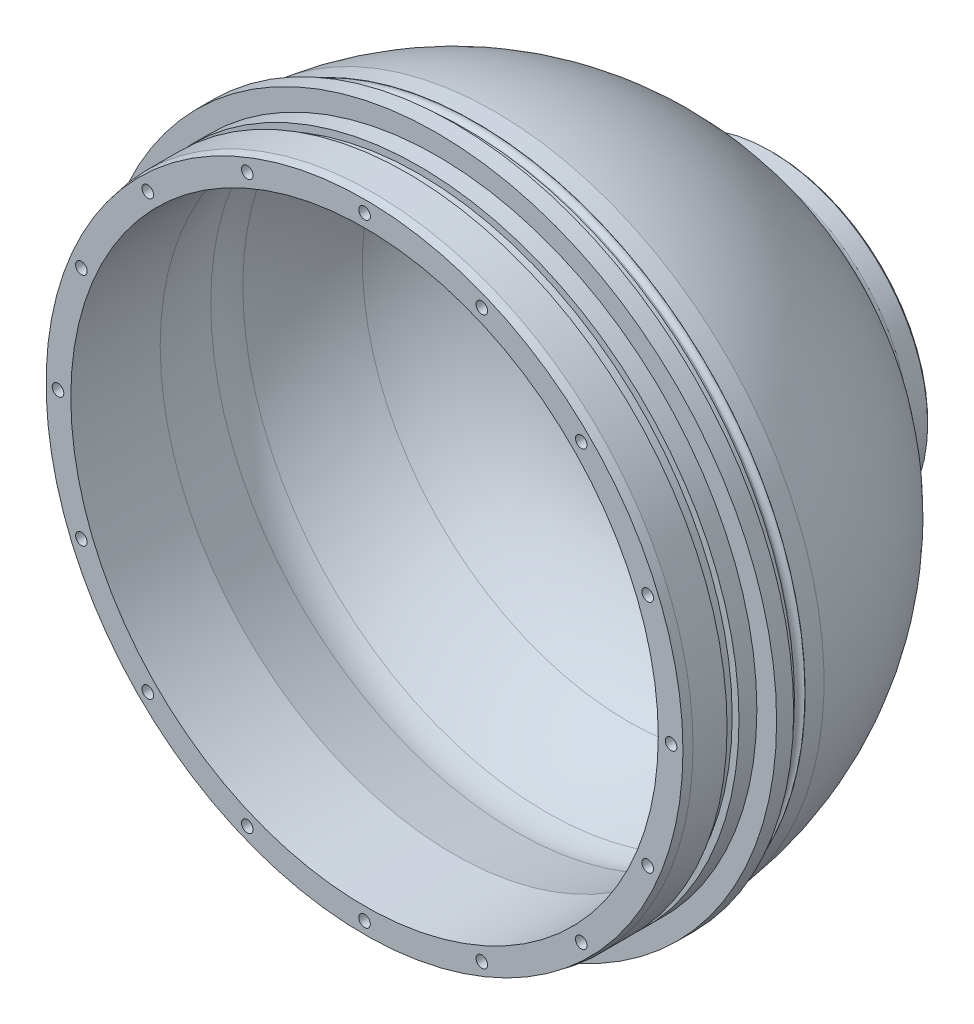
ISO-10303-21;
HEADER;
FILE_DESCRIPTION(('STEP AP214'),'2;1');
FILE_NAME('part.step','',(''),(''),'','','');
FILE_SCHEMA(('AUTOMOTIVE_DESIGN { 1 0 10303 214 1 1 1 1 }'));
ENDSEC;
DATA;
#1=APPLICATION_CONTEXT('core data for automotive mechanical design processes');
#2=APPLICATION_PROTOCOL_DEFINITION('international standard','automotive_design',2000,#1);
#3=PRODUCT_CONTEXT('',#1,'mechanical');
#4=PRODUCT('Part','Part','',(#3));
#5=PRODUCT_RELATED_PRODUCT_CATEGORY('part','',(#4));
#6=PRODUCT_DEFINITION_FORMATION('','',#4);
#7=PRODUCT_DEFINITION_CONTEXT('part definition',#1,'design');
#8=PRODUCT_DEFINITION('design','',#6,#7);
#9=PRODUCT_DEFINITION_SHAPE('','',#8);
#10=(LENGTH_UNIT() NAMED_UNIT(*) SI_UNIT(.MILLI.,.METRE.));
#11=(NAMED_UNIT(*) PLANE_ANGLE_UNIT() SI_UNIT($,.RADIAN.));
#12=(NAMED_UNIT(*) SI_UNIT($,.STERADIAN.) SOLID_ANGLE_UNIT());
#13=UNCERTAINTY_MEASURE_WITH_UNIT(LENGTH_MEASURE(1.E-05),#10,'distance_accuracy_value','');
#14=(GEOMETRIC_REPRESENTATION_CONTEXT(3) GLOBAL_UNCERTAINTY_ASSIGNED_CONTEXT((#13)) GLOBAL_UNIT_ASSIGNED_CONTEXT((#10,
#11,#12)) REPRESENTATION_CONTEXT('',''));
#15=CARTESIAN_POINT('',(0.,0.,0.));
#16=DIRECTION('',(0.,0.,1.));
#17=DIRECTION('',(1.,0.,0.));
#18=AXIS2_PLACEMENT_3D('',#15,#16,#17);
#19=CARTESIAN_POINT('',(22.86,-5.08,0.));
#20=DIRECTION('',(0.,0.,-1.));
#21=DIRECTION('',(-1.,0.,0.));
#22=AXIS2_PLACEMENT_3D('',#19,#20,#21);
#23=CYLINDRICAL_SURFACE('',#22,3.4544);
#24=CARTESIAN_POINT('',(22.86,-5.08,-121.69067229));
#25=DIRECTION('',(0.,0.,-1.));
#26=DIRECTION('',(-1.,0.,0.));
#27=AXIS2_PLACEMENT_3D('',#24,#25,#26);
#28=CIRCLE('',#27,3.4544);
#29=CARTESIAN_POINT('',(19.4056,-5.08,-121.69067229));
#30=VERTEX_POINT('',#29);
#31=EDGE_CURVE('E132',#30,#30,#28,.F.);
#32=ORIENTED_EDGE('',*,*,#31,.F.);
#33=EDGE_LOOP('',(#32));
#34=FACE_BOUND('',#33,.T.);
#35=CARTESIAN_POINT('',(22.86,-5.08,-101.70087229));
#36=DIRECTION('',(0.,0.,1.));
#37=DIRECTION('',(1.,0.,0.));
#38=AXIS2_PLACEMENT_3D('',#35,#36,#37);
#39=CIRCLE('',#38,3.4544);
#40=CARTESIAN_POINT('',(26.3144,-5.08,-101.70087229));
#41=VERTEX_POINT('',#40);
#42=EDGE_CURVE('E161',#41,#41,#39,.F.);
#43=ORIENTED_EDGE('',*,*,#42,.F.);
#44=EDGE_LOOP('',(#43));
#45=FACE_BOUND('',#44,.T.);
#46=ADVANCED_FACE('F40',(#34,#45),#23,.F.);
#47=CARTESIAN_POINT('',(0.,0.,0.));
#48=DIRECTION('',(0.,0.,-1.));
#49=DIRECTION('',(-1.,0.,0.));
#50=AXIS2_PLACEMENT_3D('',#47,#48,#49);
#51=CYLINDRICAL_SURFACE('',#50,4.953);
#52=CARTESIAN_POINT('',(0.,0.,-121.69067229));
#53=DIRECTION('',(0.,0.,-1.));
#54=DIRECTION('',(-1.,0.,0.));
#55=AXIS2_PLACEMENT_3D('',#52,#53,#54);
#56=CIRCLE('',#55,4.953);
#57=CARTESIAN_POINT('',(-4.953,0.,-121.69067229));
#58=VERTEX_POINT('',#57);
#59=EDGE_CURVE('E142',#58,#58,#56,.F.);
#60=ORIENTED_EDGE('',*,*,#59,.F.);
#61=EDGE_LOOP('',(#60));
#62=FACE_BOUND('',#61,.T.);
#63=CARTESIAN_POINT('',(0.,0.,-101.70087229));
#64=DIRECTION('',(0.,0.,1.));
#65=DIRECTION('',(1.,0.,0.));
#66=AXIS2_PLACEMENT_3D('',#63,#64,#65);
#67=CIRCLE('',#66,4.953);
#68=CARTESIAN_POINT('',(4.953,0.,-101.70087229));
#69=VERTEX_POINT('',#68);
#70=EDGE_CURVE('E157',#69,#69,#67,.F.);
#71=ORIENTED_EDGE('',*,*,#70,.F.);
#72=EDGE_LOOP('',(#71));
#73=FACE_BOUND('',#72,.T.);
#74=ADVANCED_FACE('F186',(#62,#73),#51,.F.);
#75=CARTESIAN_POINT('',(10.16,22.,0.));
#76=DIRECTION('',(0.,0.,-1.));
#77=DIRECTION('',(-1.,0.,0.));
#78=AXIS2_PLACEMENT_3D('',#75,#76,#77);
#79=CYLINDRICAL_SURFACE('',#78,6.35);
#80=CARTESIAN_POINT('',(10.16,22.,-101.95487229));
#81=DIRECTION('',(0.,0.,1.));
#82=DIRECTION('',(1.,0.,0.));
#83=AXIS2_PLACEMENT_3D('',#80,#81,#82);
#84=CIRCLE('',#83,6.35);
#85=CARTESIAN_POINT('',(16.51,22.,-101.95487229));
#86=VERTEX_POINT('',#85);
#87=EDGE_CURVE('E48',#86,#86,#84,.T.);
#88=ORIENTED_EDGE('',*,*,#87,.T.);
#89=EDGE_LOOP('',(#88));
#90=FACE_BOUND('',#89,.T.);
#91=CARTESIAN_POINT('',(10.16,22.,-116.68687229));
#92=DIRECTION('',(0.,0.,-1.));
#93=DIRECTION('',(-1.,0.,0.));
#94=AXIS2_PLACEMENT_3D('',#91,#92,#93);
#95=CIRCLE('',#94,6.35);
#96=CARTESIAN_POINT('',(3.81,22.,-116.68687229));
#97=VERTEX_POINT('',#96);
#98=EDGE_CURVE('E152',#97,#97,#95,.F.);
#99=ORIENTED_EDGE('',*,*,#98,.F.);
#100=EDGE_LOOP('',(#99));
#101=FACE_BOUND('',#100,.T.);
#102=ADVANCED_FACE('F173',(#90,#101),#79,.F.);
#103=CARTESIAN_POINT('',(18.1738473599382,-27.8569032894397,0.));
#104=DIRECTION('',(0.,0.,-1.));
#105=DIRECTION('',(-1.,0.,0.));
#106=AXIS2_PLACEMENT_3D('',#103,#104,#105);
#107=CYLINDRICAL_SURFACE('',#106,6.54812);
#108=CARTESIAN_POINT('',(18.1738473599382,-27.8569032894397,-101.44687229));
#109=DIRECTION('',(0.,0.,1.));
#110=DIRECTION('',(1.,0.,0.));
#111=AXIS2_PLACEMENT_3D('',#108,#109,#110);
#112=CIRCLE('',#111,6.54812);
#113=CARTESIAN_POINT('',(24.6876644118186,-27.1875282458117,-101.44687229));
#114=VERTEX_POINT('',#113);
#115=CARTESIAN_POINT('',(14.9368352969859,-33.548970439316,-101.44687229));
#116=VERTEX_POINT('',#115);
#117=EDGE_CURVE('E54',#114,#116,#112,.T.);
#118=ORIENTED_EDGE('',*,*,#117,.T.);
#119=CARTESIAN_POINT('',(12.6332757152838,-31.3468805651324,-101.362476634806));
#120=CARTESIAN_POINT('',(12.5352166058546,-31.1912093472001,-101.352028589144));
#121=CARTESIAN_POINT('',(12.4437733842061,-31.0314793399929,-101.340532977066));
#122=CARTESIAN_POINT('',(12.2746797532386,-30.7049713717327,-101.315451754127));
#123=CARTESIAN_POINT('',(12.1970324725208,-30.5381918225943,-101.301865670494));
#124=CARTESIAN_POINT('',(12.05604121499,-30.1987257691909,-101.272661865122));
#125=CARTESIAN_POINT('',(11.9927077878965,-30.0260350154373,-101.257042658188));
#126=CARTESIAN_POINT('',(11.8808053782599,-29.6760414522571,-101.223901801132));
#127=CARTESIAN_POINT('',(11.8322418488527,-29.4987369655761,-101.206379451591));
#128=CARTESIAN_POINT('',(11.7502656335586,-29.1410731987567,-101.169651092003));
#129=CARTESIAN_POINT('',(11.7168336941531,-28.9607181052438,-101.150447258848));
#130=CARTESIAN_POINT('',(11.6652119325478,-28.5979314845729,-101.110582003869));
#131=CARTESIAN_POINT('',(11.6470277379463,-28.415499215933,-101.089920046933));
#132=CARTESIAN_POINT('',(11.6260162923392,-28.0499798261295,-101.047469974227));
#133=CARTESIAN_POINT('',(11.6231811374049,-27.8668930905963,-101.025682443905));
#134=CARTESIAN_POINT('',(11.6328387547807,-27.5011500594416,-100.981334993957));
#135=CARTESIAN_POINT('',(11.6453372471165,-27.3184939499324,-100.958774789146));
#136=CARTESIAN_POINT('',(11.6857460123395,-26.9533241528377,-100.913116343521));
#137=CARTESIAN_POINT('',(11.7137897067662,-26.7708255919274,-100.890015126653));
#138=CARTESIAN_POINT('',(11.7851991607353,-26.4087631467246,-100.843941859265));
#139=CARTESIAN_POINT('',(11.8285706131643,-26.2292003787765,-100.820969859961));
#140=CARTESIAN_POINT('',(11.9303371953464,-25.8743504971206,-100.775690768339));
#141=CARTESIAN_POINT('',(11.988728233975,-25.69906223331,-100.753383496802));
#142=CARTESIAN_POINT('',(12.1201929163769,-25.3538513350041,-100.709963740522));
#143=CARTESIAN_POINT('',(12.1932719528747,-25.1839306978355,-100.688851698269));
#144=CARTESIAN_POINT('',(12.3539204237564,-24.8501182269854,-100.648311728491));
#145=CARTESIAN_POINT('',(12.4415403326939,-24.686249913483,-100.628890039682));
#146=CARTESIAN_POINT('',(12.6305175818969,-24.3663618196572,-100.592360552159));
#147=CARTESIAN_POINT('',(12.7318748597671,-24.2103420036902,-100.575252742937));
#148=CARTESIAN_POINT('',(12.9476325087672,-23.9073286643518,-100.543862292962));
#149=CARTESIAN_POINT('',(13.0620308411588,-23.760333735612,-100.529579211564));
#150=CARTESIAN_POINT('',(13.3030909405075,-23.4764604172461,-100.504281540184));
#151=CARTESIAN_POINT('',(13.4297527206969,-23.3395820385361,-100.493266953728));
#152=CARTESIAN_POINT('',(13.6916350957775,-23.0797757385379,-100.475059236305));
#153=CARTESIAN_POINT('',(13.8266191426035,-22.9566146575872,-100.467790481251));
#154=CARTESIAN_POINT('',(14.1065427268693,-22.7218972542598,-100.456960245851));
#155=CARTESIAN_POINT('',(14.2514856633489,-22.610344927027,-100.453400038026));
#156=CARTESIAN_POINT('',(14.5501634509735,-22.39978481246,-100.450111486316));
#157=CARTESIAN_POINT('',(14.7038939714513,-22.3007709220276,-100.450381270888));
#158=CARTESIAN_POINT('',(15.0190635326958,-22.1159404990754,-100.45473078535));
#159=CARTESIAN_POINT('',(15.1805053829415,-22.0301288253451,-100.458811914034));
#160=CARTESIAN_POINT('',(15.667588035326,-21.7968733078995,-100.47636310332));
#161=CARTESIAN_POINT('',(16.0026623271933,-21.6689306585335,-100.495079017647));
#162=CARTESIAN_POINT('',(16.688166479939,-21.4695495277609,-100.544486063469));
#163=CARTESIAN_POINT('',(17.0385978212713,-21.398116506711,-100.575178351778));
#164=CARTESIAN_POINT('',(17.7500958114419,-21.3125736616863,-100.645554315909));
#165=CARTESIAN_POINT('',(18.1112410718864,-21.2992055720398,-100.68534753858));
#166=CARTESIAN_POINT('',(18.8302803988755,-21.3318309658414,-100.769634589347));
#167=CARTESIAN_POINT('',(19.1881740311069,-21.3778322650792,-100.814129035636));
#168=CARTESIAN_POINT('',(19.9004941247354,-21.5297785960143,-100.904977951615));
#169=CARTESIAN_POINT('',(20.25459958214,-21.6372219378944,-100.95135092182));
#170=CARTESIAN_POINT('',(20.9400355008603,-21.9102922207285,-101.041111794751));
#171=CARTESIAN_POINT('',(21.2713654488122,-22.0759204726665,-101.084499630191));
#172=CARTESIAN_POINT('',(21.9032473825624,-22.4618092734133,-101.165589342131));
#173=CARTESIAN_POINT('',(22.203666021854,-22.6822935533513,-101.20326689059));
#174=CARTESIAN_POINT('',(22.7632828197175,-23.1714947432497,-101.270834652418));
#175=CARTESIAN_POINT('',(23.0224836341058,-23.4402085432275,-101.3007253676));
#176=CARTESIAN_POINT('',(23.489049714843,-24.0147902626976,-101.351589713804));
#177=CARTESIAN_POINT('',(23.6969937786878,-24.320179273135,-101.372664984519));
#178=CARTESIAN_POINT('',(24.0587800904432,-24.9618909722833,-101.406533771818));
#179=CARTESIAN_POINT('',(24.2126245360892,-25.2982124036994,-101.419327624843));
#180=CARTESIAN_POINT('',(24.4606918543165,-25.9894717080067,-101.437450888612));
#181=CARTESIAN_POINT('',(24.5553558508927,-26.3442499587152,-101.442835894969));
#182=CARTESIAN_POINT('',(24.6841570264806,-27.0646647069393,-101.447723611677));
#183=CARTESIAN_POINT('',(24.7182937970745,-27.4303012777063,-101.447226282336));
#184=CARTESIAN_POINT('',(24.725083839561,-28.162710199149,-101.442063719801));
#185=CARTESIAN_POINT('',(24.6976360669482,-28.5294834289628,-101.437391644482));
#186=CARTESIAN_POINT('',(24.581842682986,-29.2532513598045,-101.42571134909));
#187=CARTESIAN_POINT('',(24.4934957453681,-29.6102458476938,-101.418703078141));
#188=CARTESIAN_POINT('',(24.2579372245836,-30.3057960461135,-101.404093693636));
#189=CARTESIAN_POINT('',(24.1104978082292,-30.6442745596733,-101.396490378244));
#190=CARTESIAN_POINT('',(23.7609036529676,-31.2917249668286,-101.382279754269));
#191=CARTESIAN_POINT('',(23.5587487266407,-31.6006967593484,-101.375672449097));
#192=CARTESIAN_POINT('',(23.1053012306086,-32.1805949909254,-101.364655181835));
#193=CARTESIAN_POINT('',(22.8539673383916,-32.4514891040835,-101.360247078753));
#194=CARTESIAN_POINT('',(22.3091765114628,-32.947324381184,-101.354396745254));
#195=CARTESIAN_POINT('',(22.0157198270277,-33.1722658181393,-101.352954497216));
#196=CARTESIAN_POINT('',(21.5508643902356,-33.4700690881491,-101.353183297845));
#197=CARTESIAN_POINT('',(21.3918116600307,-33.5627307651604,-101.353658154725));
#198=CARTESIAN_POINT('',(21.0664947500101,-33.7343364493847,-101.355376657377));
#199=CARTESIAN_POINT('',(20.9002332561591,-33.8132855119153,-101.356620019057));
#200=CARTESIAN_POINT('',(20.5616106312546,-33.9569293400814,-101.359825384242));
#201=CARTESIAN_POINT('',(20.3892472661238,-34.0216188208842,-101.361787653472));
#202=CARTESIAN_POINT('',(20.0397564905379,-34.1362392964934,-101.366344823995));
#203=CARTESIAN_POINT('',(19.8626308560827,-34.1861757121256,-101.368939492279));
#204=CARTESIAN_POINT('',(19.5047488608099,-34.2709822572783,-101.374648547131));
#205=CARTESIAN_POINT('',(19.3239911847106,-34.3058468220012,-101.377763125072));
#206=CARTESIAN_POINT('',(18.9602565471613,-34.3602284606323,-101.384367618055));
#207=CARTESIAN_POINT('',(18.7772804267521,-34.379751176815,-101.387857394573));
#208=CARTESIAN_POINT('',(18.4102746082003,-34.4033375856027,-101.395047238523));
#209=CARTESIAN_POINT('',(18.2262445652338,-34.4073958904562,-101.398747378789));
#210=CARTESIAN_POINT('',(17.8585640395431,-34.4000119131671,-101.406166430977));
#211=CARTESIAN_POINT('',(17.674913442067,-34.3885753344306,-101.409885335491));
#212=CARTESIAN_POINT('',(17.3089472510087,-34.3502632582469,-101.417142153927));
#213=CARTESIAN_POINT('',(17.1266340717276,-34.3233646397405,-101.42067978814));
#214=CARTESIAN_POINT('',(16.7649820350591,-34.2543130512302,-101.427345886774));
#215=CARTESIAN_POINT('',(16.5856421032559,-34.2121657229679,-101.430474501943));
#216=CARTESIAN_POINT('',(16.23103792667,-34.1128833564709,-101.436096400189));
#217=CARTESIAN_POINT('',(16.0557760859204,-34.055739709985,-101.438589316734));
#218=CARTESIAN_POINT('',(15.7107473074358,-33.9269042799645,-101.442703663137));
#219=CARTESIAN_POINT('',(15.5409783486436,-33.8552179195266,-101.444325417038));
#220=CARTESIAN_POINT('',(15.208079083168,-33.6977931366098,-101.446468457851));
#221=CARTESIAN_POINT('',(15.0449487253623,-33.6120548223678,-101.446989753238));
#222=CARTESIAN_POINT('',(14.7265520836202,-33.4271734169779,-101.446710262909));
#223=CARTESIAN_POINT('',(14.5712829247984,-33.3280352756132,-101.445909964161));
#224=CARTESIAN_POINT('',(14.2697654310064,-33.1171161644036,-101.442782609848));
#225=CARTESIAN_POINT('',(14.1235104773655,-33.0053446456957,-101.440456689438));
#226=CARTESIAN_POINT('',(13.8409891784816,-32.7699500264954,-101.434096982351));
#227=CARTESIAN_POINT('',(13.7047205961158,-32.646329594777,-101.430063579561));
#228=CARTESIAN_POINT('',(13.3953340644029,-32.3409408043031,-101.418317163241));
#229=CARTESIAN_POINT('',(13.226907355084,-32.1544110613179,-101.409798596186));
#230=CARTESIAN_POINT('',(12.9126550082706,-31.7633906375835,-101.388993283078));
#231=CARTESIAN_POINT('',(12.7668292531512,-31.5589000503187,-101.376706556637));
#232=CARTESIAN_POINT('',(12.6332757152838,-31.3468805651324,-101.362476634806));
#233=B_SPLINE_CURVE_WITH_KNOTS('',3,(#119,#120,#121,#122,#123,#124,#125,#126,#127,#128,#129,
#130,#131,#132,#133,#134,#135,#136,#137,#138,#139,#140,#141,#142,#143,#144,#145,#146,#147,#148,
#149,#150,#151,#152,#153,#154,#155,#156,#157,#158,#159,#160,#161,#162,#163,#164,#165,#166,#167,
#168,#169,#170,#171,#172,#173,#174,#175,#176,#177,#178,#179,#180,#181,#182,#183,#184,#185,#186,
#187,#188,#189,#190,#191,#192,#193,#194,#195,#196,#197,#198,#199,#200,#201,#202,#203,#204,#205,
#206,#207,#208,#209,#210,#211,#212,#213,#214,#215,#216,#217,#218,#219,#220,#221,#222,#223,#224,
#225,#226,#227,#228,#229,#230,#231,#232),.UNSPECIFIED.,.T.,.F.,(4,2,2,2,2,2,2,2,2,2,2,2,2,2,2,2,
2,2,2,2,2,2,2,2,2,2,2,2,2,2,2,2,2,2,2,2,2,2,2,2,2,2,2,2,2,2,2,2,2,2,2,2,2,2,2,2,4),(0.,
0.552611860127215,1.10534888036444,1.65849196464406,2.21183902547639,2.76448001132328,
3.3173248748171,3.86988502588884,4.4226513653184,4.98023714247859,5.53803023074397,
6.09567154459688,6.65351797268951,7.21334294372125,7.77316537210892,8.33290040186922,
8.8926360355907,9.44057872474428,9.98870936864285,10.5365721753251,11.0846361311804,
12.1566233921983,13.228714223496,14.3144606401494,15.4003500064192,16.5139230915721,
17.6275212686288,18.7457379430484,19.863882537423,20.9687540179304,22.0735806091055,
23.1700705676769,24.2665679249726,25.3648656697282,26.4631873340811,27.5657849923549,
28.6683864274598,29.7719183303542,30.8754436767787,31.4271367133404,31.9786259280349,
32.5303191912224,33.0818094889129,33.6335032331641,34.1849939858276,34.7366768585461,
35.2881567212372,35.8404633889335,36.3925659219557,36.9449860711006,37.4972005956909,
38.0494108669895,38.6014177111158,39.1530142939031,39.7044869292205,40.457131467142,
41.2097720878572),.UNSPECIFIED.);
#234=EDGE_CURVE('E56',#114,#116,#233,.T.);
#235=ORIENTED_EDGE('',*,*,#234,.F.);
#236=EDGE_LOOP('',(#118,#235));
#237=FACE_BOUND('',#236,.T.);
#238=CARTESIAN_POINT('',(18.1738473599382,-27.8569032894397,-121.69067229));
#239=DIRECTION('',(0.,0.,-1.));
#240=DIRECTION('',(-1.,0.,0.));
#241=AXIS2_PLACEMENT_3D('',#238,#239,#240);
#242=CIRCLE('',#241,6.54812);
#243=CARTESIAN_POINT('',(11.6257273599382,-27.8569032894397,-121.69067229));
#244=VERTEX_POINT('',#243);
#245=EDGE_CURVE('E147',#244,#244,#242,.F.);
#246=ORIENTED_EDGE('',*,*,#245,.F.);
#247=EDGE_LOOP('',(#246));
#248=FACE_BOUND('',#247,.T.);
#249=ADVANCED_FACE('F57',(#237,#248),#107,.F.);
#250=CARTESIAN_POINT('',(29.21,16.002,0.));
#251=DIRECTION('',(0.,0.,-1.));
#252=DIRECTION('',(-1.,0.,0.));
#253=AXIS2_PLACEMENT_3D('',#250,#251,#252);
#254=CYLINDRICAL_SURFACE('',#253,2.7051);
#255=CARTESIAN_POINT('',(29.21,16.002,-101.44687229));
#256=DIRECTION('',(0.,0.,1.));
#257=DIRECTION('',(1.,0.,0.));
#258=AXIS2_PLACEMENT_3D('',#255,#256,#257);
#259=CIRCLE('',#258,2.7051);
#260=CARTESIAN_POINT('',(31.9151,16.002,-101.44687229));
#261=VERTEX_POINT('',#260);
#262=EDGE_CURVE('E1163',#261,#261,#259,.T.);
#263=ORIENTED_EDGE('',*,*,#262,.T.);
#264=EDGE_LOOP('',(#263));
#265=FACE_BOUND('',#264,.T.);
#266=CARTESIAN_POINT('',(29.21,16.002,-121.69067229));
#267=DIRECTION('',(0.,0.,-1.));
#268=DIRECTION('',(-1.,0.,0.));
#269=AXIS2_PLACEMENT_3D('',#266,#267,#268);
#270=CIRCLE('',#269,2.7051);
#271=CARTESIAN_POINT('',(26.5049,16.002,-121.69067229));
#272=VERTEX_POINT('',#271);
#273=EDGE_CURVE('E137',#272,#272,#270,.F.);
#274=ORIENTED_EDGE('',*,*,#273,.F.);
#275=EDGE_LOOP('',(#274));
#276=FACE_BOUND('',#275,.T.);
#277=ADVANCED_FACE('F205',(#265,#276),#254,.F.);
#278=CARTESIAN_POINT('',(-8.89,-27.94,0.));
#279=DIRECTION('',(0.,0.,-1.));
#280=DIRECTION('',(-1.,0.,0.));
#281=AXIS2_PLACEMENT_3D('',#278,#279,#280);
#282=CYLINDRICAL_SURFACE('',#281,5.75310000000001);
#283=CARTESIAN_POINT('',(-8.89,-27.94,-101.44687229));
#284=DIRECTION('',(0.,0.,1.));
#285=DIRECTION('',(1.,0.,0.));
#286=AXIS2_PLACEMENT_3D('',#283,#284,#285);
#287=CIRCLE('',#286,5.75310000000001);
#288=CARTESIAN_POINT('',(-3.1369,-27.94,-101.44687229));
#289=VERTEX_POINT('',#288);
#290=EDGE_CURVE('E1156',#289,#289,#287,.T.);
#291=ORIENTED_EDGE('',*,*,#290,.T.);
#292=EDGE_LOOP('',(#291));
#293=FACE_BOUND('',#292,.T.);
#294=CARTESIAN_POINT('',(-8.89,-27.94,-121.69067229));
#295=DIRECTION('',(0.,0.,-1.));
#296=DIRECTION('',(-1.,0.,0.));
#297=AXIS2_PLACEMENT_3D('',#294,#295,#296);
#298=CIRCLE('',#297,5.75310000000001);
#299=CARTESIAN_POINT('',(-14.6431,-27.94,-121.69067229));
#300=VERTEX_POINT('',#299);
#301=EDGE_CURVE('E127',#300,#300,#298,.F.);
#302=ORIENTED_EDGE('',*,*,#301,.F.);
#303=EDGE_LOOP('',(#302));
#304=FACE_BOUND('',#303,.T.);
#305=ADVANCED_FACE('F198',(#293,#304),#282,.F.);
#306=CARTESIAN_POINT('',(-29.21,-16.002,0.));
#307=DIRECTION('',(0.,0.,-1.));
#308=DIRECTION('',(-1.,0.,0.));
#309=AXIS2_PLACEMENT_3D('',#306,#307,#308);
#310=CYLINDRICAL_SURFACE('',#309,2.70509999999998);
#311=CARTESIAN_POINT('',(-29.21,-16.002,-101.44687229));
#312=DIRECTION('',(0.,0.,1.));
#313=DIRECTION('',(1.,0.,0.));
#314=AXIS2_PLACEMENT_3D('',#311,#312,#313);
#315=CIRCLE('',#314,2.70509999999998);
#316=CARTESIAN_POINT('',(-26.5049,-16.002,-101.44687229));
#317=VERTEX_POINT('',#316);
#318=EDGE_CURVE('E1160',#317,#317,#315,.T.);
#319=ORIENTED_EDGE('',*,*,#318,.T.);
#320=EDGE_LOOP('',(#319));
#321=FACE_BOUND('',#320,.T.);
#322=CARTESIAN_POINT('',(-29.21,-16.002,-121.69067229));
#323=DIRECTION('',(0.,0.,-1.));
#324=DIRECTION('',(-1.,0.,0.));
#325=AXIS2_PLACEMENT_3D('',#322,#323,#324);
#326=CIRCLE('',#325,2.70509999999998);
#327=CARTESIAN_POINT('',(-31.9151,-16.002,-121.69067229));
#328=VERTEX_POINT('',#327);
#329=EDGE_CURVE('E122',#328,#328,#326,.F.);
#330=ORIENTED_EDGE('',*,*,#329,.F.);
#331=EDGE_LOOP('',(#330));
#332=FACE_BOUND('',#331,.T.);
#333=ADVANCED_FACE('F200',(#321,#332),#310,.F.);
#334=CARTESIAN_POINT('',(-29.21,16.002,0.));
#335=DIRECTION('',(0.,0.,-1.));
#336=DIRECTION('',(-1.,0.,0.));
#337=AXIS2_PLACEMENT_3D('',#334,#335,#336);
#338=CYLINDRICAL_SURFACE('',#337,2.7051);
#339=CARTESIAN_POINT('',(-29.21,16.002,-101.44687229));
#340=DIRECTION('',(0.,0.,1.));
#341=DIRECTION('',(1.,0.,0.));
#342=AXIS2_PLACEMENT_3D('',#339,#340,#341);
#343=CIRCLE('',#342,2.7051);
#344=CARTESIAN_POINT('',(-26.5049,16.002,-101.44687229));
#345=VERTEX_POINT('',#344);
#346=EDGE_CURVE('E1168',#345,#345,#343,.T.);
#347=ORIENTED_EDGE('',*,*,#346,.T.);
#348=EDGE_LOOP('',(#347));
#349=FACE_BOUND('',#348,.T.);
#350=CARTESIAN_POINT('',(-29.21,16.002,-121.69067229));
#351=DIRECTION('',(0.,0.,-1.));
#352=DIRECTION('',(-1.,0.,0.));
#353=AXIS2_PLACEMENT_3D('',#350,#351,#352);
#354=CIRCLE('',#353,2.7051);
#355=CARTESIAN_POINT('',(-31.9151,16.002,-121.69067229));
#356=VERTEX_POINT('',#355);
#357=EDGE_CURVE('E117',#356,#356,#354,.F.);
#358=ORIENTED_EDGE('',*,*,#357,.F.);
#359=EDGE_LOOP('',(#358));
#360=FACE_BOUND('',#359,.T.);
#361=ADVANCED_FACE('F203',(#349,#360),#338,.F.);
#362=CARTESIAN_POINT('',(-12.7,27.94,0.));
#363=DIRECTION('',(0.,0.,-1.));
#364=DIRECTION('',(-1.,0.,0.));
#365=AXIS2_PLACEMENT_3D('',#362,#363,#364);
#366=CYLINDRICAL_SURFACE('',#365,5.75310000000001);
#367=CARTESIAN_POINT('',(-12.7,27.94,-101.44687229));
#368=DIRECTION('',(0.,0.,1.));
#369=DIRECTION('',(1.,0.,0.));
#370=AXIS2_PLACEMENT_3D('',#367,#368,#369);
#371=CIRCLE('',#370,5.75310000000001);
#372=CARTESIAN_POINT('',(-6.94689999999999,27.94,-101.44687229));
#373=VERTEX_POINT('',#372);
#374=EDGE_CURVE('E68',#373,#373,#371,.T.);
#375=ORIENTED_EDGE('',*,*,#374,.T.);
#376=EDGE_LOOP('',(#375));
#377=FACE_BOUND('',#376,.T.);
#378=CARTESIAN_POINT('',(-12.7,27.94,-121.69067229));
#379=DIRECTION('',(0.,0.,-1.));
#380=DIRECTION('',(-1.,0.,0.));
#381=AXIS2_PLACEMENT_3D('',#378,#379,#380);
#382=CIRCLE('',#381,5.75310000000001);
#383=CARTESIAN_POINT('',(-18.4531,27.94,-121.69067229));
#384=VERTEX_POINT('',#383);
#385=EDGE_CURVE('E62',#384,#384,#382,.F.);
#386=ORIENTED_EDGE('',*,*,#385,.F.);
#387=EDGE_LOOP('',(#386));
#388=FACE_BOUND('',#387,.T.);
#389=ADVANCED_FACE('F210',(#377,#388),#366,.F.);
#390=CARTESIAN_POINT('',(0.,0.,0.));
#391=DIRECTION('',(0.,0.,1.));
#392=DIRECTION('',(1.,0.,0.));
#393=AXIS2_PLACEMENT_3D('',#390,#391,#392);
#394=CYLINDRICAL_SURFACE('',#393,98.298);
#395=CARTESIAN_POINT('',(0.,0.,-26.67));
#396=DIRECTION('',(0.,0.,1.));
#397=DIRECTION('',(1.,0.,0.));
#398=AXIS2_PLACEMENT_3D('',#395,#396,#397);
#399=CIRCLE('',#398,98.298);
#400=CARTESIAN_POINT('',(98.298,0.,-26.67));
#401=VERTEX_POINT('',#400);
#402=EDGE_CURVE('E564',#401,#401,#399,.T.);
#403=ORIENTED_EDGE('',*,*,#402,.F.);
#404=EDGE_LOOP('',(#403));
#405=FACE_BOUND('',#404,.T.);
#406=CARTESIAN_POINT('',(0.,0.,-29.972));
#407=DIRECTION('',(0.,0.,-1.));
#408=DIRECTION('',(-1.,0.,0.));
#409=AXIS2_PLACEMENT_3D('',#406,#407,#408);
#410=CIRCLE('',#409,98.298);
#411=CARTESIAN_POINT('',(-98.298,0.,-29.972));
#412=VERTEX_POINT('',#411);
#413=EDGE_CURVE('E88',#412,#412,#410,.F.);
#414=ORIENTED_EDGE('',*,*,#413,.T.);
#415=EDGE_LOOP('',(#414));
#416=FACE_BOUND('',#415,.T.);
#417=ADVANCED_FACE('F390',(#405,#416),#394,.T.);
#418=CARTESIAN_POINT('',(0.,0.,-21.59));
#419=DIRECTION('',(0.,0.,1.));
#420=DIRECTION('',(1.,0.,0.));
#421=AXIS2_PLACEMENT_3D('',#418,#419,#420);
#422=CYLINDRICAL_SURFACE('',#421,95.4532);
#423=CARTESIAN_POINT('',(0.,0.,-21.59));
#424=DIRECTION('',(0.,0.,1.));
#425=DIRECTION('',(1.,0.,0.));
#426=AXIS2_PLACEMENT_3D('',#423,#424,#425);
#427=CIRCLE('',#426,95.4532);
#428=CARTESIAN_POINT('',(95.4532,0.,-21.59));
#429=VERTEX_POINT('',#428);
#430=EDGE_CURVE('E582',#429,#429,#427,.T.);
#431=ORIENTED_EDGE('',*,*,#430,.T.);
#432=EDGE_LOOP('',(#431));
#433=FACE_BOUND('',#432,.T.);
#434=CARTESIAN_POINT('',(0.,0.,-16.256));
#435=DIRECTION('',(0.,0.,1.));
#436=DIRECTION('',(1.,0.,0.));
#437=AXIS2_PLACEMENT_3D('',#434,#435,#436);
#438=CIRCLE('',#437,95.4532);
#439=CARTESIAN_POINT('',(95.4532,0.,-16.256));
#440=VERTEX_POINT('',#439);
#441=EDGE_CURVE('E586',#440,#440,#438,.F.);
#442=ORIENTED_EDGE('',*,*,#441,.T.);
#443=EDGE_LOOP('',(#442));
#444=FACE_BOUND('',#443,.T.);
#445=ADVANCED_FACE('F395',(#433,#444),#422,.T.);
#446=CARTESIAN_POINT('',(0.,0.,0.));
#447=DIRECTION('',(0.,0.,1.));
#448=DIRECTION('',(1.,0.,0.));
#449=AXIS2_PLACEMENT_3D('',#446,#447,#448);
#450=CYLINDRICAL_SURFACE('',#449,101.346);
#451=CARTESIAN_POINT('',(0.,0.,-26.67));
#452=DIRECTION('',(0.,0.,1.));
#453=DIRECTION('',(1.,0.,0.));
#454=AXIS2_PLACEMENT_3D('',#451,#452,#453);
#455=CIRCLE('',#454,101.346);
#456=CARTESIAN_POINT('',(101.346,0.,-26.67));
#457=VERTEX_POINT('',#456);
#458=EDGE_CURVE('E568',#457,#457,#455,.T.);
#459=ORIENTED_EDGE('',*,*,#458,.T.);
#460=EDGE_LOOP('',(#459));
#461=FACE_BOUND('',#460,.T.);
#462=CARTESIAN_POINT('',(0.,0.,-21.59));
#463=DIRECTION('',(0.,0.,1.));
#464=DIRECTION('',(1.,0.,0.));
#465=AXIS2_PLACEMENT_3D('',#462,#463,#464);
#466=CIRCLE('',#465,101.346);
#467=CARTESIAN_POINT('',(101.346,0.,-21.59));
#468=VERTEX_POINT('',#467);
#469=EDGE_CURVE('E571',#468,#468,#466,.F.);
#470=ORIENTED_EDGE('',*,*,#469,.T.);
#471=EDGE_LOOP('',(#470));
#472=FACE_BOUND('',#471,.T.);
#473=ADVANCED_FACE('F637',(#461,#472),#450,.T.);
#474=CARTESIAN_POINT('',(0.,-101.346,-26.67));
#475=DIRECTION('',(0.,0.,-1.));
#476=DIRECTION('',(-1.,0.,0.));
#477=AXIS2_PLACEMENT_3D('',#474,#475,#476);
#478=PLANE('',#477);
#479=ORIENTED_EDGE('',*,*,#402,.T.);
#480=EDGE_LOOP('',(#479));
#481=FACE_BOUND('',#480,.T.);
#482=ORIENTED_EDGE('',*,*,#458,.F.);
#483=EDGE_LOOP('',(#482));
#484=FACE_BOUND('',#483,.T.);
#485=ADVANCED_FACE('F628',(#481,#484),#478,.T.);
#486=CARTESIAN_POINT('',(0.,0.,-21.59));
#487=DIRECTION('',(0.,0.,1.));
#488=DIRECTION('',(1.,0.,0.));
#489=AXIS2_PLACEMENT_3D('',#486,#487,#488);
#490=PLANE('',#489);
#491=ORIENTED_EDGE('',*,*,#469,.F.);
#492=EDGE_LOOP('',(#491));
#493=FACE_BOUND('',#492,.T.);
#494=ORIENTED_EDGE('',*,*,#430,.F.);
#495=EDGE_LOOP('',(#494));
#496=FACE_BOUND('',#495,.T.);
#497=ADVANCED_FACE('F626',(#493,#496),#490,.T.);
#498=CARTESIAN_POINT('',(0.,0.,-16.256));
#499=DIRECTION('',(0.,0.,1.));
#500=DIRECTION('',(1.,0.,0.));
#501=AXIS2_PLACEMENT_3D('',#498,#499,#500);
#502=PLANE('',#501);
#503=ORIENTED_EDGE('',*,*,#441,.F.);
#504=EDGE_LOOP('',(#503));
#505=FACE_BOUND('',#504,.T.);
#506=CARTESIAN_POINT('',(0.,0.,-16.256));
#507=DIRECTION('',(0.,0.,1.));
#508=DIRECTION('',(1.,0.,0.));
#509=AXIS2_PLACEMENT_3D('',#506,#507,#508);
#510=CIRCLE('',#509,93.4212);
#511=CARTESIAN_POINT('',(93.4212,0.,-16.256));
#512=VERTEX_POINT('',#511);
#513=EDGE_CURVE('E587',#512,#512,#510,.T.);
#514=ORIENTED_EDGE('',*,*,#513,.F.);
#515=EDGE_LOOP('',(#514));
#516=FACE_BOUND('',#515,.T.);
#517=ADVANCED_FACE('F611',(#505,#516),#502,.T.);
#518=CARTESIAN_POINT('',(0.,0.,-12.7));
#519=DIRECTION('',(0.,0.,1.));
#520=DIRECTION('',(1.,0.,0.));
#521=AXIS2_PLACEMENT_3D('',#518,#519,#520);
#522=PLANE('',#521);
#523=CARTESIAN_POINT('',(0.,0.,-12.7));
#524=DIRECTION('',(0.,0.,1.));
#525=DIRECTION('',(1.,0.,0.));
#526=AXIS2_PLACEMENT_3D('',#523,#524,#525);
#527=CIRCLE('',#526,95.4532);
#528=CARTESIAN_POINT('',(95.4532,0.,-12.7));
#529=VERTEX_POINT('',#528);
#530=EDGE_CURVE('E583',#529,#529,#527,.F.);
#531=ORIENTED_EDGE('',*,*,#530,.T.);
#532=EDGE_LOOP('',(#531));
#533=FACE_BOUND('',#532,.T.);
#534=CARTESIAN_POINT('',(0.,0.,-12.7));
#535=DIRECTION('',(0.,0.,1.));
#536=DIRECTION('',(1.,0.,0.));
#537=AXIS2_PLACEMENT_3D('',#534,#535,#536);
#538=CIRCLE('',#537,93.4212);
#539=CARTESIAN_POINT('',(93.4212,0.,-12.7));
#540=VERTEX_POINT('',#539);
#541=EDGE_CURVE('E95',#540,#540,#538,.T.);
#542=ORIENTED_EDGE('',*,*,#541,.T.);
#543=EDGE_LOOP('',(#542));
#544=FACE_BOUND('',#543,.T.);
#545=ADVANCED_FACE('F607',(#533,#544),#522,.F.);
#546=CARTESIAN_POINT('',(0.,0.,-16.256));
#547=DIRECTION('',(0.,0.,1.));
#548=DIRECTION('',(1.,0.,0.));
#549=AXIS2_PLACEMENT_3D('',#546,#547,#548);
#550=CYLINDRICAL_SURFACE('',#549,93.4212);
#551=ORIENTED_EDGE('',*,*,#513,.T.);
#552=EDGE_LOOP('',(#551));
#553=FACE_BOUND('',#552,.T.);
#554=ORIENTED_EDGE('',*,*,#541,.F.);
#555=EDGE_LOOP('',(#554));
#556=FACE_BOUND('',#555,.T.);
#557=ADVANCED_FACE('F610',(#553,#556),#550,.T.);
#558=CARTESIAN_POINT('',(0.,0.,-101.44687229));
#559=DIRECTION('',(0.,0.,1.));
#560=DIRECTION('',(1.,0.,0.));
#561=AXIS2_PLACEMENT_3D('',#558,#559,#560);
#562=PLANE('',#561);
#563=CARTESIAN_POINT('',(10.16,22.,-101.44687229));
#564=DIRECTION('',(0.,0.,1.));
#565=DIRECTION('',(1.,0.,0.));
#566=AXIS2_PLACEMENT_3D('',#563,#564,#565);
#567=CIRCLE('',#566,6.64329393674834);
#568=CARTESIAN_POINT('',(16.8032939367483,22.,-101.44687229));
#569=VERTEX_POINT('',#568);
#570=EDGE_CURVE('E12',#569,#569,#567,.F.);
#571=ORIENTED_EDGE('',*,*,#570,.T.);
#572=EDGE_LOOP('',(#571));
#573=FACE_BOUND('',#572,.T.);
#574=CARTESIAN_POINT('',(22.86,-5.08,-101.44687229));
#575=DIRECTION('',(0.,0.,1.));
#576=DIRECTION('',(1.,0.,0.));
#577=AXIS2_PLACEMENT_3D('',#574,#575,#576);
#578=CIRCLE('',#577,9.525);
#579=CARTESIAN_POINT('',(32.385,-5.08,-101.44687229));
#580=VERTEX_POINT('',#579);
#581=EDGE_CURVE('E497',#580,#580,#578,.T.);
#582=ORIENTED_EDGE('',*,*,#581,.F.);
#583=EDGE_LOOP('',(#582));
#584=FACE_BOUND('',#583,.T.);
#585=CARTESIAN_POINT('',(0.,0.,-101.44687229));
#586=DIRECTION('',(0.,0.,1.));
#587=DIRECTION('',(1.,0.,0.));
#588=AXIS2_PLACEMENT_3D('',#585,#586,#587);
#589=CIRCLE('',#588,9.525);
#590=CARTESIAN_POINT('',(9.525,0.,-101.44687229));
#591=VERTEX_POINT('',#590);
#592=EDGE_CURVE('E164',#591,#591,#589,.T.);
#593=ORIENTED_EDGE('',*,*,#592,.F.);
#594=EDGE_LOOP('',(#593));
#595=FACE_BOUND('',#594,.T.);
#596=ORIENTED_EDGE('',*,*,#117,.F.);
#597=CARTESIAN_POINT('',(0.,0.,-101.44687229));
#598=DIRECTION('',(0.,0.,1.));
#599=DIRECTION('',(1.,0.,0.));
#600=AXIS2_PLACEMENT_3D('',#597,#598,#599);
#601=CIRCLE('',#600,36.7238678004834);
#602=EDGE_CURVE('E67',#114,#116,#601,.T.);
#603=ORIENTED_EDGE('',*,*,#602,.T.);
#604=EDGE_LOOP('',(#596,#603));
#605=FACE_BOUND('',#604,.T.);
#606=ORIENTED_EDGE('',*,*,#374,.F.);
#607=EDGE_LOOP('',(#606));
#608=FACE_BOUND('',#607,.T.);
#609=ORIENTED_EDGE('',*,*,#290,.F.);
#610=EDGE_LOOP('',(#609));
#611=FACE_BOUND('',#610,.T.);
#612=ORIENTED_EDGE('',*,*,#318,.F.);
#613=EDGE_LOOP('',(#612));
#614=FACE_BOUND('',#613,.T.);
#615=ORIENTED_EDGE('',*,*,#262,.F.);
#616=EDGE_LOOP('',(#615));
#617=FACE_BOUND('',#616,.T.);
#618=ORIENTED_EDGE('',*,*,#346,.F.);
#619=EDGE_LOOP('',(#618));
#620=FACE_BOUND('',#619,.T.);
#621=ADVANCED_FACE('F65',(#573,#584,#595,#605,#608,#611,#614,#617,#620),#562,.T.);
#622=CARTESIAN_POINT('',(0.,0.,-26.5168723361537));
#623=DIRECTION('',(0.,0.,1.));
#624=DIRECTION('',(0.,-1.,0.));
#625=AXIS2_PLACEMENT_3D('',#622,#623,#624);
#626=SPHERICAL_SURFACE('',#625,94.742);
#627=CARTESIAN_POINT('',(0.,0.,-54.2811244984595));
#628=DIRECTION('',(0.,0.,1.));
#629=DIRECTION('',(1.,0.,0.));
#630=AXIS2_PLACEMENT_3D('',#627,#628,#629);
#631=CIRCLE('',#630,90.5825196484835);
#632=CARTESIAN_POINT('',(0.,-90.5825196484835,-54.2811244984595));
#633=VERTEX_POINT('',#632);
#634=EDGE_CURVE('E75',#633,#633,#631,.T.);
#635=CARTESIAN_POINT('',(0.,0.,-78.5428259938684));
#636=DIRECTION('',(0.,0.,1.));
#637=DIRECTION('',(1.,0.,0.));
#638=AXIS2_PLACEMENT_3D('',#635,#636,#637);
#639=CIRCLE('',#638,79.1792062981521);
#640=CARTESIAN_POINT('',(0.,-79.1792062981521,-78.5428259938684));
#641=VERTEX_POINT('',#640);
#642=EDGE_CURVE('E71',#641,#641,#639,.F.);
#643=CARTESIAN_POINT('',(0.,-90.5825196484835,-54.2811244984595));
#644=CARTESIAN_POINT('',(0.,-90.5004098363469,-54.5490127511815));
#645=CARTESIAN_POINT('',(0.,-90.4171115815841,-54.8165367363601));
#646=CARTESIAN_POINT('',(0.,-90.2481448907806,-55.3508351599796));
#647=CARTESIAN_POINT('',(0.,-90.16247645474,-55.6176095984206));
#648=CARTESIAN_POINT('',(0.,-89.9887761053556,-56.1503879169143));
#649=CARTESIAN_POINT('',(0.,-89.9007441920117,-56.416391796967));
#650=CARTESIAN_POINT('',(0.,-89.7223238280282,-56.9476080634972));
#651=CARTESIAN_POINT('',(0.,-89.6319353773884,-57.2128204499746));
#652=CARTESIAN_POINT('',(0.,-89.44880905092,-57.7424328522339));
#653=CARTESIAN_POINT('',(0.,-89.3560711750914,-58.0068328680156));
#654=CARTESIAN_POINT('',(0.,-89.168253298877,-58.5347997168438));
#655=CARTESIAN_POINT('',(0.,-89.0731732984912,-58.7983665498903));
#656=CARTESIAN_POINT('',(0.,-88.8806786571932,-59.3246462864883));
#657=CARTESIAN_POINT('',(0.,-88.7832640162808,-59.5873591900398));
#658=CARTESIAN_POINT('',(0.,-88.5861077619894,-60.1119103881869));
#659=CARTESIAN_POINT('',(0.,-88.4863661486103,-60.3737486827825));
#660=CARTESIAN_POINT('',(0.,-88.284563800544,-60.89653005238));
#661=CARTESIAN_POINT('',(0.,-88.1825030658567,-61.1574731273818));
#662=CARTESIAN_POINT('',(0.,-87.9760705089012,-61.6784435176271));
#663=CARTESIAN_POINT('',(0.,-87.8716986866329,-61.9384708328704));
#664=CARTESIAN_POINT('',(0.,-87.6606521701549,-62.4575892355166));
#665=CARTESIAN_POINT('',(0.,-87.5539774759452,-62.7166803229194));
#666=CARTESIAN_POINT('',(0.,-87.3383336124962,-63.2339058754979));
#667=CARTESIAN_POINT('',(0.,-87.229364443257,-63.4920403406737));
#668=CARTESIAN_POINT('',(0.,-87.0091402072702,-64.0073323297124));
#669=CARTESIAN_POINT('',(0.,-86.8978851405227,-64.2644898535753));
#670=CARTESIAN_POINT('',(0.,-86.6730978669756,-64.7778077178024));
#671=CARTESIAN_POINT('',(0.,-86.559565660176,-65.0339680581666));
#672=CARTESIAN_POINT('',(0.,-86.3302330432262,-65.5452713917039));
#673=CARTESIAN_POINT('',(0.,-86.214432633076,-65.8004143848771));
#674=CARTESIAN_POINT('',(0.,-85.9805727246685,-66.3096629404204));
#675=CARTESIAN_POINT('',(0.,-85.8625132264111,-66.5637685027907));
#676=CARTESIAN_POINT('',(0.,-85.6241444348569,-67.070922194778));
#677=CARTESIAN_POINT('',(0.,-85.5038351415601,-67.3239703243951));
#678=CARTESIAN_POINT('',(0.,-85.2609762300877,-67.8289892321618));
#679=CARTESIAN_POINT('',(0.,-85.1384266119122,-68.0809600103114));
#680=CARTESIAN_POINT('',(0.,-84.8910966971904,-68.5838043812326));
#681=CARTESIAN_POINT('',(0.,-84.7663164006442,-68.8346779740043));
#682=CARTESIAN_POINT('',(0.,-84.5145349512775,-69.3353082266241));
#683=CARTESIAN_POINT('',(0.,-84.3875337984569,-69.5850648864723));
#684=CARTESIAN_POINT('',(0.,-84.1313206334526,-70.0834416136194));
#685=CARTESIAN_POINT('',(0.,-84.0021086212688,-70.3320616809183));
#686=CARTESIAN_POINT('',(0.,-83.7414839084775,-70.828145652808));
#687=CARTESIAN_POINT('',(0.,-83.6100712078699,-71.0756095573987));
#688=CARTESIAN_POINT('',(0.,-83.3450554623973,-71.5693617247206));
#689=CARTESIAN_POINT('',(0.,-83.2114524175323,-71.8156499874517));
#690=CARTESIAN_POINT('',(0.,-82.9420665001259,-72.3070314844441));
#691=CARTESIAN_POINT('',(0.,-82.8062836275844,-72.5521247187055));
#692=CARTESIAN_POINT('',(0.,-82.5325487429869,-73.0410968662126));
#693=CARTESIAN_POINT('',(0.,-82.3945967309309,-73.2849757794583));
#694=CARTESIAN_POINT('',(0.,-82.1165344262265,-73.7715000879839));
#695=CARTESIAN_POINT('',(0.,-81.9764241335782,-74.0141454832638));
#696=CARTESIAN_POINT('',(0.,-81.69405629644,-74.4981836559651));
#697=CARTESIAN_POINT('',(0.,-81.5517987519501,-74.7395764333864));
#698=CARTESIAN_POINT('',(0.,-81.2651476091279,-75.2210903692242));
#699=CARTESIAN_POINT('',(0.,-81.1207540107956,-75.4612115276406));
#700=CARTESIAN_POINT('',(0.,-80.8298421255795,-75.9401633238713));
#701=CARTESIAN_POINT('',(0.,-80.6833238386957,-76.1789939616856));
#702=CARTESIAN_POINT('',(0.,-80.3881741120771,-76.6553459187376));
#703=CARTESIAN_POINT('',(0.,-80.2395426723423,-76.8928672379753));
#704=CARTESIAN_POINT('',(0.,-79.9401783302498,-77.3665818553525));
#705=CARTESIAN_POINT('',(0.,-79.7894454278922,-77.6027751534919));
#706=CARTESIAN_POINT('',(0.,-79.4858900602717,-78.0738151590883));
#707=CARTESIAN_POINT('',(0.,-79.3330675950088,-78.3086618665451));
#708=CARTESIAN_POINT('',(0.,-79.1792062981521,-78.5428259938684));
#709=B_SPLINE_CURVE_WITH_KNOTS('',3,(#643,#644,#645,#646,#647,#648,#649,#650,#651,#652,#653,
#654,#655,#656,#657,#658,#659,#660,#661,#662,#663,#664,#665,#666,#667,#668,#669,#670,#671,#672,
#673,#674,#675,#676,#677,#678,#679,#680,#681,#682,#683,#684,#685,#686,#687,#688,#689,#690,#691,
#692,#693,#694,#695,#696,#697,#698,#699,#700,#701,#702,#703,#704,#705,#706,#707,#708),
.UNSPECIFIED.,.F.,.F.,(4,2,2,2,2,2,2,2,2,2,2,2,2,2,2,2,2,2,2,2,2,2,2,2,2,2,2,2,2,2,2,2,4),(0.,
0.840565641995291,1.68113128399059,2.52169692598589,3.36226256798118,4.20282820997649,
5.04339385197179,5.88395949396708,6.72452513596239,7.56509077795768,8.40565641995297,
9.24622206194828,10.0867877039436,10.9273533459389,11.7679189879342,12.6084846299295,
13.4490502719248,14.2896159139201,15.1301815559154,15.9707471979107,16.811312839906,
17.6518784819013,18.4924441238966,19.3330097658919,20.1735754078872,21.0141410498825,
21.8547066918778,22.6952723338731,23.5358379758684,24.3764036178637,25.216969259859,
26.0575349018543,26.8981005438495),.UNSPECIFIED.);
#710=EDGE_CURVE('BSEAM646',#633,#641,#709,.T.);
#711=ORIENTED_EDGE('',*,*,#634,.T.);
#712=ORIENTED_EDGE('',*,*,#642,.T.);
#713=ORIENTED_EDGE('',*,*,#710,.T.);
#714=ORIENTED_EDGE('',*,*,#710,.F.);
#715=EDGE_LOOP('',(#711,#713,#712,#714));
#716=FACE_BOUND('',#715,.T.);
#717=ADVANCED_FACE('F646',(#716),#626,.F.);
#718=CARTESIAN_POINT('',(0.,0.,-49.53));
#719=DIRECTION('',(0.,0.,-1.));
#720=DIRECTION('',(-1.,0.,0.));
#721=AXIS2_PLACEMENT_3D('',#718,#719,#720);
#722=CONICAL_SURFACE('',#721,91.9045293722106,0.184852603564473);
#723=CARTESIAN_POINT('',(0.,0.,-45.1970786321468));
#724=DIRECTION('',(0.,0.,-1.));
#725=DIRECTION('',(-1.,0.,0.));
#726=AXIS2_PLACEMENT_3D('',#723,#724,#725);
#727=CIRCLE('',#726,91.0943281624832);
#728=CARTESIAN_POINT('',(-91.0943281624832,0.,-45.1970786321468));
#729=VERTEX_POINT('',#728);
#730=EDGE_CURVE('E84',#729,#729,#727,.T.);
#731=ORIENTED_EDGE('',*,*,#730,.T.);
#732=EDGE_LOOP('',(#731));
#733=FACE_BOUND('',#732,.T.);
#734=CARTESIAN_POINT('',(0.,0.,-26.67));
#735=DIRECTION('',(0.,0.,1.));
#736=DIRECTION('',(1.,0.,0.));
#737=AXIS2_PLACEMENT_3D('',#734,#735,#736);
#738=CIRCLE('',#737,87.63);
#739=CARTESIAN_POINT('',(87.63,0.,-26.67));
#740=VERTEX_POINT('',#739);
#741=EDGE_CURVE('E565',#740,#740,#738,.T.);
#742=ORIENTED_EDGE('',*,*,#741,.T.);
#743=EDGE_LOOP('',(#742));
#744=FACE_BOUND('',#743,.T.);
#745=ADVANCED_FACE('F642',(#733,#744),#722,.F.);
#746=CARTESIAN_POINT('',(0.,0.,0.));
#747=DIRECTION('',(0.,0.,1.));
#748=DIRECTION('',(1.,0.,0.));
#749=AXIS2_PLACEMENT_3D('',#746,#747,#748);
#750=CYLINDRICAL_SURFACE('',#749,87.63);
#751=CARTESIAN_POINT('',(0.,0.,0.));
#752=DIRECTION('',(0.,0.,1.));
#753=DIRECTION('',(1.,0.,0.));
#754=AXIS2_PLACEMENT_3D('',#751,#752,#753);
#755=CIRCLE('',#754,87.63);
#756=CARTESIAN_POINT('',(87.63,0.,0.));
#757=VERTEX_POINT('',#756);
#758=EDGE_CURVE('E577',#757,#757,#755,.T.);
#759=ORIENTED_EDGE('',*,*,#758,.T.);
#760=EDGE_LOOP('',(#759));
#761=FACE_BOUND('',#760,.T.);
#762=ORIENTED_EDGE('',*,*,#741,.F.);
#763=EDGE_LOOP('',(#762));
#764=FACE_BOUND('',#763,.T.);
#765=ADVANCED_FACE('F645',(#761,#764),#750,.F.);
#766=CARTESIAN_POINT('',(0.,-87.63,0.));
#767=DIRECTION('',(0.,0.,1.));
#768=DIRECTION('',(1.,0.,0.));
#769=AXIS2_PLACEMENT_3D('',#766,#767,#768);
#770=PLANE('',#769);
#771=CARTESIAN_POINT('',(-34.9925730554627,84.4795444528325,0.));
#772=DIRECTION('',(0.,0.,1.));
#773=DIRECTION('',(1.,0.,0.));
#774=AXIS2_PLACEMENT_3D('',#771,#772,#773);
#775=CIRCLE('',#774,1.72720000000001);
#776=CARTESIAN_POINT('',(-33.2653730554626,84.4795444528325,0.));
#777=VERTEX_POINT('',#776);
#778=EDGE_CURVE('E1171',#777,#777,#775,.T.);
#779=ORIENTED_EDGE('',*,*,#778,.F.);
#780=EDGE_LOOP('',(#779));
#781=FACE_BOUND('',#780,.T.);
#782=CARTESIAN_POINT('',(-64.6578440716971,64.6578440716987,0.));
#783=DIRECTION('',(0.,0.,1.));
#784=DIRECTION('',(1.,0.,0.));
#785=AXIS2_PLACEMENT_3D('',#782,#783,#784);
#786=CIRCLE('',#785,1.7272);
#787=CARTESIAN_POINT('',(-62.9306440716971,64.6578440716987,0.));
#788=VERTEX_POINT('',#787);
#789=EDGE_CURVE('E1177',#788,#788,#786,.T.);
#790=ORIENTED_EDGE('',*,*,#789,.F.);
#791=EDGE_LOOP('',(#790));
#792=FACE_BOUND('',#791,.T.);
#793=CARTESIAN_POINT('',(-84.4795444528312,34.9925730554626,0.));
#794=DIRECTION('',(0.,0.,1.));
#795=DIRECTION('',(1.,0.,0.));
#796=AXIS2_PLACEMENT_3D('',#793,#794,#795);
#797=CIRCLE('',#796,1.72720000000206);
#798=CARTESIAN_POINT('',(-82.7523444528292,34.9925730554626,0.));
#799=VERTEX_POINT('',#798);
#800=EDGE_CURVE('E1183',#799,#799,#797,.T.);
#801=ORIENTED_EDGE('',*,*,#800,.F.);
#802=EDGE_LOOP('',(#801));
#803=FACE_BOUND('',#802,.T.);
#804=CARTESIAN_POINT('',(-91.4399999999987,-1.26214737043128E-12,0.));
#805=DIRECTION('',(0.,0.,1.));
#806=DIRECTION('',(1.,0.,0.));
#807=AXIS2_PLACEMENT_3D('',#804,#805,#806);
#808=CIRCLE('',#807,1.72720000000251);
#809=CARTESIAN_POINT('',(-89.7127999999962,-1.26214737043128E-12,0.));
#810=VERTEX_POINT('',#809);
#811=EDGE_CURVE('E1189',#810,#810,#808,.T.);
#812=ORIENTED_EDGE('',*,*,#811,.F.);
#813=EDGE_LOOP('',(#812));
#814=FACE_BOUND('',#813,.T.);
#815=CARTESIAN_POINT('',(-84.4795444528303,-34.992573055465,0.));
#816=DIRECTION('',(0.,0.,1.));
#817=DIRECTION('',(1.,0.,0.));
#818=AXIS2_PLACEMENT_3D('',#815,#816,#817);
#819=CIRCLE('',#818,1.72720000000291);
#820=CARTESIAN_POINT('',(-82.7523444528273,-34.992573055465,0.));
#821=VERTEX_POINT('',#820);
#822=EDGE_CURVE('E1195',#821,#821,#819,.T.);
#823=ORIENTED_EDGE('',*,*,#822,.F.);
#824=EDGE_LOOP('',(#823));
#825=FACE_BOUND('',#824,.T.);
#826=CARTESIAN_POINT('',(-64.6578440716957,-64.6578440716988,0.));
#827=DIRECTION('',(0.,0.,1.));
#828=DIRECTION('',(1.,0.,0.));
#829=AXIS2_PLACEMENT_3D('',#826,#827,#828);
#830=CIRCLE('',#829,1.72720000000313);
#831=CARTESIAN_POINT('',(-62.9306440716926,-64.6578440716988,0.));
#832=VERTEX_POINT('',#831);
#833=EDGE_CURVE('E1201',#832,#832,#830,.T.);
#834=ORIENTED_EDGE('',*,*,#833,.F.);
#835=EDGE_LOOP('',(#834));
#836=FACE_BOUND('',#835,.T.);
#837=CARTESIAN_POINT('',(-34.9925730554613,-84.4795444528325,0.));
#838=DIRECTION('',(0.,0.,1.));
#839=DIRECTION('',(1.,0.,0.));
#840=AXIS2_PLACEMENT_3D('',#837,#838,#839);
#841=CIRCLE('',#840,1.72720000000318);
#842=CARTESIAN_POINT('',(-33.2653730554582,-84.4795444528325,0.));
#843=VERTEX_POINT('',#842);
#844=EDGE_CURVE('E1207',#843,#843,#841,.T.);
#845=ORIENTED_EDGE('',*,*,#844,.F.);
#846=EDGE_LOOP('',(#845));
#847=FACE_BOUND('',#846,.T.);
#848=CARTESIAN_POINT('',(2.54429026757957E-12,-91.44,0.));
#849=DIRECTION('',(0.,0.,1.));
#850=DIRECTION('',(1.,0.,0.));
#851=AXIS2_PLACEMENT_3D('',#848,#849,#850);
#852=CIRCLE('',#851,1.72720000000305);
#853=CARTESIAN_POINT('',(1.72720000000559,-91.44,0.));
#854=VERTEX_POINT('',#853);
#855=EDGE_CURVE('E1213',#854,#854,#852,.T.);
#856=ORIENTED_EDGE('',*,*,#855,.F.);
#857=EDGE_LOOP('',(#856));
#858=FACE_BOUND('',#857,.T.);
#859=CARTESIAN_POINT('',(34.9925730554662,-84.4795444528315,0.));
#860=DIRECTION('',(0.,0.,1.));
#861=DIRECTION('',(1.,0.,0.));
#862=AXIS2_PLACEMENT_3D('',#859,#860,#861);
#863=CIRCLE('',#862,1.72720000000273);
#864=CARTESIAN_POINT('',(36.719773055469,-84.4795444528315,0.));
#865=VERTEX_POINT('',#864);
#866=EDGE_CURVE('E1219',#865,#865,#863,.T.);
#867=ORIENTED_EDGE('',*,*,#866,.F.);
#868=EDGE_LOOP('',(#867));
#869=FACE_BOUND('',#868,.T.);
#870=CARTESIAN_POINT('',(64.6578440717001,-64.657844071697,0.));
#871=DIRECTION('',(0.,0.,1.));
#872=DIRECTION('',(1.,0.,0.));
#873=AXIS2_PLACEMENT_3D('',#870,#871,#872);
#874=CIRCLE('',#873,1.72720000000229);
#875=CARTESIAN_POINT('',(66.3850440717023,-64.657844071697,0.));
#876=VERTEX_POINT('',#875);
#877=EDGE_CURVE('E1225',#876,#876,#874,.T.);
#878=ORIENTED_EDGE('',*,*,#877,.F.);
#879=EDGE_LOOP('',(#878));
#880=FACE_BOUND('',#879,.T.);
#881=CARTESIAN_POINT('',(84.4795444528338,-34.9925730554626,0.));
#882=DIRECTION('',(0.,0.,1.));
#883=DIRECTION('',(1.,0.,0.));
#884=AXIS2_PLACEMENT_3D('',#881,#882,#883);
#885=CIRCLE('',#884,1.72720000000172);
#886=CARTESIAN_POINT('',(86.2067444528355,-34.9925730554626,0.));
#887=VERTEX_POINT('',#886);
#888=EDGE_CURVE('E1231',#887,#887,#885,.T.);
#889=ORIENTED_EDGE('',*,*,#888,.F.);
#890=EDGE_LOOP('',(#889));
#891=FACE_BOUND('',#890,.T.);
#892=CARTESIAN_POINT('',(91.44,-3.19261238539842E-13,0.));
#893=DIRECTION('',(0.,0.,1.));
#894=DIRECTION('',(1.,0.,0.));
#895=AXIS2_PLACEMENT_3D('',#892,#893,#894);
#896=CIRCLE('',#895,1.7272);
#897=CARTESIAN_POINT('',(93.1672,-3.19261238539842E-13,0.));
#898=VERTEX_POINT('',#897);
#899=EDGE_CURVE('E1237',#898,#898,#896,.T.);
#900=ORIENTED_EDGE('',*,*,#899,.F.);
#901=EDGE_LOOP('',(#900));
#902=FACE_BOUND('',#901,.T.);
#903=CARTESIAN_POINT('',(84.4795444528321,34.9925730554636,0.));
#904=DIRECTION('',(0.,0.,1.));
#905=DIRECTION('',(1.,0.,0.));
#906=AXIS2_PLACEMENT_3D('',#903,#904,#905);
#907=CIRCLE('',#906,1.7272);
#908=CARTESIAN_POINT('',(86.2067444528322,34.9925730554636,0.));
#909=VERTEX_POINT('',#908);
#910=EDGE_CURVE('E1243',#909,#909,#907,.T.);
#911=ORIENTED_EDGE('',*,*,#910,.F.);
#912=EDGE_LOOP('',(#911));
#913=FACE_BOUND('',#912,.T.);
#914=CARTESIAN_POINT('',(64.657844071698,64.6578440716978,0.));
#915=DIRECTION('',(0.,0.,1.));
#916=DIRECTION('',(1.,0.,0.));
#917=AXIS2_PLACEMENT_3D('',#914,#915,#916);
#918=CIRCLE('',#917,1.7272);
#919=CARTESIAN_POINT('',(66.385044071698,64.6578440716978,0.));
#920=VERTEX_POINT('',#919);
#921=EDGE_CURVE('E1249',#920,#920,#918,.T.);
#922=ORIENTED_EDGE('',*,*,#921,.F.);
#923=EDGE_LOOP('',(#922));
#924=FACE_BOUND('',#923,.T.);
#925=CARTESIAN_POINT('',(34.9925730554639,84.479544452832,0.));
#926=DIRECTION('',(0.,0.,1.));
#927=DIRECTION('',(1.,0.,0.));
#928=AXIS2_PLACEMENT_3D('',#925,#926,#927);
#929=CIRCLE('',#928,1.7272);
#930=CARTESIAN_POINT('',(36.7197730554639,84.479544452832,0.));
#931=VERTEX_POINT('',#930);
#932=EDGE_CURVE('E1255',#931,#931,#929,.T.);
#933=ORIENTED_EDGE('',*,*,#932,.F.);
#934=EDGE_LOOP('',(#933));
#935=FACE_BOUND('',#934,.T.);
#936=CARTESIAN_POINT('',(0.,91.44,0.));
#937=DIRECTION('',(0.,0.,1.));
#938=DIRECTION('',(1.,0.,0.));
#939=AXIS2_PLACEMENT_3D('',#936,#937,#938);
#940=CIRCLE('',#939,1.7272);
#941=CARTESIAN_POINT('',(1.7272,91.44,0.));
#942=VERTEX_POINT('',#941);
#943=EDGE_CURVE('E1261',#942,#942,#940,.T.);
#944=ORIENTED_EDGE('',*,*,#943,.F.);
#945=EDGE_LOOP('',(#944));
#946=FACE_BOUND('',#945,.T.);
#947=CARTESIAN_POINT('',(0.,0.,0.));
#948=DIRECTION('',(0.,0.,1.));
#949=DIRECTION('',(1.,0.,0.));
#950=AXIS2_PLACEMENT_3D('',#947,#948,#949);
#951=CIRCLE('',#950,94.996);
#952=CARTESIAN_POINT('',(94.996,0.,0.));
#953=VERTEX_POINT('',#952);
#954=EDGE_CURVE('E78',#953,#953,#951,.T.);
#955=ORIENTED_EDGE('',*,*,#954,.T.);
#956=EDGE_LOOP('',(#955));
#957=FACE_BOUND('',#956,.T.);
#958=ORIENTED_EDGE('',*,*,#758,.F.);
#959=EDGE_LOOP('',(#958));
#960=FACE_BOUND('',#959,.T.);
#961=ADVANCED_FACE('F592',(#781,#792,#803,#814,#825,#836,#847,#858,#869,#880,#891,#902,#913,
#924,#935,#946,#957,#960),#770,.T.);
#962=CARTESIAN_POINT('',(0.,0.,-2.54000000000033));
#963=DIRECTION('',(0.,0.,1.));
#964=DIRECTION('',(1.,0.,0.));
#965=AXIS2_PLACEMENT_3D('',#962,#963,#964);
#966=CIRCLE('',#965,95.4532);
#967=CARTESIAN_POINT('',(95.4532,0.,-2.54000000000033));
#968=VERTEX_POINT('',#967);
#969=EDGE_CURVE('E72',#968,#968,#966,.F.);
#970=ORIENTED_EDGE('',*,*,#969,.T.);
#971=EDGE_LOOP('',(#970));
#972=FACE_BOUND('',#971,.T.);
#973=ORIENTED_EDGE('',*,*,#530,.F.);
#974=EDGE_LOOP('',(#973));
#975=FACE_BOUND('',#974,.T.);
#976=ADVANCED_FACE('F596',(#972,#975),#422,.T.);
#977=CARTESIAN_POINT('',(0.,0.,0.));
#978=DIRECTION('',(0.,0.,-1.));
#979=DIRECTION('',(-1.,0.,0.));
#980=AXIS2_PLACEMENT_3D('',#977,#978,#979);
#981=CONICAL_SURFACE('',#980,94.996,0.178092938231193);
#982=ORIENTED_EDGE('',*,*,#969,.F.);
#983=EDGE_LOOP('',(#982));
#984=FACE_BOUND('',#983,.T.);
#985=ORIENTED_EDGE('',*,*,#954,.F.);
#986=EDGE_LOOP('',(#985));
#987=FACE_BOUND('',#986,.T.);
#988=ADVANCED_FACE('F375',(#984,#987),#981,.T.);
#989=CARTESIAN_POINT('',(0.,0.,-50.64687229));
#990=DIRECTION('',(0.,0.,1.));
#991=DIRECTION('',(1.,0.,0.));
#992=AXIS2_PLACEMENT_3D('',#989,#990,#991);
#993=DEGENERATE_TOROIDAL_SURFACE('',#992,36.7238678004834,50.8,.T.);
#994=ORIENTED_EDGE('',*,*,#642,.F.);
#995=EDGE_LOOP('',(#994));
#996=FACE_BOUND('',#995,.T.);
#997=ORIENTED_EDGE('',*,*,#602,.F.);
#998=ORIENTED_EDGE('',*,*,#234,.T.);
#999=EDGE_LOOP('',(#997,#998));
#1000=FACE_BOUND('',#999,.T.);
#1001=ADVANCED_FACE('F70',(#996,#1000),#993,.F.);
#1002=CARTESIAN_POINT('',(0.,0.,-48.6985000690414));
#1003=DIRECTION('',(0.,0.,1.));
#1004=DIRECTION('',(1.,0.,0.));
#1005=AXIS2_PLACEMENT_3D('',#1002,#1003,#1004);
#1006=TOROIDAL_SURFACE('',#1005,72.3688762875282,19.05);
#1007=ORIENTED_EDGE('',*,*,#730,.F.);
#1008=EDGE_LOOP('',(#1007));
#1009=FACE_BOUND('',#1008,.T.);
#1010=ORIENTED_EDGE('',*,*,#634,.F.);
#1011=EDGE_LOOP('',(#1010));
#1012=FACE_BOUND('',#1011,.T.);
#1013=ADVANCED_FACE('F367',(#1009,#1012),#1006,.F.);
#1014=CARTESIAN_POINT('',(0.,0.,-33.147));
#1015=DIRECTION('',(0.,0.,-1.));
#1016=DIRECTION('',(-1.,0.,0.));
#1017=AXIS2_PLACEMENT_3D('',#1014,#1015,#1016);
#1018=PLANE('',#1017);
#1019=CARTESIAN_POINT('',(0.,0.,-33.147));
#1020=DIRECTION('',(0.,0.,-1.));
#1021=DIRECTION('',(-1.,0.,0.));
#1022=AXIS2_PLACEMENT_3D('',#1019,#1020,#1021);
#1023=CIRCLE('',#1022,98.2345);
#1024=CARTESIAN_POINT('',(-98.2345,0.,-33.147));
#1025=VERTEX_POINT('',#1024);
#1026=EDGE_CURVE('E98',#1025,#1025,#1023,.T.);
#1027=ORIENTED_EDGE('',*,*,#1026,.T.);
#1028=EDGE_LOOP('',(#1027));
#1029=FACE_BOUND('',#1028,.T.);
#1030=CARTESIAN_POINT('',(0.,0.,-33.147));
#1031=DIRECTION('',(0.,0.,-1.));
#1032=DIRECTION('',(-1.,0.,0.));
#1033=AXIS2_PLACEMENT_3D('',#1030,#1031,#1032);
#1034=CIRCLE('',#1033,98.298);
#1035=CARTESIAN_POINT('',(-98.298,0.,-33.147));
#1036=VERTEX_POINT('',#1035);
#1037=EDGE_CURVE('E91',#1036,#1036,#1034,.F.);
#1038=ORIENTED_EDGE('',*,*,#1037,.T.);
#1039=EDGE_LOOP('',(#1038));
#1040=FACE_BOUND('',#1039,.T.);
#1041=ADVANCED_FACE('F363',(#1029,#1040),#1018,.F.);
#1042=CARTESIAN_POINT('',(0.,0.,-29.972));
#1043=DIRECTION('',(0.,0.,-1.));
#1044=DIRECTION('',(-1.,0.,0.));
#1045=AXIS2_PLACEMENT_3D('',#1042,#1043,#1044);
#1046=PLANE('',#1045);
#1047=CARTESIAN_POINT('',(0.,0.,-29.972));
#1048=DIRECTION('',(0.,0.,-1.));
#1049=DIRECTION('',(-1.,0.,0.));
#1050=AXIS2_PLACEMENT_3D('',#1047,#1048,#1049);
#1051=CIRCLE('',#1050,98.2345);
#1052=CARTESIAN_POINT('',(-98.2345,0.,-29.972));
#1053=VERTEX_POINT('',#1052);
#1054=EDGE_CURVE('E87',#1053,#1053,#1051,.F.);
#1055=ORIENTED_EDGE('',*,*,#1054,.T.);
#1056=EDGE_LOOP('',(#1055));
#1057=FACE_BOUND('',#1056,.T.);
#1058=ORIENTED_EDGE('',*,*,#413,.F.);
#1059=EDGE_LOOP('',(#1058));
#1060=FACE_BOUND('',#1059,.T.);
#1061=ADVANCED_FACE('F359',(#1057,#1060),#1046,.T.);
#1062=CARTESIAN_POINT('',(0.,0.,-121.76687229));
#1063=DIRECTION('',(0.,0.,-1.));
#1064=DIRECTION('',(-1.,0.,0.));
#1065=AXIS2_PLACEMENT_3D('',#1062,#1063,#1064);
#1066=PLANE('',#1065);
#1067=CARTESIAN_POINT('',(10.16,22.,-121.76687229));
#1068=DIRECTION('',(0.,0.,-1.));
#1069=DIRECTION('',(-1.,0.,0.));
#1070=AXIS2_PLACEMENT_3D('',#1067,#1068,#1069);
#1071=CIRCLE('',#1070,9.99034090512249);
#1072=CARTESIAN_POINT('',(0.169659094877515,22.,-121.76687229));
#1073=VERTEX_POINT('',#1072);
#1074=EDGE_CURVE('E168',#1073,#1073,#1071,.F.);
#1075=ORIENTED_EDGE('',*,*,#1074,.T.);
#1076=EDGE_LOOP('',(#1075));
#1077=FACE_BOUND('',#1076,.T.);
#1078=CARTESIAN_POINT('',(18.1738473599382,-27.8569032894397,-121.76687229));
#1079=DIRECTION('',(0.,0.,-1.));
#1080=DIRECTION('',(-1.,0.,0.));
#1081=AXIS2_PLACEMENT_3D('',#1078,#1079,#1080);
#1082=CIRCLE('',#1081,12.319);
#1083=CARTESIAN_POINT('',(5.85484735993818,-27.8569032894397,-121.76687229));
#1084=VERTEX_POINT('',#1083);
#1085=EDGE_CURVE('E155',#1084,#1084,#1082,.T.);
#1086=ORIENTED_EDGE('',*,*,#1085,.F.);
#1087=EDGE_LOOP('',(#1086));
#1088=FACE_BOUND('',#1087,.T.);
#1089=CARTESIAN_POINT('',(0.,0.,-121.76687229));
#1090=DIRECTION('',(0.,0.,-1.));
#1091=DIRECTION('',(-1.,0.,0.));
#1092=AXIS2_PLACEMENT_3D('',#1089,#1090,#1091);
#1093=CIRCLE('',#1092,10.16);
#1094=CARTESIAN_POINT('',(-10.16,0.,-121.76687229));
#1095=VERTEX_POINT('',#1094);
#1096=EDGE_CURVE('E150',#1095,#1095,#1093,.T.);
#1097=ORIENTED_EDGE('',*,*,#1096,.F.);
#1098=EDGE_LOOP('',(#1097));
#1099=FACE_BOUND('',#1098,.T.);
#1100=CARTESIAN_POINT('',(29.21,16.002,-121.76687229));
#1101=DIRECTION('',(0.,0.,-1.));
#1102=DIRECTION('',(-1.,0.,0.));
#1103=AXIS2_PLACEMENT_3D('',#1100,#1101,#1102);
#1104=CIRCLE('',#1103,7.9375);
#1105=CARTESIAN_POINT('',(21.2725,16.002,-121.76687229));
#1106=VERTEX_POINT('',#1105);
#1107=EDGE_CURVE('E145',#1106,#1106,#1104,.T.);
#1108=ORIENTED_EDGE('',*,*,#1107,.F.);
#1109=EDGE_LOOP('',(#1108));
#1110=FACE_BOUND('',#1109,.T.);
#1111=CARTESIAN_POINT('',(22.86,-5.08,-121.76687229));
#1112=DIRECTION('',(0.,0.,-1.));
#1113=DIRECTION('',(-1.,0.,0.));
#1114=AXIS2_PLACEMENT_3D('',#1111,#1112,#1113);
#1115=CIRCLE('',#1114,9.525);
#1116=CARTESIAN_POINT('',(13.335,-5.08,-121.76687229));
#1117=VERTEX_POINT('',#1116);
#1118=EDGE_CURVE('E140',#1117,#1117,#1115,.T.);
#1119=ORIENTED_EDGE('',*,*,#1118,.F.);
#1120=EDGE_LOOP('',(#1119));
#1121=FACE_BOUND('',#1120,.T.);
#1122=CARTESIAN_POINT('',(-8.89,-27.94,-121.76687229));
#1123=DIRECTION('',(0.,0.,-1.));
#1124=DIRECTION('',(-1.,0.,0.));
#1125=AXIS2_PLACEMENT_3D('',#1122,#1123,#1124);
#1126=CIRCLE('',#1125,13.335);
#1127=CARTESIAN_POINT('',(-22.225,-27.94,-121.76687229));
#1128=VERTEX_POINT('',#1127);
#1129=EDGE_CURVE('E135',#1128,#1128,#1126,.T.);
#1130=ORIENTED_EDGE('',*,*,#1129,.F.);
#1131=EDGE_LOOP('',(#1130));
#1132=FACE_BOUND('',#1131,.T.);
#1133=CARTESIAN_POINT('',(-29.21,-16.002,-121.76687229));
#1134=DIRECTION('',(0.,0.,-1.));
#1135=DIRECTION('',(-1.,0.,0.));
#1136=AXIS2_PLACEMENT_3D('',#1133,#1134,#1135);
#1137=CIRCLE('',#1136,7.93750000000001);
#1138=CARTESIAN_POINT('',(-37.1475,-16.002,-121.76687229));
#1139=VERTEX_POINT('',#1138);
#1140=EDGE_CURVE('E130',#1139,#1139,#1137,.T.);
#1141=ORIENTED_EDGE('',*,*,#1140,.F.);
#1142=EDGE_LOOP('',(#1141));
#1143=FACE_BOUND('',#1142,.T.);
#1144=CARTESIAN_POINT('',(-29.21,16.002,-121.76687229));
#1145=DIRECTION('',(0.,0.,-1.));
#1146=DIRECTION('',(-1.,0.,0.));
#1147=AXIS2_PLACEMENT_3D('',#1144,#1145,#1146);
#1148=CIRCLE('',#1147,7.93750000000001);
#1149=CARTESIAN_POINT('',(-37.1475,16.002,-121.76687229));
#1150=VERTEX_POINT('',#1149);
#1151=EDGE_CURVE('E125',#1150,#1150,#1148,.T.);
#1152=ORIENTED_EDGE('',*,*,#1151,.F.);
#1153=EDGE_LOOP('',(#1152));
#1154=FACE_BOUND('',#1153,.T.);
#1155=CARTESIAN_POINT('',(-12.7,27.94,-121.76687229));
#1156=DIRECTION('',(0.,0.,-1.));
#1157=DIRECTION('',(-1.,0.,0.));
#1158=AXIS2_PLACEMENT_3D('',#1155,#1156,#1157);
#1159=CIRCLE('',#1158,11.43);
#1160=CARTESIAN_POINT('',(-24.13,27.94,-121.76687229));
#1161=VERTEX_POINT('',#1160);
#1162=EDGE_CURVE('E120',#1161,#1161,#1159,.T.);
#1163=ORIENTED_EDGE('',*,*,#1162,.F.);
#1164=EDGE_LOOP('',(#1163));
#1165=FACE_BOUND('',#1164,.T.);
#1166=CARTESIAN_POINT('',(0.,0.,-121.76687229));
#1167=DIRECTION('',(0.,0.,-1.));
#1168=DIRECTION('',(-1.,0.,0.));
#1169=AXIS2_PLACEMENT_3D('',#1166,#1167,#1168);
#1170=CIRCLE('',#1169,46.2279999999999);
#1171=CARTESIAN_POINT('',(-46.2279999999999,0.,-121.76687229));
#1172=VERTEX_POINT('',#1171);
#1173=EDGE_CURVE('E110',#1172,#1172,#1170,.T.);
#1174=ORIENTED_EDGE('',*,*,#1173,.T.);
#1175=EDGE_LOOP('',(#1174));
#1176=FACE_BOUND('',#1175,.T.);
#1177=ADVANCED_FACE('F362',(#1077,#1088,#1099,#1110,#1121,#1132,#1143,#1154,#1165,#1176),#1066,.T.);
#1178=CARTESIAN_POINT('',(0.,0.,0.));
#1179=DIRECTION('',(0.,0.,1.));
#1180=DIRECTION('',(1.,0.,0.));
#1181=AXIS2_PLACEMENT_3D('',#1178,#1179,#1180);
#1182=CYLINDRICAL_SURFACE('',#1181,46.99);
#1183=CARTESIAN_POINT('',(0.,0.,-121.00487229));
#1184=DIRECTION('',(0.,0.,-1.));
#1185=DIRECTION('',(-1.,0.,0.));
#1186=AXIS2_PLACEMENT_3D('',#1183,#1184,#1185);
#1187=CIRCLE('',#1186,46.99);
#1188=CARTESIAN_POINT('',(-46.99,0.,-121.00487229));
#1189=VERTEX_POINT('',#1188);
#1190=EDGE_CURVE('E107',#1189,#1189,#1187,.F.);
#1191=ORIENTED_EDGE('',*,*,#1190,.T.);
#1192=EDGE_LOOP('',(#1191));
#1193=FACE_BOUND('',#1192,.T.);
#1194=CARTESIAN_POINT('',(0.,0.,-115.598116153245));
#1195=DIRECTION('',(0.,0.,1.));
#1196=DIRECTION('',(1.,0.,0.));
#1197=AXIS2_PLACEMENT_3D('',#1194,#1195,#1196);
#1198=CIRCLE('',#1197,46.99);
#1199=CARTESIAN_POINT('',(46.99,0.,-115.598116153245));
#1200=VERTEX_POINT('',#1199);
#1201=EDGE_CURVE('E104',#1200,#1200,#1198,.F.);
#1202=ORIENTED_EDGE('',*,*,#1201,.T.);
#1203=EDGE_LOOP('',(#1202));
#1204=FACE_BOUND('',#1203,.T.);
#1205=ADVANCED_FACE('F542',(#1193,#1204),#1182,.T.);
#1206=CARTESIAN_POINT('',(0.,0.,-26.5168723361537));
#1207=DIRECTION('',(0.,0.,1.));
#1208=DIRECTION('',(0.,-1.,0.));
#1209=AXIS2_PLACEMENT_3D('',#1206,#1207,#1208);
#1210=SPHERICAL_SURFACE('',#1209,99.06);
#1211=CARTESIAN_POINT('',(0.,0.,-112.831617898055));
#1212=DIRECTION('',(0.,0.,1.));
#1213=DIRECTION('',(1.,0.,0.));
#1214=AXIS2_PLACEMENT_3D('',#1211,#1212,#1213);
#1215=CIRCLE('',#1214,48.6070807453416);
#1216=CARTESIAN_POINT('',(0.,-48.6070807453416,-112.831617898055));
#1217=VERTEX_POINT('',#1216);
#1218=EDGE_CURVE('E101',#1217,#1217,#1215,.T.);
#1219=CARTESIAN_POINT('',(0.,0.,-38.780101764));
#1220=DIRECTION('',(0.,0.,1.));
#1221=DIRECTION('',(1.,0.,0.));
#1222=AXIS2_PLACEMENT_3D('',#1219,#1220,#1221);
#1223=CIRCLE('',#1222,98.298);
#1224=CARTESIAN_POINT('',(0.,-98.298,-38.780101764));
#1225=VERTEX_POINT('',#1224);
#1226=EDGE_CURVE('E562',#1225,#1225,#1223,.T.);
#1227=CARTESIAN_POINT('',(0.,-48.6070807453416,-112.831617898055));
#1228=CARTESIAN_POINT('',(0.,-49.4466810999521,-112.358812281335));
#1229=CARTESIAN_POINT('',(0.,-50.2793784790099,-111.873749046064));
#1230=CARTESIAN_POINT('',(0.,-51.9302679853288,-110.879536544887));
#1231=CARTESIAN_POINT('',(0.,-52.74846011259,-110.370387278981));
#1232=CARTESIAN_POINT('',(0.,-54.3696398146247,-109.328431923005));
#1233=CARTESIAN_POINT('',(0.,-55.1726273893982,-108.795625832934));
#1234=CARTESIAN_POINT('',(0.,-56.7627149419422,-107.706811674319));
#1235=CARTESIAN_POINT('',(0.,-57.5498149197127,-107.150803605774));
#1236=CARTESIAN_POINT('',(0.,-59.1074568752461,-106.01605861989));
#1237=CARTESIAN_POINT('',(0.,-59.8779988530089,-105.437321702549));
#1238=CARTESIAN_POINT('',(0.,-61.4018687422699,-104.257611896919));
#1239=CARTESIAN_POINT('',(0.,-62.1551966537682,-103.656639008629));
#1240=CARTESIAN_POINT('',(0.,-63.6439969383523,-102.432968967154));
#1241=CARTESIAN_POINT('',(0.,-64.3794693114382,-101.810271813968));
#1242=CARTESIAN_POINT('',(0.,-65.8319322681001,-100.543683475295));
#1243=CARTESIAN_POINT('',(0.,-66.5489228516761,-99.8997922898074));
#1244=CARTESIAN_POINT('',(0.,-67.9638117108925,-98.5913641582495));
#1245=CARTESIAN_POINT('',(0.,-68.661709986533,-97.9268272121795));
#1246=CARTESIAN_POINT('',(0.,-70.0378199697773,-96.577673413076));
#1247=CARTESIAN_POINT('',(0.,-70.7160316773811,-95.8930565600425));
#1248=CARTESIAN_POINT('',(0.,-72.0521910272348,-94.5043258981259));
#1249=CARTESIAN_POINT('',(0.,-72.7101386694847,-93.8002120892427));
#1250=CARTESIAN_POINT('',(0.,-74.0052096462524,-92.373087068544));
#1251=CARTESIAN_POINT('',(0.,-74.6423329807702,-91.6500758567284));
#1252=CARTESIAN_POINT('',(0.,-75.8952128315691,-90.1857716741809));
#1253=CARTESIAN_POINT('',(0.,-76.5109693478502,-89.444478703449));
#1254=CARTESIAN_POINT('',(0.,-77.7205912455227,-87.9442422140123));
#1255=CARTESIAN_POINT('',(0.,-78.314456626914,-87.1852986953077));
#1256=CARTESIAN_POINT('',(0.,-79.4797905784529,-85.6504073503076));
#1257=CARTESIAN_POINT('',(0.,-80.0512591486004,-84.8744595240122));
#1258=CARTESIAN_POINT('',(0.,-81.171312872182,-83.3062202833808));
#1259=CARTESIAN_POINT('',(0.,-81.7198980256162,-82.5139288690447));
#1260=CARTESIAN_POINT('',(0.,-82.7937177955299,-80.9136770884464));
#1261=CARTESIAN_POINT('',(0.,-83.3189524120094,-80.1057167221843));
#1262=CARTESIAN_POINT('',(0.,-84.3456238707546,-78.4748150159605));
#1263=CARTESIAN_POINT('',(0.,-84.8470607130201,-77.6518736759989));
#1264=CARTESIAN_POINT('',(0.,-85.8257096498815,-75.9917107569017));
#1265=CARTESIAN_POINT('',(0.,-86.3029217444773,-75.154489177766));
#1266=CARTESIAN_POINT('',(0.,-87.2327148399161,-73.4664786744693));
#1267=CARTESIAN_POINT('',(0.,-87.6852958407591,-72.6156897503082));
#1268=CARTESIAN_POINT('',(0.,-88.5654413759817,-70.9012690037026));
#1269=CARTESIAN_POINT('',(0.,-88.9930059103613,-70.037637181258));
#1270=CARTESIAN_POINT('',(0.,-89.8227544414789,-68.298266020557));
#1271=CARTESIAN_POINT('',(0.,-90.2249384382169,-67.4225266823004));
#1272=CARTESIAN_POINT('',(0.,-91.0035834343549,-65.659686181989));
#1273=CARTESIAN_POINT('',(0.,-91.380044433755,-64.7725850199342));
#1274=CARTESIAN_POINT('',(0.,-92.1069228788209,-62.9877762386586));
#1275=CARTESIAN_POINT('',(0.,-92.4573403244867,-62.0900686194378));
#1276=CARTESIAN_POINT('',(0.,-93.1318332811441,-60.2848113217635));
#1277=CARTESIAN_POINT('',(0.,-93.4559087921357,-59.37726164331));
#1278=CARTESIAN_POINT('',(0.,-94.0774419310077,-57.553093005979));
#1279=CARTESIAN_POINT('',(0.,-94.3748995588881,-56.6364740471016));
#1280=CARTESIAN_POINT('',(0.,-94.9429436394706,-54.7949473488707));
#1281=CARTESIAN_POINT('',(0.,-95.2135300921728,-53.8700396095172));
#1282=CARTESIAN_POINT('',(0.,-95.7276014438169,-52.0127229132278));
#1283=CARTESIAN_POINT('',(0.,-95.9710863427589,-51.0803139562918));
#1284=CARTESIAN_POINT('',(0.,-96.4307471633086,-49.208788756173));
#1285=CARTESIAN_POINT('',(0.,-96.6469230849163,-48.2696725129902));
#1286=CARTESIAN_POINT('',(0.,-97.0517822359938,-46.3855324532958));
#1287=CARTESIAN_POINT('',(0.,-97.2404654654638,-45.4405086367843));
#1288=CARTESIAN_POINT('',(0.,-97.5901772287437,-43.5453579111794));
#1289=CARTESIAN_POINT('',(0.,-97.7512057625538,-42.5952310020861));
#1290=CARTESIAN_POINT('',(0.,-98.0454760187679,-40.6906838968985));
#1291=CARTESIAN_POINT('',(0.,-98.178717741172,-39.7362637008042));
#1292=CARTESIAN_POINT('',(0.,-98.298,-38.780101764));
#1293=B_SPLINE_CURVE_WITH_KNOTS('',3,(#1227,#1228,#1229,#1230,#1231,#1232,#1233,#1234,#1235,
#1236,#1237,#1238,#1239,#1240,#1241,#1242,#1243,#1244,#1245,#1246,#1247,#1248,#1249,#1250,#1251,
#1252,#1253,#1254,#1255,#1256,#1257,#1258,#1259,#1260,#1261,#1262,#1263,#1264,#1265,#1266,#1267,
#1268,#1269,#1270,#1271,#1272,#1273,#1274,#1275,#1276,#1277,#1278,#1279,#1280,#1281,#1282,#1283,
#1284,#1285,#1286,#1287,#1288,#1289,#1290,#1291,#1292),.UNSPECIFIED.,.F.,.F.,(4,2,2,2,2,2,2,2,2,
2,2,2,2,2,2,2,2,2,2,2,2,2,2,2,2,2,2,2,2,2,2,2,4),(0.,2.89061759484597,5.78123518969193,
8.6718527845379,11.5624703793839,14.4530879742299,17.3437055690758,20.2343231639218,
23.1249407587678,26.0155583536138,28.9061759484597,31.7967935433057,34.6874111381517,
37.5780287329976,40.4686463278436,43.3592639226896,46.2498815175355,49.1404991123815,
52.0311167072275,54.9217343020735,57.8123518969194,60.7029694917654,63.5935870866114,
66.4842046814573,69.3748222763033,72.2654398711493,75.1560574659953,78.0466750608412,
80.9372926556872,83.8279102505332,86.7185278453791,89.6091454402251,92.4997630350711),.UNSPECIFIED.);
#1294=EDGE_CURVE('BSEAM551',#1217,#1225,#1293,.T.);
#1295=ORIENTED_EDGE('',*,*,#1218,.T.);
#1296=ORIENTED_EDGE('',*,*,#1226,.F.);
#1297=ORIENTED_EDGE('',*,*,#1294,.T.);
#1298=ORIENTED_EDGE('',*,*,#1294,.F.);
#1299=EDGE_LOOP('',(#1295,#1297,#1296,#1298));
#1300=FACE_BOUND('',#1299,.T.);
#1301=ADVANCED_FACE('F551',(#1300),#1210,.T.);
#1302=ORIENTED_EDGE('',*,*,#1037,.F.);
#1303=EDGE_LOOP('',(#1302));
#1304=FACE_BOUND('',#1303,.T.);
#1305=ORIENTED_EDGE('',*,*,#1226,.T.);
#1306=EDGE_LOOP('',(#1305));
#1307=FACE_BOUND('',#1306,.T.);
#1308=ADVANCED_FACE('F357',(#1304,#1307),#394,.T.);
#1309=CARTESIAN_POINT('',(0.,0.,-31.5595));
#1310=DIRECTION('',(0.,0.,-1.));
#1311=DIRECTION('',(-1.,0.,0.));
#1312=AXIS2_PLACEMENT_3D('',#1309,#1310,#1311);
#1313=TOROIDAL_SURFACE('',#1312,98.2345,1.5875);
#1314=ORIENTED_EDGE('',*,*,#1026,.F.);
#1315=EDGE_LOOP('',(#1314));
#1316=FACE_BOUND('',#1315,.T.);
#1317=CARTESIAN_POINT('',(0.,0.,-31.5595));
#1318=DIRECTION('',(0.,0.,-1.));
#1319=DIRECTION('',(-1.,0.,0.));
#1320=AXIS2_PLACEMENT_3D('',#1317,#1318,#1319);
#1321=CIRCLE('',#1320,96.647);
#1322=CARTESIAN_POINT('',(-96.647,0.,-31.5595));
#1323=VERTEX_POINT('',#1322);
#1324=EDGE_CURVE('E92',#1323,#1323,#1321,.F.);
#1325=ORIENTED_EDGE('',*,*,#1324,.F.);
#1326=EDGE_LOOP('',(#1325));
#1327=FACE_BOUND('',#1326,.T.);
#1328=ADVANCED_FACE('F353',(#1316,#1327),#1313,.F.);
#1329=CARTESIAN_POINT('',(0.,0.,-31.5595));
#1330=DIRECTION('',(0.,0.,-1.));
#1331=DIRECTION('',(-1.,0.,0.));
#1332=AXIS2_PLACEMENT_3D('',#1329,#1330,#1331);
#1333=TOROIDAL_SURFACE('',#1332,98.2345,1.5875);
#1334=ORIENTED_EDGE('',*,*,#1054,.F.);
#1335=EDGE_LOOP('',(#1334));
#1336=FACE_BOUND('',#1335,.T.);
#1337=ORIENTED_EDGE('',*,*,#1324,.T.);
#1338=EDGE_LOOP('',(#1337));
#1339=FACE_BOUND('',#1338,.T.);
#1340=ADVANCED_FACE('F349',(#1336,#1339),#1333,.F.);
#1341=CARTESIAN_POINT('',(0.,91.44,-7.62));
#1342=DIRECTION('',(0.,0.,1.));
#1343=DIRECTION('',(1.,0.,0.));
#1344=AXIS2_PLACEMENT_3D('',#1341,#1342,#1343);
#1345=CYLINDRICAL_SURFACE('',#1344,1.7272);
#1346=CARTESIAN_POINT('',(0.,91.44,-7.62));
#1347=DIRECTION('',(0.,0.,1.));
#1348=DIRECTION('',(1.,0.,0.));
#1349=AXIS2_PLACEMENT_3D('',#1346,#1347,#1348);
#1350=CIRCLE('',#1349,1.7272);
#1351=CARTESIAN_POINT('',(1.7272,91.44,-7.62));
#1352=VERTEX_POINT('',#1351);
#1353=EDGE_CURVE('E1263',#1352,#1352,#1350,.T.);
#1354=CARTESIAN_POINT('',(1.7272,91.44,-7.62));
#1355=CARTESIAN_POINT('',(1.7272,91.44,-7.540625));
#1356=CARTESIAN_POINT('',(1.7272,91.44,-7.46125));
#1357=CARTESIAN_POINT('',(1.7272,91.44,-7.3025));
#1358=CARTESIAN_POINT('',(1.7272,91.44,-7.223125));
#1359=CARTESIAN_POINT('',(1.7272,91.44,-7.064375));
#1360=CARTESIAN_POINT('',(1.7272,91.44,-6.985));
#1361=CARTESIAN_POINT('',(1.7272,91.44,-6.82625));
#1362=CARTESIAN_POINT('',(1.7272,91.44,-6.746875));
#1363=CARTESIAN_POINT('',(1.7272,91.44,-6.588125));
#1364=CARTESIAN_POINT('',(1.7272,91.44,-6.50875));
#1365=CARTESIAN_POINT('',(1.7272,91.44,-6.35));
#1366=CARTESIAN_POINT('',(1.7272,91.44,-6.270625));
#1367=CARTESIAN_POINT('',(1.7272,91.44,-6.111875));
#1368=CARTESIAN_POINT('',(1.7272,91.44,-6.0325));
#1369=CARTESIAN_POINT('',(1.7272,91.44,-5.87375));
#1370=CARTESIAN_POINT('',(1.7272,91.44,-5.794375));
#1371=CARTESIAN_POINT('',(1.7272,91.44,-5.635625));
#1372=CARTESIAN_POINT('',(1.7272,91.44,-5.55625));
#1373=CARTESIAN_POINT('',(1.7272,91.44,-5.3975));
#1374=CARTESIAN_POINT('',(1.7272,91.44,-5.318125));
#1375=CARTESIAN_POINT('',(1.7272,91.44,-5.159375));
#1376=CARTESIAN_POINT('',(1.7272,91.44,-5.08));
#1377=CARTESIAN_POINT('',(1.7272,91.44,-4.92125));
#1378=CARTESIAN_POINT('',(1.7272,91.44,-4.841875));
#1379=CARTESIAN_POINT('',(1.7272,91.44,-4.683125));
#1380=CARTESIAN_POINT('',(1.7272,91.44,-4.60375));
#1381=CARTESIAN_POINT('',(1.7272,91.44,-4.445));
#1382=CARTESIAN_POINT('',(1.7272,91.44,-4.365625));
#1383=CARTESIAN_POINT('',(1.7272,91.44,-4.206875));
#1384=CARTESIAN_POINT('',(1.7272,91.44,-4.1275));
#1385=CARTESIAN_POINT('',(1.7272,91.44,-3.96875));
#1386=CARTESIAN_POINT('',(1.7272,91.44,-3.889375));
#1387=CARTESIAN_POINT('',(1.7272,91.44,-3.730625));
#1388=CARTESIAN_POINT('',(1.7272,91.44,-3.65125));
#1389=CARTESIAN_POINT('',(1.7272,91.44,-3.4925));
#1390=CARTESIAN_POINT('',(1.7272,91.44,-3.413125));
#1391=CARTESIAN_POINT('',(1.7272,91.44,-3.254375));
#1392=CARTESIAN_POINT('',(1.7272,91.44,-3.175));
#1393=CARTESIAN_POINT('',(1.7272,91.44,-3.01625));
#1394=CARTESIAN_POINT('',(1.7272,91.44,-2.936875));
#1395=CARTESIAN_POINT('',(1.7272,91.44,-2.778125));
#1396=CARTESIAN_POINT('',(1.7272,91.44,-2.69875));
#1397=CARTESIAN_POINT('',(1.7272,91.44,-2.54));
#1398=CARTESIAN_POINT('',(1.7272,91.44,-2.460625));
#1399=CARTESIAN_POINT('',(1.7272,91.44,-2.301875));
#1400=CARTESIAN_POINT('',(1.7272,91.44,-2.2225));
#1401=CARTESIAN_POINT('',(1.7272,91.44,-2.06375));
#1402=CARTESIAN_POINT('',(1.7272,91.44,-1.984375));
#1403=CARTESIAN_POINT('',(1.7272,91.44,-1.825625));
#1404=CARTESIAN_POINT('',(1.7272,91.44,-1.74625));
#1405=CARTESIAN_POINT('',(1.7272,91.44,-1.5875));
#1406=CARTESIAN_POINT('',(1.7272,91.44,-1.508125));
#1407=CARTESIAN_POINT('',(1.7272,91.44,-1.349375));
#1408=CARTESIAN_POINT('',(1.7272,91.44,-1.27));
#1409=CARTESIAN_POINT('',(1.7272,91.44,-1.11125));
#1410=CARTESIAN_POINT('',(1.7272,91.44,-1.031875));
#1411=CARTESIAN_POINT('',(1.7272,91.44,-0.873125));
#1412=CARTESIAN_POINT('',(1.7272,91.44,-0.79375));
#1413=CARTESIAN_POINT('',(1.7272,91.44,-0.635));
#1414=CARTESIAN_POINT('',(1.7272,91.44,-0.555625));
#1415=CARTESIAN_POINT('',(1.7272,91.44,-0.396875));
#1416=CARTESIAN_POINT('',(1.7272,91.44,-0.3175));
#1417=CARTESIAN_POINT('',(1.7272,91.44,-0.15875));
#1418=CARTESIAN_POINT('',(1.7272,91.44,-0.0793749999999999));
#1419=CARTESIAN_POINT('',(1.7272,91.44,0.));
#1420=B_SPLINE_CURVE_WITH_KNOTS('',3,(#1354,#1355,#1356,#1357,#1358,#1359,#1360,#1361,#1362,
#1363,#1364,#1365,#1366,#1367,#1368,#1369,#1370,#1371,#1372,#1373,#1374,#1375,#1376,#1377,#1378,
#1379,#1380,#1381,#1382,#1383,#1384,#1385,#1386,#1387,#1388,#1389,#1390,#1391,#1392,#1393,#1394,
#1395,#1396,#1397,#1398,#1399,#1400,#1401,#1402,#1403,#1404,#1405,#1406,#1407,#1408,#1409,#1410,
#1411,#1412,#1413,#1414,#1415,#1416,#1417,#1418,#1419),.UNSPECIFIED.,.F.,.F.,(4,2,2,2,2,2,2,2,2,
2,2,2,2,2,2,2,2,2,2,2,2,2,2,2,2,2,2,2,2,2,2,2,4),(0.,0.238125,0.47625,0.714375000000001,0.9525,
1.190625,1.42875,1.666875,1.905,2.143125,2.38125,2.619375,2.8575,3.095625,3.33375,3.571875,3.81,
4.048125,4.28625,4.524375,4.7625,5.000625,5.23875,5.476875,5.715,5.953125,6.19125,6.429375,
6.6675,6.905625,7.14375,7.381875,7.62),.UNSPECIFIED.);
#1421=EDGE_CURVE('BSEAM345',#1352,#942,#1420,.T.);
#1422=ORIENTED_EDGE('',*,*,#1353,.F.);
#1423=ORIENTED_EDGE('',*,*,#943,.T.);
#1424=ORIENTED_EDGE('',*,*,#1421,.T.);
#1425=ORIENTED_EDGE('',*,*,#1421,.F.);
#1426=EDGE_LOOP('',(#1422,#1424,#1423,#1425));
#1427=FACE_BOUND('',#1426,.T.);
#1428=ADVANCED_FACE('F345',(#1427),#1345,.F.);
#1429=CARTESIAN_POINT('',(0.,91.44,-7.62));
#1430=DIRECTION('',(0.,0.,1.));
#1431=DIRECTION('',(1.,0.,0.));
#1432=AXIS2_PLACEMENT_3D('',#1429,#1430,#1431);
#1433=PLANE('',#1432);
#1434=ORIENTED_EDGE('',*,*,#1353,.T.);
#1435=EDGE_LOOP('',(#1434));
#1436=FACE_BOUND('',#1435,.T.);
#1437=ADVANCED_FACE('F341',(#1436),#1433,.T.);
#1438=CARTESIAN_POINT('',(34.9925730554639,84.479544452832,-7.62));
#1439=DIRECTION('',(0.,0.,1.));
#1440=DIRECTION('',(1.,0.,0.));
#1441=AXIS2_PLACEMENT_3D('',#1438,#1439,#1440);
#1442=CYLINDRICAL_SURFACE('',#1441,1.7272);
#1443=CARTESIAN_POINT('',(34.9925730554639,84.479544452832,-7.62));
#1444=DIRECTION('',(0.,0.,1.));
#1445=DIRECTION('',(1.,0.,0.));
#1446=AXIS2_PLACEMENT_3D('',#1443,#1444,#1445);
#1447=CIRCLE('',#1446,1.7272);
#1448=CARTESIAN_POINT('',(36.7197730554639,84.479544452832,-7.62));
#1449=VERTEX_POINT('',#1448);
#1450=EDGE_CURVE('E1258',#1449,#1449,#1447,.T.);
#1451=CARTESIAN_POINT('',(36.7197730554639,84.479544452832,-7.62));
#1452=CARTESIAN_POINT('',(36.7197730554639,84.479544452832,-7.540625));
#1453=CARTESIAN_POINT('',(36.7197730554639,84.479544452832,-7.46125));
#1454=CARTESIAN_POINT('',(36.7197730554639,84.479544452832,-7.3025));
#1455=CARTESIAN_POINT('',(36.7197730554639,84.479544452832,-7.223125));
#1456=CARTESIAN_POINT('',(36.7197730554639,84.479544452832,-7.064375));
#1457=CARTESIAN_POINT('',(36.7197730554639,84.479544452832,-6.985));
#1458=CARTESIAN_POINT('',(36.7197730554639,84.479544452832,-6.82625));
#1459=CARTESIAN_POINT('',(36.7197730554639,84.479544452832,-6.746875));
#1460=CARTESIAN_POINT('',(36.7197730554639,84.479544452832,-6.588125));
#1461=CARTESIAN_POINT('',(36.7197730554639,84.479544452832,-6.50875));
#1462=CARTESIAN_POINT('',(36.7197730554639,84.479544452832,-6.35));
#1463=CARTESIAN_POINT('',(36.7197730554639,84.479544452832,-6.270625));
#1464=CARTESIAN_POINT('',(36.7197730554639,84.479544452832,-6.111875));
#1465=CARTESIAN_POINT('',(36.7197730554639,84.479544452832,-6.0325));
#1466=CARTESIAN_POINT('',(36.7197730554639,84.479544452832,-5.87375));
#1467=CARTESIAN_POINT('',(36.7197730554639,84.479544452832,-5.794375));
#1468=CARTESIAN_POINT('',(36.7197730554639,84.479544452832,-5.635625));
#1469=CARTESIAN_POINT('',(36.7197730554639,84.479544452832,-5.55625));
#1470=CARTESIAN_POINT('',(36.7197730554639,84.479544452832,-5.3975));
#1471=CARTESIAN_POINT('',(36.7197730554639,84.479544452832,-5.318125));
#1472=CARTESIAN_POINT('',(36.7197730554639,84.479544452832,-5.159375));
#1473=CARTESIAN_POINT('',(36.7197730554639,84.479544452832,-5.08));
#1474=CARTESIAN_POINT('',(36.7197730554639,84.479544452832,-4.92125));
#1475=CARTESIAN_POINT('',(36.7197730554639,84.479544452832,-4.841875));
#1476=CARTESIAN_POINT('',(36.7197730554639,84.479544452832,-4.683125));
#1477=CARTESIAN_POINT('',(36.7197730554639,84.479544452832,-4.60375));
#1478=CARTESIAN_POINT('',(36.7197730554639,84.479544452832,-4.445));
#1479=CARTESIAN_POINT('',(36.7197730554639,84.479544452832,-4.365625));
#1480=CARTESIAN_POINT('',(36.7197730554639,84.479544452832,-4.206875));
#1481=CARTESIAN_POINT('',(36.7197730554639,84.479544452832,-4.1275));
#1482=CARTESIAN_POINT('',(36.7197730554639,84.479544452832,-3.96875));
#1483=CARTESIAN_POINT('',(36.7197730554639,84.479544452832,-3.889375));
#1484=CARTESIAN_POINT('',(36.7197730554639,84.479544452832,-3.730625));
#1485=CARTESIAN_POINT('',(36.7197730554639,84.479544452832,-3.65125));
#1486=CARTESIAN_POINT('',(36.7197730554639,84.479544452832,-3.4925));
#1487=CARTESIAN_POINT('',(36.7197730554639,84.479544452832,-3.413125));
#1488=CARTESIAN_POINT('',(36.7197730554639,84.479544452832,-3.254375));
#1489=CARTESIAN_POINT('',(36.7197730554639,84.479544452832,-3.175));
#1490=CARTESIAN_POINT('',(36.7197730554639,84.479544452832,-3.01625));
#1491=CARTESIAN_POINT('',(36.7197730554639,84.479544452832,-2.936875));
#1492=CARTESIAN_POINT('',(36.7197730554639,84.479544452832,-2.778125));
#1493=CARTESIAN_POINT('',(36.7197730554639,84.479544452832,-2.69875));
#1494=CARTESIAN_POINT('',(36.7197730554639,84.479544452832,-2.54));
#1495=CARTESIAN_POINT('',(36.7197730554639,84.479544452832,-2.460625));
#1496=CARTESIAN_POINT('',(36.7197730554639,84.479544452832,-2.301875));
#1497=CARTESIAN_POINT('',(36.7197730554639,84.479544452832,-2.2225));
#1498=CARTESIAN_POINT('',(36.7197730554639,84.479544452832,-2.06375));
#1499=CARTESIAN_POINT('',(36.7197730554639,84.479544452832,-1.984375));
#1500=CARTESIAN_POINT('',(36.7197730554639,84.479544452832,-1.825625));
#1501=CARTESIAN_POINT('',(36.7197730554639,84.479544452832,-1.74625));
#1502=CARTESIAN_POINT('',(36.7197730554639,84.479544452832,-1.5875));
#1503=CARTESIAN_POINT('',(36.7197730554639,84.479544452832,-1.508125));
#1504=CARTESIAN_POINT('',(36.7197730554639,84.479544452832,-1.349375));
#1505=CARTESIAN_POINT('',(36.7197730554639,84.479544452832,-1.27));
#1506=CARTESIAN_POINT('',(36.7197730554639,84.479544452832,-1.11125));
#1507=CARTESIAN_POINT('',(36.7197730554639,84.479544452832,-1.031875));
#1508=CARTESIAN_POINT('',(36.7197730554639,84.479544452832,-0.873125));
#1509=CARTESIAN_POINT('',(36.7197730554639,84.479544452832,-0.79375));
#1510=CARTESIAN_POINT('',(36.7197730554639,84.479544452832,-0.635));
#1511=CARTESIAN_POINT('',(36.7197730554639,84.479544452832,-0.555625));
#1512=CARTESIAN_POINT('',(36.7197730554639,84.479544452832,-0.396875));
#1513=CARTESIAN_POINT('',(36.7197730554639,84.479544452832,-0.3175));
#1514=CARTESIAN_POINT('',(36.7197730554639,84.479544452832,-0.15875));
#1515=CARTESIAN_POINT('',(36.7197730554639,84.479544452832,-0.0793749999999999));
#1516=CARTESIAN_POINT('',(36.7197730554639,84.479544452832,0.));
#1517=B_SPLINE_CURVE_WITH_KNOTS('',3,(#1451,#1452,#1453,#1454,#1455,#1456,#1457,#1458,#1459,
#1460,#1461,#1462,#1463,#1464,#1465,#1466,#1467,#1468,#1469,#1470,#1471,#1472,#1473,#1474,#1475,
#1476,#1477,#1478,#1479,#1480,#1481,#1482,#1483,#1484,#1485,#1486,#1487,#1488,#1489,#1490,#1491,
#1492,#1493,#1494,#1495,#1496,#1497,#1498,#1499,#1500,#1501,#1502,#1503,#1504,#1505,#1506,#1507,
#1508,#1509,#1510,#1511,#1512,#1513,#1514,#1515,#1516),.UNSPECIFIED.,.F.,.F.,(4,2,2,2,2,2,2,2,2,
2,2,2,2,2,2,2,2,2,2,2,2,2,2,2,2,2,2,2,2,2,2,2,4),(0.,0.238125,0.47625,0.714375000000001,0.9525,
1.190625,1.42875,1.666875,1.905,2.143125,2.38125,2.619375,2.8575,3.095625,3.33375,3.571875,3.81,
4.048125,4.28625,4.524375,4.7625,5.000625,5.23875,5.476875,5.715,5.953125,6.19125,6.429375,
6.6675,6.905625,7.14375,7.381875,7.62),.UNSPECIFIED.);
#1518=EDGE_CURVE('BSEAM337',#1449,#931,#1517,.T.);
#1519=ORIENTED_EDGE('',*,*,#1450,.F.);
#1520=ORIENTED_EDGE('',*,*,#932,.T.);
#1521=ORIENTED_EDGE('',*,*,#1518,.T.);
#1522=ORIENTED_EDGE('',*,*,#1518,.F.);
#1523=EDGE_LOOP('',(#1519,#1521,#1520,#1522));
#1524=FACE_BOUND('',#1523,.T.);
#1525=ADVANCED_FACE('F337',(#1524),#1442,.F.);
#1526=CARTESIAN_POINT('',(34.9925730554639,84.479544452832,-7.62));
#1527=DIRECTION('',(0.,0.,1.));
#1528=DIRECTION('',(1.,0.,0.));
#1529=AXIS2_PLACEMENT_3D('',#1526,#1527,#1528);
#1530=PLANE('',#1529);
#1531=ORIENTED_EDGE('',*,*,#1450,.T.);
#1532=EDGE_LOOP('',(#1531));
#1533=FACE_BOUND('',#1532,.T.);
#1534=ADVANCED_FACE('F333',(#1533),#1530,.T.);
#1535=CARTESIAN_POINT('',(64.657844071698,64.6578440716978,-7.62));
#1536=DIRECTION('',(0.,0.,1.));
#1537=DIRECTION('',(1.,0.,0.));
#1538=AXIS2_PLACEMENT_3D('',#1535,#1536,#1537);
#1539=CYLINDRICAL_SURFACE('',#1538,1.7272);
#1540=CARTESIAN_POINT('',(64.657844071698,64.6578440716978,-7.62));
#1541=DIRECTION('',(0.,0.,1.));
#1542=DIRECTION('',(1.,0.,0.));
#1543=AXIS2_PLACEMENT_3D('',#1540,#1541,#1542);
#1544=CIRCLE('',#1543,1.7272);
#1545=CARTESIAN_POINT('',(66.385044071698,64.6578440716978,-7.62));
#1546=VERTEX_POINT('',#1545);
#1547=EDGE_CURVE('E1252',#1546,#1546,#1544,.T.);
#1548=CARTESIAN_POINT('',(66.385044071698,64.6578440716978,-7.62));
#1549=CARTESIAN_POINT('',(66.385044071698,64.6578440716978,-7.540625));
#1550=CARTESIAN_POINT('',(66.385044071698,64.6578440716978,-7.46125));
#1551=CARTESIAN_POINT('',(66.385044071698,64.6578440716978,-7.3025));
#1552=CARTESIAN_POINT('',(66.385044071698,64.6578440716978,-7.223125));
#1553=CARTESIAN_POINT('',(66.385044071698,64.6578440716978,-7.064375));
#1554=CARTESIAN_POINT('',(66.385044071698,64.6578440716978,-6.985));
#1555=CARTESIAN_POINT('',(66.385044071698,64.6578440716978,-6.82625));
#1556=CARTESIAN_POINT('',(66.385044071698,64.6578440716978,-6.746875));
#1557=CARTESIAN_POINT('',(66.385044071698,64.6578440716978,-6.588125));
#1558=CARTESIAN_POINT('',(66.385044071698,64.6578440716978,-6.50875));
#1559=CARTESIAN_POINT('',(66.385044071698,64.6578440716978,-6.35));
#1560=CARTESIAN_POINT('',(66.385044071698,64.6578440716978,-6.270625));
#1561=CARTESIAN_POINT('',(66.385044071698,64.6578440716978,-6.111875));
#1562=CARTESIAN_POINT('',(66.385044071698,64.6578440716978,-6.0325));
#1563=CARTESIAN_POINT('',(66.385044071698,64.6578440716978,-5.87375));
#1564=CARTESIAN_POINT('',(66.385044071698,64.6578440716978,-5.794375));
#1565=CARTESIAN_POINT('',(66.385044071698,64.6578440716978,-5.635625));
#1566=CARTESIAN_POINT('',(66.385044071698,64.6578440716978,-5.55625));
#1567=CARTESIAN_POINT('',(66.385044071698,64.6578440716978,-5.3975));
#1568=CARTESIAN_POINT('',(66.385044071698,64.6578440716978,-5.318125));
#1569=CARTESIAN_POINT('',(66.385044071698,64.6578440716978,-5.159375));
#1570=CARTESIAN_POINT('',(66.385044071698,64.6578440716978,-5.08));
#1571=CARTESIAN_POINT('',(66.385044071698,64.6578440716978,-4.92125));
#1572=CARTESIAN_POINT('',(66.385044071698,64.6578440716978,-4.841875));
#1573=CARTESIAN_POINT('',(66.385044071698,64.6578440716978,-4.683125));
#1574=CARTESIAN_POINT('',(66.385044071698,64.6578440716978,-4.60375));
#1575=CARTESIAN_POINT('',(66.385044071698,64.6578440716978,-4.445));
#1576=CARTESIAN_POINT('',(66.385044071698,64.6578440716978,-4.365625));
#1577=CARTESIAN_POINT('',(66.385044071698,64.6578440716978,-4.206875));
#1578=CARTESIAN_POINT('',(66.385044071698,64.6578440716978,-4.1275));
#1579=CARTESIAN_POINT('',(66.385044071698,64.6578440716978,-3.96875));
#1580=CARTESIAN_POINT('',(66.385044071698,64.6578440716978,-3.889375));
#1581=CARTESIAN_POINT('',(66.385044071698,64.6578440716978,-3.730625));
#1582=CARTESIAN_POINT('',(66.385044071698,64.6578440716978,-3.65125));
#1583=CARTESIAN_POINT('',(66.385044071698,64.6578440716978,-3.4925));
#1584=CARTESIAN_POINT('',(66.385044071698,64.6578440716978,-3.413125));
#1585=CARTESIAN_POINT('',(66.385044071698,64.6578440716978,-3.254375));
#1586=CARTESIAN_POINT('',(66.385044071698,64.6578440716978,-3.175));
#1587=CARTESIAN_POINT('',(66.385044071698,64.6578440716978,-3.01625));
#1588=CARTESIAN_POINT('',(66.385044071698,64.6578440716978,-2.936875));
#1589=CARTESIAN_POINT('',(66.385044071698,64.6578440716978,-2.778125));
#1590=CARTESIAN_POINT('',(66.385044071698,64.6578440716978,-2.69875));
#1591=CARTESIAN_POINT('',(66.385044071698,64.6578440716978,-2.54));
#1592=CARTESIAN_POINT('',(66.385044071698,64.6578440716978,-2.460625));
#1593=CARTESIAN_POINT('',(66.385044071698,64.6578440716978,-2.301875));
#1594=CARTESIAN_POINT('',(66.385044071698,64.6578440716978,-2.2225));
#1595=CARTESIAN_POINT('',(66.385044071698,64.6578440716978,-2.06375));
#1596=CARTESIAN_POINT('',(66.385044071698,64.6578440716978,-1.984375));
#1597=CARTESIAN_POINT('',(66.385044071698,64.6578440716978,-1.825625));
#1598=CARTESIAN_POINT('',(66.385044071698,64.6578440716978,-1.74625));
#1599=CARTESIAN_POINT('',(66.385044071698,64.6578440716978,-1.5875));
#1600=CARTESIAN_POINT('',(66.385044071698,64.6578440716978,-1.508125));
#1601=CARTESIAN_POINT('',(66.385044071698,64.6578440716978,-1.349375));
#1602=CARTESIAN_POINT('',(66.385044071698,64.6578440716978,-1.27));
#1603=CARTESIAN_POINT('',(66.385044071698,64.6578440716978,-1.11125));
#1604=CARTESIAN_POINT('',(66.385044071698,64.6578440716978,-1.031875));
#1605=CARTESIAN_POINT('',(66.385044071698,64.6578440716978,-0.873125));
#1606=CARTESIAN_POINT('',(66.385044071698,64.6578440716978,-0.79375));
#1607=CARTESIAN_POINT('',(66.385044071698,64.6578440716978,-0.635));
#1608=CARTESIAN_POINT('',(66.385044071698,64.6578440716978,-0.555625));
#1609=CARTESIAN_POINT('',(66.385044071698,64.6578440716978,-0.396875));
#1610=CARTESIAN_POINT('',(66.385044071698,64.6578440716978,-0.3175));
#1611=CARTESIAN_POINT('',(66.385044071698,64.6578440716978,-0.15875));
#1612=CARTESIAN_POINT('',(66.385044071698,64.6578440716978,-0.0793749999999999));
#1613=CARTESIAN_POINT('',(66.385044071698,64.6578440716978,0.));
#1614=B_SPLINE_CURVE_WITH_KNOTS('',3,(#1548,#1549,#1550,#1551,#1552,#1553,#1554,#1555,#1556,
#1557,#1558,#1559,#1560,#1561,#1562,#1563,#1564,#1565,#1566,#1567,#1568,#1569,#1570,#1571,#1572,
#1573,#1574,#1575,#1576,#1577,#1578,#1579,#1580,#1581,#1582,#1583,#1584,#1585,#1586,#1587,#1588,
#1589,#1590,#1591,#1592,#1593,#1594,#1595,#1596,#1597,#1598,#1599,#1600,#1601,#1602,#1603,#1604,
#1605,#1606,#1607,#1608,#1609,#1610,#1611,#1612,#1613),.UNSPECIFIED.,.F.,.F.,(4,2,2,2,2,2,2,2,2,
2,2,2,2,2,2,2,2,2,2,2,2,2,2,2,2,2,2,2,2,2,2,2,4),(0.,0.238125,0.47625,0.714375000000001,0.9525,
1.190625,1.42875,1.666875,1.905,2.143125,2.38125,2.619375,2.8575,3.095625,3.33375,3.571875,3.81,
4.048125,4.28625,4.524375,4.7625,5.000625,5.23875,5.476875,5.715,5.953125,6.19125,6.429375,
6.6675,6.905625,7.14375,7.381875,7.62),.UNSPECIFIED.);
#1615=EDGE_CURVE('BSEAM329',#1546,#920,#1614,.T.);
#1616=ORIENTED_EDGE('',*,*,#1547,.F.);
#1617=ORIENTED_EDGE('',*,*,#921,.T.);
#1618=ORIENTED_EDGE('',*,*,#1615,.T.);
#1619=ORIENTED_EDGE('',*,*,#1615,.F.);
#1620=EDGE_LOOP('',(#1616,#1618,#1617,#1619));
#1621=FACE_BOUND('',#1620,.T.);
#1622=ADVANCED_FACE('F329',(#1621),#1539,.F.);
#1623=CARTESIAN_POINT('',(64.657844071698,64.6578440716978,-7.62));
#1624=DIRECTION('',(0.,0.,1.));
#1625=DIRECTION('',(1.,0.,0.));
#1626=AXIS2_PLACEMENT_3D('',#1623,#1624,#1625);
#1627=PLANE('',#1626);
#1628=ORIENTED_EDGE('',*,*,#1547,.T.);
#1629=EDGE_LOOP('',(#1628));
#1630=FACE_BOUND('',#1629,.T.);
#1631=ADVANCED_FACE('F325',(#1630),#1627,.T.);
#1632=CARTESIAN_POINT('',(84.4795444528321,34.9925730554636,-7.62));
#1633=DIRECTION('',(0.,0.,1.));
#1634=DIRECTION('',(1.,0.,0.));
#1635=AXIS2_PLACEMENT_3D('',#1632,#1633,#1634);
#1636=CYLINDRICAL_SURFACE('',#1635,1.7272);
#1637=CARTESIAN_POINT('',(84.4795444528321,34.9925730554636,-7.62));
#1638=DIRECTION('',(0.,0.,1.));
#1639=DIRECTION('',(1.,0.,0.));
#1640=AXIS2_PLACEMENT_3D('',#1637,#1638,#1639);
#1641=CIRCLE('',#1640,1.7272);
#1642=CARTESIAN_POINT('',(86.2067444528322,34.9925730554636,-7.62));
#1643=VERTEX_POINT('',#1642);
#1644=EDGE_CURVE('E1246',#1643,#1643,#1641,.T.);
#1645=CARTESIAN_POINT('',(86.2067444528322,34.9925730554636,-7.62));
#1646=CARTESIAN_POINT('',(86.2067444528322,34.9925730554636,-7.540625));
#1647=CARTESIAN_POINT('',(86.2067444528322,34.9925730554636,-7.46125));
#1648=CARTESIAN_POINT('',(86.2067444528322,34.9925730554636,-7.3025));
#1649=CARTESIAN_POINT('',(86.2067444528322,34.9925730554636,-7.223125));
#1650=CARTESIAN_POINT('',(86.2067444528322,34.9925730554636,-7.064375));
#1651=CARTESIAN_POINT('',(86.2067444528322,34.9925730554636,-6.985));
#1652=CARTESIAN_POINT('',(86.2067444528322,34.9925730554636,-6.82625));
#1653=CARTESIAN_POINT('',(86.2067444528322,34.9925730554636,-6.746875));
#1654=CARTESIAN_POINT('',(86.2067444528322,34.9925730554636,-6.588125));
#1655=CARTESIAN_POINT('',(86.2067444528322,34.9925730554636,-6.50875));
#1656=CARTESIAN_POINT('',(86.2067444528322,34.9925730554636,-6.35));
#1657=CARTESIAN_POINT('',(86.2067444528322,34.9925730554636,-6.270625));
#1658=CARTESIAN_POINT('',(86.2067444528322,34.9925730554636,-6.111875));
#1659=CARTESIAN_POINT('',(86.2067444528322,34.9925730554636,-6.0325));
#1660=CARTESIAN_POINT('',(86.2067444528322,34.9925730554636,-5.87375));
#1661=CARTESIAN_POINT('',(86.2067444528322,34.9925730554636,-5.794375));
#1662=CARTESIAN_POINT('',(86.2067444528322,34.9925730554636,-5.635625));
#1663=CARTESIAN_POINT('',(86.2067444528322,34.9925730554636,-5.55625));
#1664=CARTESIAN_POINT('',(86.2067444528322,34.9925730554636,-5.3975));
#1665=CARTESIAN_POINT('',(86.2067444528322,34.9925730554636,-5.318125));
#1666=CARTESIAN_POINT('',(86.2067444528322,34.9925730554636,-5.159375));
#1667=CARTESIAN_POINT('',(86.2067444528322,34.9925730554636,-5.08));
#1668=CARTESIAN_POINT('',(86.2067444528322,34.9925730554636,-4.92125));
#1669=CARTESIAN_POINT('',(86.2067444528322,34.9925730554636,-4.841875));
#1670=CARTESIAN_POINT('',(86.2067444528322,34.9925730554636,-4.683125));
#1671=CARTESIAN_POINT('',(86.2067444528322,34.9925730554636,-4.60375));
#1672=CARTESIAN_POINT('',(86.2067444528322,34.9925730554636,-4.445));
#1673=CARTESIAN_POINT('',(86.2067444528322,34.9925730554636,-4.365625));
#1674=CARTESIAN_POINT('',(86.2067444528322,34.9925730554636,-4.206875));
#1675=CARTESIAN_POINT('',(86.2067444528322,34.9925730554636,-4.1275));
#1676=CARTESIAN_POINT('',(86.2067444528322,34.9925730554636,-3.96875));
#1677=CARTESIAN_POINT('',(86.2067444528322,34.9925730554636,-3.889375));
#1678=CARTESIAN_POINT('',(86.2067444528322,34.9925730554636,-3.730625));
#1679=CARTESIAN_POINT('',(86.2067444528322,34.9925730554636,-3.65125));
#1680=CARTESIAN_POINT('',(86.2067444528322,34.9925730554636,-3.4925));
#1681=CARTESIAN_POINT('',(86.2067444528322,34.9925730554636,-3.413125));
#1682=CARTESIAN_POINT('',(86.2067444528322,34.9925730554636,-3.254375));
#1683=CARTESIAN_POINT('',(86.2067444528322,34.9925730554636,-3.175));
#1684=CARTESIAN_POINT('',(86.2067444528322,34.9925730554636,-3.01625));
#1685=CARTESIAN_POINT('',(86.2067444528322,34.9925730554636,-2.936875));
#1686=CARTESIAN_POINT('',(86.2067444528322,34.9925730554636,-2.778125));
#1687=CARTESIAN_POINT('',(86.2067444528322,34.9925730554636,-2.69875));
#1688=CARTESIAN_POINT('',(86.2067444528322,34.9925730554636,-2.54));
#1689=CARTESIAN_POINT('',(86.2067444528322,34.9925730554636,-2.460625));
#1690=CARTESIAN_POINT('',(86.2067444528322,34.9925730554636,-2.301875));
#1691=CARTESIAN_POINT('',(86.2067444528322,34.9925730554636,-2.2225));
#1692=CARTESIAN_POINT('',(86.2067444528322,34.9925730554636,-2.06375));
#1693=CARTESIAN_POINT('',(86.2067444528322,34.9925730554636,-1.984375));
#1694=CARTESIAN_POINT('',(86.2067444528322,34.9925730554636,-1.825625));
#1695=CARTESIAN_POINT('',(86.2067444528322,34.9925730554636,-1.74625));
#1696=CARTESIAN_POINT('',(86.2067444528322,34.9925730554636,-1.5875));
#1697=CARTESIAN_POINT('',(86.2067444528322,34.9925730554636,-1.508125));
#1698=CARTESIAN_POINT('',(86.2067444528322,34.9925730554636,-1.349375));
#1699=CARTESIAN_POINT('',(86.2067444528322,34.9925730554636,-1.27));
#1700=CARTESIAN_POINT('',(86.2067444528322,34.9925730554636,-1.11125));
#1701=CARTESIAN_POINT('',(86.2067444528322,34.9925730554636,-1.031875));
#1702=CARTESIAN_POINT('',(86.2067444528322,34.9925730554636,-0.873125));
#1703=CARTESIAN_POINT('',(86.2067444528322,34.9925730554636,-0.79375));
#1704=CARTESIAN_POINT('',(86.2067444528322,34.9925730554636,-0.635));
#1705=CARTESIAN_POINT('',(86.2067444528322,34.9925730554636,-0.555625));
#1706=CARTESIAN_POINT('',(86.2067444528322,34.9925730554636,-0.396875));
#1707=CARTESIAN_POINT('',(86.2067444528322,34.9925730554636,-0.3175));
#1708=CARTESIAN_POINT('',(86.2067444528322,34.9925730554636,-0.15875));
#1709=CARTESIAN_POINT('',(86.2067444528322,34.9925730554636,-0.0793749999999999));
#1710=CARTESIAN_POINT('',(86.2067444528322,34.9925730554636,0.));
#1711=B_SPLINE_CURVE_WITH_KNOTS('',3,(#1645,#1646,#1647,#1648,#1649,#1650,#1651,#1652,#1653,
#1654,#1655,#1656,#1657,#1658,#1659,#1660,#1661,#1662,#1663,#1664,#1665,#1666,#1667,#1668,#1669,
#1670,#1671,#1672,#1673,#1674,#1675,#1676,#1677,#1678,#1679,#1680,#1681,#1682,#1683,#1684,#1685,
#1686,#1687,#1688,#1689,#1690,#1691,#1692,#1693,#1694,#1695,#1696,#1697,#1698,#1699,#1700,#1701,
#1702,#1703,#1704,#1705,#1706,#1707,#1708,#1709,#1710),.UNSPECIFIED.,.F.,.F.,(4,2,2,2,2,2,2,2,2,
2,2,2,2,2,2,2,2,2,2,2,2,2,2,2,2,2,2,2,2,2,2,2,4),(0.,0.238125,0.47625,0.714375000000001,0.9525,
1.190625,1.42875,1.666875,1.905,2.143125,2.38125,2.619375,2.8575,3.095625,3.33375,3.571875,3.81,
4.048125,4.28625,4.524375,4.7625,5.000625,5.23875,5.476875,5.715,5.953125,6.19125,6.429375,
6.6675,6.905625,7.14375,7.381875,7.62),.UNSPECIFIED.);
#1712=EDGE_CURVE('BSEAM321',#1643,#909,#1711,.T.);
#1713=ORIENTED_EDGE('',*,*,#1644,.F.);
#1714=ORIENTED_EDGE('',*,*,#910,.T.);
#1715=ORIENTED_EDGE('',*,*,#1712,.T.);
#1716=ORIENTED_EDGE('',*,*,#1712,.F.);
#1717=EDGE_LOOP('',(#1713,#1715,#1714,#1716));
#1718=FACE_BOUND('',#1717,.T.);
#1719=ADVANCED_FACE('F321',(#1718),#1636,.F.);
#1720=CARTESIAN_POINT('',(84.4795444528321,34.9925730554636,-7.62));
#1721=DIRECTION('',(0.,0.,1.));
#1722=DIRECTION('',(1.,0.,0.));
#1723=AXIS2_PLACEMENT_3D('',#1720,#1721,#1722);
#1724=PLANE('',#1723);
#1725=ORIENTED_EDGE('',*,*,#1644,.T.);
#1726=EDGE_LOOP('',(#1725));
#1727=FACE_BOUND('',#1726,.T.);
#1728=ADVANCED_FACE('F317',(#1727),#1724,.T.);
#1729=CARTESIAN_POINT('',(91.44,-3.19261238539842E-13,-7.62));
#1730=DIRECTION('',(0.,0.,1.));
#1731=DIRECTION('',(1.,0.,0.));
#1732=AXIS2_PLACEMENT_3D('',#1729,#1730,#1731);
#1733=CYLINDRICAL_SURFACE('',#1732,1.7272);
#1734=CARTESIAN_POINT('',(91.44,-3.19261238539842E-13,-7.62));
#1735=DIRECTION('',(0.,0.,1.));
#1736=DIRECTION('',(1.,0.,0.));
#1737=AXIS2_PLACEMENT_3D('',#1734,#1735,#1736);
#1738=CIRCLE('',#1737,1.7272);
#1739=CARTESIAN_POINT('',(93.1672,-3.19261238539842E-13,-7.62));
#1740=VERTEX_POINT('',#1739);
#1741=EDGE_CURVE('E1240',#1740,#1740,#1738,.T.);
#1742=CARTESIAN_POINT('',(93.1672,-3.19261238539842E-13,-7.62));
#1743=CARTESIAN_POINT('',(93.1672,-3.19261238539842E-13,-7.540625));
#1744=CARTESIAN_POINT('',(93.1672,-3.19261238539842E-13,-7.46125));
#1745=CARTESIAN_POINT('',(93.1672,-3.19261238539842E-13,-7.3025));
#1746=CARTESIAN_POINT('',(93.1672,-3.19261238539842E-13,-7.223125));
#1747=CARTESIAN_POINT('',(93.1672,-3.19261238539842E-13,-7.064375));
#1748=CARTESIAN_POINT('',(93.1672,-3.19261238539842E-13,-6.985));
#1749=CARTESIAN_POINT('',(93.1672,-3.19261238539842E-13,-6.82625));
#1750=CARTESIAN_POINT('',(93.1672,-3.19261238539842E-13,-6.746875));
#1751=CARTESIAN_POINT('',(93.1672,-3.19261238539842E-13,-6.588125));
#1752=CARTESIAN_POINT('',(93.1672,-3.19261238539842E-13,-6.50875));
#1753=CARTESIAN_POINT('',(93.1672,-3.19261238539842E-13,-6.35));
#1754=CARTESIAN_POINT('',(93.1672,-3.19261238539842E-13,-6.270625));
#1755=CARTESIAN_POINT('',(93.1672,-3.19261238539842E-13,-6.111875));
#1756=CARTESIAN_POINT('',(93.1672,-3.19261238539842E-13,-6.0325));
#1757=CARTESIAN_POINT('',(93.1672,-3.19261238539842E-13,-5.87375));
#1758=CARTESIAN_POINT('',(93.1672,-3.19261238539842E-13,-5.794375));
#1759=CARTESIAN_POINT('',(93.1672,-3.19261238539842E-13,-5.635625));
#1760=CARTESIAN_POINT('',(93.1672,-3.19261238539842E-13,-5.55625));
#1761=CARTESIAN_POINT('',(93.1672,-3.19261238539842E-13,-5.3975));
#1762=CARTESIAN_POINT('',(93.1672,-3.19261238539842E-13,-5.318125));
#1763=CARTESIAN_POINT('',(93.1672,-3.19261238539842E-13,-5.159375));
#1764=CARTESIAN_POINT('',(93.1672,-3.19261238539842E-13,-5.08));
#1765=CARTESIAN_POINT('',(93.1672,-3.19261238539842E-13,-4.92125));
#1766=CARTESIAN_POINT('',(93.1672,-3.19261238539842E-13,-4.841875));
#1767=CARTESIAN_POINT('',(93.1672,-3.19261238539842E-13,-4.683125));
#1768=CARTESIAN_POINT('',(93.1672,-3.19261238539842E-13,-4.60375));
#1769=CARTESIAN_POINT('',(93.1672,-3.19261238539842E-13,-4.445));
#1770=CARTESIAN_POINT('',(93.1672,-3.19261238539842E-13,-4.365625));
#1771=CARTESIAN_POINT('',(93.1672,-3.19261238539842E-13,-4.206875));
#1772=CARTESIAN_POINT('',(93.1672,-3.19261238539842E-13,-4.1275));
#1773=CARTESIAN_POINT('',(93.1672,-3.19261238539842E-13,-3.96875));
#1774=CARTESIAN_POINT('',(93.1672,-3.19261238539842E-13,-3.889375));
#1775=CARTESIAN_POINT('',(93.1672,-3.19261238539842E-13,-3.730625));
#1776=CARTESIAN_POINT('',(93.1672,-3.19261238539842E-13,-3.65125));
#1777=CARTESIAN_POINT('',(93.1672,-3.19261238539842E-13,-3.4925));
#1778=CARTESIAN_POINT('',(93.1672,-3.19261238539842E-13,-3.413125));
#1779=CARTESIAN_POINT('',(93.1672,-3.19261238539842E-13,-3.254375));
#1780=CARTESIAN_POINT('',(93.1672,-3.19261238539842E-13,-3.175));
#1781=CARTESIAN_POINT('',(93.1672,-3.19261238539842E-13,-3.01625));
#1782=CARTESIAN_POINT('',(93.1672,-3.19261238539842E-13,-2.936875));
#1783=CARTESIAN_POINT('',(93.1672,-3.19261238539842E-13,-2.778125));
#1784=CARTESIAN_POINT('',(93.1672,-3.19261238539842E-13,-2.69875));
#1785=CARTESIAN_POINT('',(93.1672,-3.19261238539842E-13,-2.54));
#1786=CARTESIAN_POINT('',(93.1672,-3.19261238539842E-13,-2.460625));
#1787=CARTESIAN_POINT('',(93.1672,-3.19261238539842E-13,-2.301875));
#1788=CARTESIAN_POINT('',(93.1672,-3.19261238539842E-13,-2.2225));
#1789=CARTESIAN_POINT('',(93.1672,-3.19261238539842E-13,-2.06375));
#1790=CARTESIAN_POINT('',(93.1672,-3.19261238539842E-13,-1.984375));
#1791=CARTESIAN_POINT('',(93.1672,-3.19261238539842E-13,-1.825625));
#1792=CARTESIAN_POINT('',(93.1672,-3.19261238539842E-13,-1.74625));
#1793=CARTESIAN_POINT('',(93.1672,-3.19261238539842E-13,-1.5875));
#1794=CARTESIAN_POINT('',(93.1672,-3.19261238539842E-13,-1.508125));
#1795=CARTESIAN_POINT('',(93.1672,-3.19261238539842E-13,-1.349375));
#1796=CARTESIAN_POINT('',(93.1672,-3.19261238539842E-13,-1.27));
#1797=CARTESIAN_POINT('',(93.1672,-3.19261238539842E-13,-1.11125));
#1798=CARTESIAN_POINT('',(93.1672,-3.19261238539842E-13,-1.031875));
#1799=CARTESIAN_POINT('',(93.1672,-3.19261238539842E-13,-0.873125));
#1800=CARTESIAN_POINT('',(93.1672,-3.19261238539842E-13,-0.79375));
#1801=CARTESIAN_POINT('',(93.1672,-3.19261238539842E-13,-0.635));
#1802=CARTESIAN_POINT('',(93.1672,-3.19261238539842E-13,-0.555625));
#1803=CARTESIAN_POINT('',(93.1672,-3.19261238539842E-13,-0.396875));
#1804=CARTESIAN_POINT('',(93.1672,-3.19261238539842E-13,-0.3175));
#1805=CARTESIAN_POINT('',(93.1672,-3.19261238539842E-13,-0.15875));
#1806=CARTESIAN_POINT('',(93.1672,-3.19261238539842E-13,-0.0793749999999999));
#1807=CARTESIAN_POINT('',(93.1672,-3.19261238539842E-13,0.));
#1808=B_SPLINE_CURVE_WITH_KNOTS('',3,(#1742,#1743,#1744,#1745,#1746,#1747,#1748,#1749,#1750,
#1751,#1752,#1753,#1754,#1755,#1756,#1757,#1758,#1759,#1760,#1761,#1762,#1763,#1764,#1765,#1766,
#1767,#1768,#1769,#1770,#1771,#1772,#1773,#1774,#1775,#1776,#1777,#1778,#1779,#1780,#1781,#1782,
#1783,#1784,#1785,#1786,#1787,#1788,#1789,#1790,#1791,#1792,#1793,#1794,#1795,#1796,#1797,#1798,
#1799,#1800,#1801,#1802,#1803,#1804,#1805,#1806,#1807),.UNSPECIFIED.,.F.,.F.,(4,2,2,2,2,2,2,2,2,
2,2,2,2,2,2,2,2,2,2,2,2,2,2,2,2,2,2,2,2,2,2,2,4),(0.,0.238125,0.47625,0.714375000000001,0.9525,
1.190625,1.42875,1.666875,1.905,2.143125,2.38125,2.619375,2.8575,3.095625,3.33375,3.571875,3.81,
4.048125,4.28625,4.524375,4.7625,5.000625,5.23875,5.476875,5.715,5.953125,6.19125,6.429375,
6.6675,6.905625,7.14375,7.381875,7.62),.UNSPECIFIED.);
#1809=EDGE_CURVE('BSEAM313',#1740,#898,#1808,.T.);
#1810=ORIENTED_EDGE('',*,*,#1741,.F.);
#1811=ORIENTED_EDGE('',*,*,#899,.T.);
#1812=ORIENTED_EDGE('',*,*,#1809,.T.);
#1813=ORIENTED_EDGE('',*,*,#1809,.F.);
#1814=EDGE_LOOP('',(#1810,#1812,#1811,#1813));
#1815=FACE_BOUND('',#1814,.T.);
#1816=ADVANCED_FACE('F313',(#1815),#1733,.F.);
#1817=CARTESIAN_POINT('',(91.44,-3.19261238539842E-13,-7.62));
#1818=DIRECTION('',(0.,0.,1.));
#1819=DIRECTION('',(1.,0.,0.));
#1820=AXIS2_PLACEMENT_3D('',#1817,#1818,#1819);
#1821=PLANE('',#1820);
#1822=ORIENTED_EDGE('',*,*,#1741,.T.);
#1823=EDGE_LOOP('',(#1822));
#1824=FACE_BOUND('',#1823,.T.);
#1825=ADVANCED_FACE('F309',(#1824),#1821,.T.);
#1826=CARTESIAN_POINT('',(84.4795444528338,-34.9925730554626,-7.62));
#1827=DIRECTION('',(0.,0.,1.));
#1828=DIRECTION('',(1.,0.,0.));
#1829=AXIS2_PLACEMENT_3D('',#1826,#1827,#1828);
#1830=CYLINDRICAL_SURFACE('',#1829,1.72720000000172);
#1831=CARTESIAN_POINT('',(84.4795444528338,-34.9925730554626,-7.62));
#1832=DIRECTION('',(0.,0.,1.));
#1833=DIRECTION('',(1.,0.,0.));
#1834=AXIS2_PLACEMENT_3D('',#1831,#1832,#1833);
#1835=CIRCLE('',#1834,1.72720000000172);
#1836=CARTESIAN_POINT('',(86.2067444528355,-34.9925730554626,-7.62));
#1837=VERTEX_POINT('',#1836);
#1838=EDGE_CURVE('E1234',#1837,#1837,#1835,.T.);
#1839=CARTESIAN_POINT('',(86.2067444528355,-34.9925730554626,-7.62));
#1840=CARTESIAN_POINT('',(86.2067444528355,-34.9925730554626,-7.540625));
#1841=CARTESIAN_POINT('',(86.2067444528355,-34.9925730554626,-7.46125));
#1842=CARTESIAN_POINT('',(86.2067444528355,-34.9925730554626,-7.3025));
#1843=CARTESIAN_POINT('',(86.2067444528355,-34.9925730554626,-7.223125));
#1844=CARTESIAN_POINT('',(86.2067444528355,-34.9925730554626,-7.064375));
#1845=CARTESIAN_POINT('',(86.2067444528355,-34.9925730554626,-6.985));
#1846=CARTESIAN_POINT('',(86.2067444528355,-34.9925730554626,-6.82625));
#1847=CARTESIAN_POINT('',(86.2067444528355,-34.9925730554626,-6.746875));
#1848=CARTESIAN_POINT('',(86.2067444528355,-34.9925730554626,-6.588125));
#1849=CARTESIAN_POINT('',(86.2067444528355,-34.9925730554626,-6.50875));
#1850=CARTESIAN_POINT('',(86.2067444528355,-34.9925730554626,-6.35));
#1851=CARTESIAN_POINT('',(86.2067444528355,-34.9925730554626,-6.270625));
#1852=CARTESIAN_POINT('',(86.2067444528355,-34.9925730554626,-6.111875));
#1853=CARTESIAN_POINT('',(86.2067444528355,-34.9925730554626,-6.0325));
#1854=CARTESIAN_POINT('',(86.2067444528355,-34.9925730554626,-5.87375));
#1855=CARTESIAN_POINT('',(86.2067444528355,-34.9925730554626,-5.794375));
#1856=CARTESIAN_POINT('',(86.2067444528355,-34.9925730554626,-5.635625));
#1857=CARTESIAN_POINT('',(86.2067444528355,-34.9925730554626,-5.55625));
#1858=CARTESIAN_POINT('',(86.2067444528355,-34.9925730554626,-5.3975));
#1859=CARTESIAN_POINT('',(86.2067444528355,-34.9925730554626,-5.318125));
#1860=CARTESIAN_POINT('',(86.2067444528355,-34.9925730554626,-5.159375));
#1861=CARTESIAN_POINT('',(86.2067444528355,-34.9925730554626,-5.08));
#1862=CARTESIAN_POINT('',(86.2067444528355,-34.9925730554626,-4.92125));
#1863=CARTESIAN_POINT('',(86.2067444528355,-34.9925730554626,-4.841875));
#1864=CARTESIAN_POINT('',(86.2067444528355,-34.9925730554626,-4.683125));
#1865=CARTESIAN_POINT('',(86.2067444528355,-34.9925730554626,-4.60375));
#1866=CARTESIAN_POINT('',(86.2067444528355,-34.9925730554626,-4.445));
#1867=CARTESIAN_POINT('',(86.2067444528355,-34.9925730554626,-4.365625));
#1868=CARTESIAN_POINT('',(86.2067444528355,-34.9925730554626,-4.206875));
#1869=CARTESIAN_POINT('',(86.2067444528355,-34.9925730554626,-4.1275));
#1870=CARTESIAN_POINT('',(86.2067444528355,-34.9925730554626,-3.96875));
#1871=CARTESIAN_POINT('',(86.2067444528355,-34.9925730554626,-3.889375));
#1872=CARTESIAN_POINT('',(86.2067444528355,-34.9925730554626,-3.730625));
#1873=CARTESIAN_POINT('',(86.2067444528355,-34.9925730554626,-3.65125));
#1874=CARTESIAN_POINT('',(86.2067444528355,-34.9925730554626,-3.4925));
#1875=CARTESIAN_POINT('',(86.2067444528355,-34.9925730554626,-3.413125));
#1876=CARTESIAN_POINT('',(86.2067444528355,-34.9925730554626,-3.254375));
#1877=CARTESIAN_POINT('',(86.2067444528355,-34.9925730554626,-3.175));
#1878=CARTESIAN_POINT('',(86.2067444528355,-34.9925730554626,-3.01625));
#1879=CARTESIAN_POINT('',(86.2067444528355,-34.9925730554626,-2.936875));
#1880=CARTESIAN_POINT('',(86.2067444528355,-34.9925730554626,-2.778125));
#1881=CARTESIAN_POINT('',(86.2067444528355,-34.9925730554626,-2.69875));
#1882=CARTESIAN_POINT('',(86.2067444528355,-34.9925730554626,-2.54));
#1883=CARTESIAN_POINT('',(86.2067444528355,-34.9925730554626,-2.460625));
#1884=CARTESIAN_POINT('',(86.2067444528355,-34.9925730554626,-2.301875));
#1885=CARTESIAN_POINT('',(86.2067444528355,-34.9925730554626,-2.2225));
#1886=CARTESIAN_POINT('',(86.2067444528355,-34.9925730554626,-2.06375));
#1887=CARTESIAN_POINT('',(86.2067444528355,-34.9925730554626,-1.984375));
#1888=CARTESIAN_POINT('',(86.2067444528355,-34.9925730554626,-1.825625));
#1889=CARTESIAN_POINT('',(86.2067444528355,-34.9925730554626,-1.74625));
#1890=CARTESIAN_POINT('',(86.2067444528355,-34.9925730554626,-1.5875));
#1891=CARTESIAN_POINT('',(86.2067444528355,-34.9925730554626,-1.508125));
#1892=CARTESIAN_POINT('',(86.2067444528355,-34.9925730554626,-1.349375));
#1893=CARTESIAN_POINT('',(86.2067444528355,-34.9925730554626,-1.27));
#1894=CARTESIAN_POINT('',(86.2067444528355,-34.9925730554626,-1.11125));
#1895=CARTESIAN_POINT('',(86.2067444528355,-34.9925730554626,-1.031875));
#1896=CARTESIAN_POINT('',(86.2067444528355,-34.9925730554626,-0.873125));
#1897=CARTESIAN_POINT('',(86.2067444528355,-34.9925730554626,-0.79375));
#1898=CARTESIAN_POINT('',(86.2067444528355,-34.9925730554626,-0.635));
#1899=CARTESIAN_POINT('',(86.2067444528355,-34.9925730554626,-0.555625));
#1900=CARTESIAN_POINT('',(86.2067444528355,-34.9925730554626,-0.396875));
#1901=CARTESIAN_POINT('',(86.2067444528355,-34.9925730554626,-0.3175));
#1902=CARTESIAN_POINT('',(86.2067444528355,-34.9925730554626,-0.15875));
#1903=CARTESIAN_POINT('',(86.2067444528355,-34.9925730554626,-0.0793749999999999));
#1904=CARTESIAN_POINT('',(86.2067444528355,-34.9925730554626,0.));
#1905=B_SPLINE_CURVE_WITH_KNOTS('',3,(#1839,#1840,#1841,#1842,#1843,#1844,#1845,#1846,#1847,
#1848,#1849,#1850,#1851,#1852,#1853,#1854,#1855,#1856,#1857,#1858,#1859,#1860,#1861,#1862,#1863,
#1864,#1865,#1866,#1867,#1868,#1869,#1870,#1871,#1872,#1873,#1874,#1875,#1876,#1877,#1878,#1879,
#1880,#1881,#1882,#1883,#1884,#1885,#1886,#1887,#1888,#1889,#1890,#1891,#1892,#1893,#1894,#1895,
#1896,#1897,#1898,#1899,#1900,#1901,#1902,#1903,#1904),.UNSPECIFIED.,.F.,.F.,(4,2,2,2,2,2,2,2,2,
2,2,2,2,2,2,2,2,2,2,2,2,2,2,2,2,2,2,2,2,2,2,2,4),(0.,0.238125,0.47625,0.714375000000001,0.9525,
1.190625,1.42875,1.666875,1.905,2.143125,2.38125,2.619375,2.8575,3.095625,3.33375,3.571875,3.81,
4.048125,4.28625,4.524375,4.7625,5.000625,5.23875,5.476875,5.715,5.953125,6.19125,6.429375,
6.6675,6.905625,7.14375,7.381875,7.62),.UNSPECIFIED.);
#1906=EDGE_CURVE('BSEAM305',#1837,#887,#1905,.T.);
#1907=ORIENTED_EDGE('',*,*,#1838,.F.);
#1908=ORIENTED_EDGE('',*,*,#888,.T.);
#1909=ORIENTED_EDGE('',*,*,#1906,.T.);
#1910=ORIENTED_EDGE('',*,*,#1906,.F.);
#1911=EDGE_LOOP('',(#1907,#1909,#1908,#1910));
#1912=FACE_BOUND('',#1911,.T.);
#1913=ADVANCED_FACE('F305',(#1912),#1830,.F.);
#1914=CARTESIAN_POINT('',(84.4795444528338,-34.9925730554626,-7.62));
#1915=DIRECTION('',(0.,0.,1.));
#1916=DIRECTION('',(1.,0.,0.));
#1917=AXIS2_PLACEMENT_3D('',#1914,#1915,#1916);
#1918=PLANE('',#1917);
#1919=ORIENTED_EDGE('',*,*,#1838,.T.);
#1920=EDGE_LOOP('',(#1919));
#1921=FACE_BOUND('',#1920,.T.);
#1922=ADVANCED_FACE('F301',(#1921),#1918,.T.);
#1923=CARTESIAN_POINT('',(64.6578440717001,-64.657844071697,-7.62));
#1924=DIRECTION('',(0.,0.,1.));
#1925=DIRECTION('',(1.,0.,0.));
#1926=AXIS2_PLACEMENT_3D('',#1923,#1924,#1925);
#1927=CYLINDRICAL_SURFACE('',#1926,1.72720000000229);
#1928=CARTESIAN_POINT('',(64.6578440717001,-64.657844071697,-7.62));
#1929=DIRECTION('',(0.,0.,1.));
#1930=DIRECTION('',(1.,0.,0.));
#1931=AXIS2_PLACEMENT_3D('',#1928,#1929,#1930);
#1932=CIRCLE('',#1931,1.72720000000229);
#1933=CARTESIAN_POINT('',(66.3850440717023,-64.657844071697,-7.62));
#1934=VERTEX_POINT('',#1933);
#1935=EDGE_CURVE('E1228',#1934,#1934,#1932,.T.);
#1936=CARTESIAN_POINT('',(66.3850440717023,-64.657844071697,-7.62));
#1937=CARTESIAN_POINT('',(66.3850440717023,-64.657844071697,-7.540625));
#1938=CARTESIAN_POINT('',(66.3850440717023,-64.657844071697,-7.46125));
#1939=CARTESIAN_POINT('',(66.3850440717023,-64.657844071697,-7.3025));
#1940=CARTESIAN_POINT('',(66.3850440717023,-64.657844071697,-7.223125));
#1941=CARTESIAN_POINT('',(66.3850440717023,-64.657844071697,-7.064375));
#1942=CARTESIAN_POINT('',(66.3850440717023,-64.657844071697,-6.985));
#1943=CARTESIAN_POINT('',(66.3850440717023,-64.657844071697,-6.82625));
#1944=CARTESIAN_POINT('',(66.3850440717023,-64.657844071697,-6.746875));
#1945=CARTESIAN_POINT('',(66.3850440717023,-64.657844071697,-6.588125));
#1946=CARTESIAN_POINT('',(66.3850440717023,-64.657844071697,-6.50875));
#1947=CARTESIAN_POINT('',(66.3850440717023,-64.657844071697,-6.35));
#1948=CARTESIAN_POINT('',(66.3850440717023,-64.657844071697,-6.270625));
#1949=CARTESIAN_POINT('',(66.3850440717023,-64.657844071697,-6.111875));
#1950=CARTESIAN_POINT('',(66.3850440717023,-64.657844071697,-6.0325));
#1951=CARTESIAN_POINT('',(66.3850440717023,-64.657844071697,-5.87375));
#1952=CARTESIAN_POINT('',(66.3850440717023,-64.657844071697,-5.794375));
#1953=CARTESIAN_POINT('',(66.3850440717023,-64.657844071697,-5.635625));
#1954=CARTESIAN_POINT('',(66.3850440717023,-64.657844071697,-5.55625));
#1955=CARTESIAN_POINT('',(66.3850440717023,-64.657844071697,-5.3975));
#1956=CARTESIAN_POINT('',(66.3850440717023,-64.657844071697,-5.318125));
#1957=CARTESIAN_POINT('',(66.3850440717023,-64.657844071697,-5.159375));
#1958=CARTESIAN_POINT('',(66.3850440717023,-64.657844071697,-5.08));
#1959=CARTESIAN_POINT('',(66.3850440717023,-64.657844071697,-4.92125));
#1960=CARTESIAN_POINT('',(66.3850440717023,-64.657844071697,-4.841875));
#1961=CARTESIAN_POINT('',(66.3850440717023,-64.657844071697,-4.683125));
#1962=CARTESIAN_POINT('',(66.3850440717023,-64.657844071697,-4.60375));
#1963=CARTESIAN_POINT('',(66.3850440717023,-64.657844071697,-4.445));
#1964=CARTESIAN_POINT('',(66.3850440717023,-64.657844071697,-4.365625));
#1965=CARTESIAN_POINT('',(66.3850440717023,-64.657844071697,-4.206875));
#1966=CARTESIAN_POINT('',(66.3850440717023,-64.657844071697,-4.1275));
#1967=CARTESIAN_POINT('',(66.3850440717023,-64.657844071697,-3.96875));
#1968=CARTESIAN_POINT('',(66.3850440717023,-64.657844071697,-3.889375));
#1969=CARTESIAN_POINT('',(66.3850440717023,-64.657844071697,-3.730625));
#1970=CARTESIAN_POINT('',(66.3850440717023,-64.657844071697,-3.65125));
#1971=CARTESIAN_POINT('',(66.3850440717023,-64.657844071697,-3.4925));
#1972=CARTESIAN_POINT('',(66.3850440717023,-64.657844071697,-3.413125));
#1973=CARTESIAN_POINT('',(66.3850440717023,-64.657844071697,-3.254375));
#1974=CARTESIAN_POINT('',(66.3850440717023,-64.657844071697,-3.175));
#1975=CARTESIAN_POINT('',(66.3850440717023,-64.657844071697,-3.01625));
#1976=CARTESIAN_POINT('',(66.3850440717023,-64.657844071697,-2.936875));
#1977=CARTESIAN_POINT('',(66.3850440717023,-64.657844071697,-2.778125));
#1978=CARTESIAN_POINT('',(66.3850440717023,-64.657844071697,-2.69875));
#1979=CARTESIAN_POINT('',(66.3850440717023,-64.657844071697,-2.54));
#1980=CARTESIAN_POINT('',(66.3850440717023,-64.657844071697,-2.460625));
#1981=CARTESIAN_POINT('',(66.3850440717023,-64.657844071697,-2.301875));
#1982=CARTESIAN_POINT('',(66.3850440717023,-64.657844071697,-2.2225));
#1983=CARTESIAN_POINT('',(66.3850440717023,-64.657844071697,-2.06375));
#1984=CARTESIAN_POINT('',(66.3850440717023,-64.657844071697,-1.984375));
#1985=CARTESIAN_POINT('',(66.3850440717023,-64.657844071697,-1.825625));
#1986=CARTESIAN_POINT('',(66.3850440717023,-64.657844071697,-1.74625));
#1987=CARTESIAN_POINT('',(66.3850440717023,-64.657844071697,-1.5875));
#1988=CARTESIAN_POINT('',(66.3850440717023,-64.657844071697,-1.508125));
#1989=CARTESIAN_POINT('',(66.3850440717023,-64.657844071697,-1.349375));
#1990=CARTESIAN_POINT('',(66.3850440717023,-64.657844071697,-1.27));
#1991=CARTESIAN_POINT('',(66.3850440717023,-64.657844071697,-1.11125));
#1992=CARTESIAN_POINT('',(66.3850440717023,-64.657844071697,-1.031875));
#1993=CARTESIAN_POINT('',(66.3850440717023,-64.657844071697,-0.873125));
#1994=CARTESIAN_POINT('',(66.3850440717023,-64.657844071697,-0.79375));
#1995=CARTESIAN_POINT('',(66.3850440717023,-64.657844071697,-0.635));
#1996=CARTESIAN_POINT('',(66.3850440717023,-64.657844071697,-0.555625));
#1997=CARTESIAN_POINT('',(66.3850440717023,-64.657844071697,-0.396875));
#1998=CARTESIAN_POINT('',(66.3850440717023,-64.657844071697,-0.3175));
#1999=CARTESIAN_POINT('',(66.3850440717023,-64.657844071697,-0.15875));
#2000=CARTESIAN_POINT('',(66.3850440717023,-64.657844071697,-0.0793749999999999));
#2001=CARTESIAN_POINT('',(66.3850440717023,-64.657844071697,0.));
#2002=B_SPLINE_CURVE_WITH_KNOTS('',3,(#1936,#1937,#1938,#1939,#1940,#1941,#1942,#1943,#1944,
#1945,#1946,#1947,#1948,#1949,#1950,#1951,#1952,#1953,#1954,#1955,#1956,#1957,#1958,#1959,#1960,
#1961,#1962,#1963,#1964,#1965,#1966,#1967,#1968,#1969,#1970,#1971,#1972,#1973,#1974,#1975,#1976,
#1977,#1978,#1979,#1980,#1981,#1982,#1983,#1984,#1985,#1986,#1987,#1988,#1989,#1990,#1991,#1992,
#1993,#1994,#1995,#1996,#1997,#1998,#1999,#2000,#2001),.UNSPECIFIED.,.F.,.F.,(4,2,2,2,2,2,2,2,2,
2,2,2,2,2,2,2,2,2,2,2,2,2,2,2,2,2,2,2,2,2,2,2,4),(0.,0.238125,0.47625,0.714375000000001,0.9525,
1.190625,1.42875,1.666875,1.905,2.143125,2.38125,2.619375,2.8575,3.095625,3.33375,3.571875,3.81,
4.048125,4.28625,4.524375,4.7625,5.000625,5.23875,5.476875,5.715,5.953125,6.19125,6.429375,
6.6675,6.905625,7.14375,7.381875,7.62),.UNSPECIFIED.);
#2003=EDGE_CURVE('BSEAM297',#1934,#876,#2002,.T.);
#2004=ORIENTED_EDGE('',*,*,#1935,.F.);
#2005=ORIENTED_EDGE('',*,*,#877,.T.);
#2006=ORIENTED_EDGE('',*,*,#2003,.T.);
#2007=ORIENTED_EDGE('',*,*,#2003,.F.);
#2008=EDGE_LOOP('',(#2004,#2006,#2005,#2007));
#2009=FACE_BOUND('',#2008,.T.);
#2010=ADVANCED_FACE('F297',(#2009),#1927,.F.);
#2011=CARTESIAN_POINT('',(64.6578440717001,-64.657844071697,-7.62));
#2012=DIRECTION('',(0.,0.,1.));
#2013=DIRECTION('',(1.,0.,0.));
#2014=AXIS2_PLACEMENT_3D('',#2011,#2012,#2013);
#2015=PLANE('',#2014);
#2016=ORIENTED_EDGE('',*,*,#1935,.T.);
#2017=EDGE_LOOP('',(#2016));
#2018=FACE_BOUND('',#2017,.T.);
#2019=ADVANCED_FACE('F293',(#2018),#2015,.T.);
#2020=CARTESIAN_POINT('',(34.9925730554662,-84.4795444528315,-7.62));
#2021=DIRECTION('',(0.,0.,1.));
#2022=DIRECTION('',(1.,0.,0.));
#2023=AXIS2_PLACEMENT_3D('',#2020,#2021,#2022);
#2024=CYLINDRICAL_SURFACE('',#2023,1.72720000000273);
#2025=CARTESIAN_POINT('',(34.9925730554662,-84.4795444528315,-7.62));
#2026=DIRECTION('',(0.,0.,1.));
#2027=DIRECTION('',(1.,0.,0.));
#2028=AXIS2_PLACEMENT_3D('',#2025,#2026,#2027);
#2029=CIRCLE('',#2028,1.72720000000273);
#2030=CARTESIAN_POINT('',(36.719773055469,-84.4795444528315,-7.62));
#2031=VERTEX_POINT('',#2030);
#2032=EDGE_CURVE('E1222',#2031,#2031,#2029,.T.);
#2033=CARTESIAN_POINT('',(36.719773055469,-84.4795444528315,-7.62));
#2034=CARTESIAN_POINT('',(36.719773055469,-84.4795444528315,-7.540625));
#2035=CARTESIAN_POINT('',(36.719773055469,-84.4795444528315,-7.46125));
#2036=CARTESIAN_POINT('',(36.719773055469,-84.4795444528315,-7.3025));
#2037=CARTESIAN_POINT('',(36.719773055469,-84.4795444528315,-7.223125));
#2038=CARTESIAN_POINT('',(36.719773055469,-84.4795444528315,-7.064375));
#2039=CARTESIAN_POINT('',(36.719773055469,-84.4795444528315,-6.985));
#2040=CARTESIAN_POINT('',(36.719773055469,-84.4795444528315,-6.82625));
#2041=CARTESIAN_POINT('',(36.719773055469,-84.4795444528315,-6.746875));
#2042=CARTESIAN_POINT('',(36.719773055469,-84.4795444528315,-6.588125));
#2043=CARTESIAN_POINT('',(36.719773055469,-84.4795444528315,-6.50875));
#2044=CARTESIAN_POINT('',(36.719773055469,-84.4795444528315,-6.35));
#2045=CARTESIAN_POINT('',(36.719773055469,-84.4795444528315,-6.270625));
#2046=CARTESIAN_POINT('',(36.719773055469,-84.4795444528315,-6.111875));
#2047=CARTESIAN_POINT('',(36.719773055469,-84.4795444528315,-6.0325));
#2048=CARTESIAN_POINT('',(36.719773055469,-84.4795444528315,-5.87375));
#2049=CARTESIAN_POINT('',(36.719773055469,-84.4795444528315,-5.794375));
#2050=CARTESIAN_POINT('',(36.719773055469,-84.4795444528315,-5.635625));
#2051=CARTESIAN_POINT('',(36.719773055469,-84.4795444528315,-5.55625));
#2052=CARTESIAN_POINT('',(36.719773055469,-84.4795444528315,-5.3975));
#2053=CARTESIAN_POINT('',(36.719773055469,-84.4795444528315,-5.318125));
#2054=CARTESIAN_POINT('',(36.719773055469,-84.4795444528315,-5.159375));
#2055=CARTESIAN_POINT('',(36.719773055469,-84.4795444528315,-5.08));
#2056=CARTESIAN_POINT('',(36.719773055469,-84.4795444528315,-4.92125));
#2057=CARTESIAN_POINT('',(36.719773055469,-84.4795444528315,-4.841875));
#2058=CARTESIAN_POINT('',(36.719773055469,-84.4795444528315,-4.683125));
#2059=CARTESIAN_POINT('',(36.719773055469,-84.4795444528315,-4.60375));
#2060=CARTESIAN_POINT('',(36.719773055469,-84.4795444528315,-4.445));
#2061=CARTESIAN_POINT('',(36.719773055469,-84.4795444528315,-4.365625));
#2062=CARTESIAN_POINT('',(36.719773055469,-84.4795444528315,-4.206875));
#2063=CARTESIAN_POINT('',(36.719773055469,-84.4795444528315,-4.1275));
#2064=CARTESIAN_POINT('',(36.719773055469,-84.4795444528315,-3.96875));
#2065=CARTESIAN_POINT('',(36.719773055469,-84.4795444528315,-3.889375));
#2066=CARTESIAN_POINT('',(36.719773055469,-84.4795444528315,-3.730625));
#2067=CARTESIAN_POINT('',(36.719773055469,-84.4795444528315,-3.65125));
#2068=CARTESIAN_POINT('',(36.719773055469,-84.4795444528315,-3.4925));
#2069=CARTESIAN_POINT('',(36.719773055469,-84.4795444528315,-3.413125));
#2070=CARTESIAN_POINT('',(36.719773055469,-84.4795444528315,-3.254375));
#2071=CARTESIAN_POINT('',(36.719773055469,-84.4795444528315,-3.175));
#2072=CARTESIAN_POINT('',(36.719773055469,-84.4795444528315,-3.01625));
#2073=CARTESIAN_POINT('',(36.719773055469,-84.4795444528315,-2.936875));
#2074=CARTESIAN_POINT('',(36.719773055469,-84.4795444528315,-2.778125));
#2075=CARTESIAN_POINT('',(36.719773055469,-84.4795444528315,-2.69875));
#2076=CARTESIAN_POINT('',(36.719773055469,-84.4795444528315,-2.54));
#2077=CARTESIAN_POINT('',(36.719773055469,-84.4795444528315,-2.460625));
#2078=CARTESIAN_POINT('',(36.719773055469,-84.4795444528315,-2.301875));
#2079=CARTESIAN_POINT('',(36.719773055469,-84.4795444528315,-2.2225));
#2080=CARTESIAN_POINT('',(36.719773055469,-84.4795444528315,-2.06375));
#2081=CARTESIAN_POINT('',(36.719773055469,-84.4795444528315,-1.984375));
#2082=CARTESIAN_POINT('',(36.719773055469,-84.4795444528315,-1.825625));
#2083=CARTESIAN_POINT('',(36.719773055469,-84.4795444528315,-1.74625));
#2084=CARTESIAN_POINT('',(36.719773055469,-84.4795444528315,-1.5875));
#2085=CARTESIAN_POINT('',(36.719773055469,-84.4795444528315,-1.508125));
#2086=CARTESIAN_POINT('',(36.719773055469,-84.4795444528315,-1.349375));
#2087=CARTESIAN_POINT('',(36.719773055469,-84.4795444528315,-1.27));
#2088=CARTESIAN_POINT('',(36.719773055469,-84.4795444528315,-1.11125));
#2089=CARTESIAN_POINT('',(36.719773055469,-84.4795444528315,-1.031875));
#2090=CARTESIAN_POINT('',(36.719773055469,-84.4795444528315,-0.873125));
#2091=CARTESIAN_POINT('',(36.719773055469,-84.4795444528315,-0.79375));
#2092=CARTESIAN_POINT('',(36.719773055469,-84.4795444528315,-0.635));
#2093=CARTESIAN_POINT('',(36.719773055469,-84.4795444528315,-0.555625));
#2094=CARTESIAN_POINT('',(36.719773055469,-84.4795444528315,-0.396875));
#2095=CARTESIAN_POINT('',(36.719773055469,-84.4795444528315,-0.3175));
#2096=CARTESIAN_POINT('',(36.719773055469,-84.4795444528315,-0.15875));
#2097=CARTESIAN_POINT('',(36.719773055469,-84.4795444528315,-0.0793749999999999));
#2098=CARTESIAN_POINT('',(36.719773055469,-84.4795444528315,0.));
#2099=B_SPLINE_CURVE_WITH_KNOTS('',3,(#2033,#2034,#2035,#2036,#2037,#2038,#2039,#2040,#2041,
#2042,#2043,#2044,#2045,#2046,#2047,#2048,#2049,#2050,#2051,#2052,#2053,#2054,#2055,#2056,#2057,
#2058,#2059,#2060,#2061,#2062,#2063,#2064,#2065,#2066,#2067,#2068,#2069,#2070,#2071,#2072,#2073,
#2074,#2075,#2076,#2077,#2078,#2079,#2080,#2081,#2082,#2083,#2084,#2085,#2086,#2087,#2088,#2089,
#2090,#2091,#2092,#2093,#2094,#2095,#2096,#2097,#2098),.UNSPECIFIED.,.F.,.F.,(4,2,2,2,2,2,2,2,2,
2,2,2,2,2,2,2,2,2,2,2,2,2,2,2,2,2,2,2,2,2,2,2,4),(0.,0.238125,0.47625,0.714375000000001,0.9525,
1.190625,1.42875,1.666875,1.905,2.143125,2.38125,2.619375,2.8575,3.095625,3.33375,3.571875,3.81,
4.048125,4.28625,4.524375,4.7625,5.000625,5.23875,5.476875,5.715,5.953125,6.19125,6.429375,
6.6675,6.905625,7.14375,7.381875,7.62),.UNSPECIFIED.);
#2100=EDGE_CURVE('BSEAM289',#2031,#865,#2099,.T.);
#2101=ORIENTED_EDGE('',*,*,#2032,.F.);
#2102=ORIENTED_EDGE('',*,*,#866,.T.);
#2103=ORIENTED_EDGE('',*,*,#2100,.T.);
#2104=ORIENTED_EDGE('',*,*,#2100,.F.);
#2105=EDGE_LOOP('',(#2101,#2103,#2102,#2104));
#2106=FACE_BOUND('',#2105,.T.);
#2107=ADVANCED_FACE('F289',(#2106),#2024,.F.);
#2108=CARTESIAN_POINT('',(34.9925730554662,-84.4795444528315,-7.62));
#2109=DIRECTION('',(0.,0.,1.));
#2110=DIRECTION('',(1.,0.,0.));
#2111=AXIS2_PLACEMENT_3D('',#2108,#2109,#2110);
#2112=PLANE('',#2111);
#2113=ORIENTED_EDGE('',*,*,#2032,.T.);
#2114=EDGE_LOOP('',(#2113));
#2115=FACE_BOUND('',#2114,.T.);
#2116=ADVANCED_FACE('F285',(#2115),#2112,.T.);
#2117=CARTESIAN_POINT('',(2.54429026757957E-12,-91.44,-7.62));
#2118=DIRECTION('',(0.,0.,1.));
#2119=DIRECTION('',(1.,0.,0.));
#2120=AXIS2_PLACEMENT_3D('',#2117,#2118,#2119);
#2121=CYLINDRICAL_SURFACE('',#2120,1.72720000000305);
#2122=CARTESIAN_POINT('',(2.54429026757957E-12,-91.44,-7.62));
#2123=DIRECTION('',(0.,0.,1.));
#2124=DIRECTION('',(1.,0.,0.));
#2125=AXIS2_PLACEMENT_3D('',#2122,#2123,#2124);
#2126=CIRCLE('',#2125,1.72720000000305);
#2127=CARTESIAN_POINT('',(1.72720000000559,-91.44,-7.62));
#2128=VERTEX_POINT('',#2127);
#2129=EDGE_CURVE('E1216',#2128,#2128,#2126,.T.);
#2130=CARTESIAN_POINT('',(1.72720000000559,-91.44,-7.62));
#2131=CARTESIAN_POINT('',(1.72720000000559,-91.44,-7.540625));
#2132=CARTESIAN_POINT('',(1.72720000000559,-91.44,-7.46125));
#2133=CARTESIAN_POINT('',(1.72720000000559,-91.44,-7.3025));
#2134=CARTESIAN_POINT('',(1.72720000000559,-91.44,-7.223125));
#2135=CARTESIAN_POINT('',(1.72720000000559,-91.44,-7.064375));
#2136=CARTESIAN_POINT('',(1.72720000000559,-91.44,-6.985));
#2137=CARTESIAN_POINT('',(1.72720000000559,-91.44,-6.82625));
#2138=CARTESIAN_POINT('',(1.72720000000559,-91.44,-6.746875));
#2139=CARTESIAN_POINT('',(1.72720000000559,-91.44,-6.588125));
#2140=CARTESIAN_POINT('',(1.72720000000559,-91.44,-6.50875));
#2141=CARTESIAN_POINT('',(1.72720000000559,-91.44,-6.35));
#2142=CARTESIAN_POINT('',(1.72720000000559,-91.44,-6.270625));
#2143=CARTESIAN_POINT('',(1.72720000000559,-91.44,-6.111875));
#2144=CARTESIAN_POINT('',(1.72720000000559,-91.44,-6.0325));
#2145=CARTESIAN_POINT('',(1.72720000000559,-91.44,-5.87375));
#2146=CARTESIAN_POINT('',(1.72720000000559,-91.44,-5.794375));
#2147=CARTESIAN_POINT('',(1.72720000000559,-91.44,-5.635625));
#2148=CARTESIAN_POINT('',(1.72720000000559,-91.44,-5.55625));
#2149=CARTESIAN_POINT('',(1.72720000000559,-91.44,-5.3975));
#2150=CARTESIAN_POINT('',(1.72720000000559,-91.44,-5.318125));
#2151=CARTESIAN_POINT('',(1.72720000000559,-91.44,-5.159375));
#2152=CARTESIAN_POINT('',(1.72720000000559,-91.44,-5.08));
#2153=CARTESIAN_POINT('',(1.72720000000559,-91.44,-4.92125));
#2154=CARTESIAN_POINT('',(1.72720000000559,-91.44,-4.841875));
#2155=CARTESIAN_POINT('',(1.72720000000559,-91.44,-4.683125));
#2156=CARTESIAN_POINT('',(1.72720000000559,-91.44,-4.60375));
#2157=CARTESIAN_POINT('',(1.72720000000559,-91.44,-4.445));
#2158=CARTESIAN_POINT('',(1.72720000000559,-91.44,-4.365625));
#2159=CARTESIAN_POINT('',(1.72720000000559,-91.44,-4.206875));
#2160=CARTESIAN_POINT('',(1.72720000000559,-91.44,-4.1275));
#2161=CARTESIAN_POINT('',(1.72720000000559,-91.44,-3.96875));
#2162=CARTESIAN_POINT('',(1.72720000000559,-91.44,-3.889375));
#2163=CARTESIAN_POINT('',(1.72720000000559,-91.44,-3.730625));
#2164=CARTESIAN_POINT('',(1.72720000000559,-91.44,-3.65125));
#2165=CARTESIAN_POINT('',(1.72720000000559,-91.44,-3.4925));
#2166=CARTESIAN_POINT('',(1.72720000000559,-91.44,-3.413125));
#2167=CARTESIAN_POINT('',(1.72720000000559,-91.44,-3.254375));
#2168=CARTESIAN_POINT('',(1.72720000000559,-91.44,-3.175));
#2169=CARTESIAN_POINT('',(1.72720000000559,-91.44,-3.01625));
#2170=CARTESIAN_POINT('',(1.72720000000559,-91.44,-2.936875));
#2171=CARTESIAN_POINT('',(1.72720000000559,-91.44,-2.778125));
#2172=CARTESIAN_POINT('',(1.72720000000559,-91.44,-2.69875));
#2173=CARTESIAN_POINT('',(1.72720000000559,-91.44,-2.54));
#2174=CARTESIAN_POINT('',(1.72720000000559,-91.44,-2.460625));
#2175=CARTESIAN_POINT('',(1.72720000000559,-91.44,-2.301875));
#2176=CARTESIAN_POINT('',(1.72720000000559,-91.44,-2.2225));
#2177=CARTESIAN_POINT('',(1.72720000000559,-91.44,-2.06375));
#2178=CARTESIAN_POINT('',(1.72720000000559,-91.44,-1.984375));
#2179=CARTESIAN_POINT('',(1.72720000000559,-91.44,-1.825625));
#2180=CARTESIAN_POINT('',(1.72720000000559,-91.44,-1.74625));
#2181=CARTESIAN_POINT('',(1.72720000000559,-91.44,-1.5875));
#2182=CARTESIAN_POINT('',(1.72720000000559,-91.44,-1.508125));
#2183=CARTESIAN_POINT('',(1.72720000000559,-91.44,-1.349375));
#2184=CARTESIAN_POINT('',(1.72720000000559,-91.44,-1.27));
#2185=CARTESIAN_POINT('',(1.72720000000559,-91.44,-1.11125));
#2186=CARTESIAN_POINT('',(1.72720000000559,-91.44,-1.031875));
#2187=CARTESIAN_POINT('',(1.72720000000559,-91.44,-0.873125));
#2188=CARTESIAN_POINT('',(1.72720000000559,-91.44,-0.79375));
#2189=CARTESIAN_POINT('',(1.72720000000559,-91.44,-0.635));
#2190=CARTESIAN_POINT('',(1.72720000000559,-91.44,-0.555625));
#2191=CARTESIAN_POINT('',(1.72720000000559,-91.44,-0.396875));
#2192=CARTESIAN_POINT('',(1.72720000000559,-91.44,-0.3175));
#2193=CARTESIAN_POINT('',(1.72720000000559,-91.44,-0.15875));
#2194=CARTESIAN_POINT('',(1.72720000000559,-91.44,-0.0793749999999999));
#2195=CARTESIAN_POINT('',(1.72720000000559,-91.44,0.));
#2196=B_SPLINE_CURVE_WITH_KNOTS('',3,(#2130,#2131,#2132,#2133,#2134,#2135,#2136,#2137,#2138,
#2139,#2140,#2141,#2142,#2143,#2144,#2145,#2146,#2147,#2148,#2149,#2150,#2151,#2152,#2153,#2154,
#2155,#2156,#2157,#2158,#2159,#2160,#2161,#2162,#2163,#2164,#2165,#2166,#2167,#2168,#2169,#2170,
#2171,#2172,#2173,#2174,#2175,#2176,#2177,#2178,#2179,#2180,#2181,#2182,#2183,#2184,#2185,#2186,
#2187,#2188,#2189,#2190,#2191,#2192,#2193,#2194,#2195),.UNSPECIFIED.,.F.,.F.,(4,2,2,2,2,2,2,2,2,
2,2,2,2,2,2,2,2,2,2,2,2,2,2,2,2,2,2,2,2,2,2,2,4),(0.,0.238125,0.47625,0.714375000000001,0.9525,
1.190625,1.42875,1.666875,1.905,2.143125,2.38125,2.619375,2.8575,3.095625,3.33375,3.571875,3.81,
4.048125,4.28625,4.524375,4.7625,5.000625,5.23875,5.476875,5.715,5.953125,6.19125,6.429375,
6.6675,6.905625,7.14375,7.381875,7.62),.UNSPECIFIED.);
#2197=EDGE_CURVE('BSEAM281',#2128,#854,#2196,.T.);
#2198=ORIENTED_EDGE('',*,*,#2129,.F.);
#2199=ORIENTED_EDGE('',*,*,#855,.T.);
#2200=ORIENTED_EDGE('',*,*,#2197,.T.);
#2201=ORIENTED_EDGE('',*,*,#2197,.F.);
#2202=EDGE_LOOP('',(#2198,#2200,#2199,#2201));
#2203=FACE_BOUND('',#2202,.T.);
#2204=ADVANCED_FACE('F281',(#2203),#2121,.F.);
#2205=CARTESIAN_POINT('',(2.54429026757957E-12,-91.44,-7.62));
#2206=DIRECTION('',(0.,0.,1.));
#2207=DIRECTION('',(1.,0.,0.));
#2208=AXIS2_PLACEMENT_3D('',#2205,#2206,#2207);
#2209=PLANE('',#2208);
#2210=ORIENTED_EDGE('',*,*,#2129,.T.);
#2211=EDGE_LOOP('',(#2210));
#2212=FACE_BOUND('',#2211,.T.);
#2213=ADVANCED_FACE('F277',(#2212),#2209,.T.);
#2214=CARTESIAN_POINT('',(-34.9925730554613,-84.4795444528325,-7.62));
#2215=DIRECTION('',(0.,0.,1.));
#2216=DIRECTION('',(1.,0.,0.));
#2217=AXIS2_PLACEMENT_3D('',#2214,#2215,#2216);
#2218=CYLINDRICAL_SURFACE('',#2217,1.72720000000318);
#2219=CARTESIAN_POINT('',(-34.9925730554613,-84.4795444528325,-7.62));
#2220=DIRECTION('',(0.,0.,1.));
#2221=DIRECTION('',(1.,0.,0.));
#2222=AXIS2_PLACEMENT_3D('',#2219,#2220,#2221);
#2223=CIRCLE('',#2222,1.72720000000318);
#2224=CARTESIAN_POINT('',(-33.2653730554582,-84.4795444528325,-7.62));
#2225=VERTEX_POINT('',#2224);
#2226=EDGE_CURVE('E1210',#2225,#2225,#2223,.T.);
#2227=CARTESIAN_POINT('',(-33.2653730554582,-84.4795444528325,-7.62));
#2228=CARTESIAN_POINT('',(-33.2653730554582,-84.4795444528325,-7.540625));
#2229=CARTESIAN_POINT('',(-33.2653730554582,-84.4795444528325,-7.46125));
#2230=CARTESIAN_POINT('',(-33.2653730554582,-84.4795444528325,-7.3025));
#2231=CARTESIAN_POINT('',(-33.2653730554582,-84.4795444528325,-7.223125));
#2232=CARTESIAN_POINT('',(-33.2653730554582,-84.4795444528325,-7.064375));
#2233=CARTESIAN_POINT('',(-33.2653730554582,-84.4795444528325,-6.985));
#2234=CARTESIAN_POINT('',(-33.2653730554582,-84.4795444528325,-6.82625));
#2235=CARTESIAN_POINT('',(-33.2653730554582,-84.4795444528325,-6.746875));
#2236=CARTESIAN_POINT('',(-33.2653730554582,-84.4795444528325,-6.588125));
#2237=CARTESIAN_POINT('',(-33.2653730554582,-84.4795444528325,-6.50875));
#2238=CARTESIAN_POINT('',(-33.2653730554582,-84.4795444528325,-6.35));
#2239=CARTESIAN_POINT('',(-33.2653730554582,-84.4795444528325,-6.270625));
#2240=CARTESIAN_POINT('',(-33.2653730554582,-84.4795444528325,-6.111875));
#2241=CARTESIAN_POINT('',(-33.2653730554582,-84.4795444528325,-6.0325));
#2242=CARTESIAN_POINT('',(-33.2653730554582,-84.4795444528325,-5.87375));
#2243=CARTESIAN_POINT('',(-33.2653730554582,-84.4795444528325,-5.794375));
#2244=CARTESIAN_POINT('',(-33.2653730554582,-84.4795444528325,-5.635625));
#2245=CARTESIAN_POINT('',(-33.2653730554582,-84.4795444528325,-5.55625));
#2246=CARTESIAN_POINT('',(-33.2653730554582,-84.4795444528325,-5.3975));
#2247=CARTESIAN_POINT('',(-33.2653730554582,-84.4795444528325,-5.318125));
#2248=CARTESIAN_POINT('',(-33.2653730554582,-84.4795444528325,-5.159375));
#2249=CARTESIAN_POINT('',(-33.2653730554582,-84.4795444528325,-5.08));
#2250=CARTESIAN_POINT('',(-33.2653730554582,-84.4795444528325,-4.92125));
#2251=CARTESIAN_POINT('',(-33.2653730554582,-84.4795444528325,-4.841875));
#2252=CARTESIAN_POINT('',(-33.2653730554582,-84.4795444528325,-4.683125));
#2253=CARTESIAN_POINT('',(-33.2653730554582,-84.4795444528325,-4.60375));
#2254=CARTESIAN_POINT('',(-33.2653730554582,-84.4795444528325,-4.445));
#2255=CARTESIAN_POINT('',(-33.2653730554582,-84.4795444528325,-4.365625));
#2256=CARTESIAN_POINT('',(-33.2653730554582,-84.4795444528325,-4.206875));
#2257=CARTESIAN_POINT('',(-33.2653730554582,-84.4795444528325,-4.1275));
#2258=CARTESIAN_POINT('',(-33.2653730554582,-84.4795444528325,-3.96875));
#2259=CARTESIAN_POINT('',(-33.2653730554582,-84.4795444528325,-3.889375));
#2260=CARTESIAN_POINT('',(-33.2653730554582,-84.4795444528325,-3.730625));
#2261=CARTESIAN_POINT('',(-33.2653730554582,-84.4795444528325,-3.65125));
#2262=CARTESIAN_POINT('',(-33.2653730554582,-84.4795444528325,-3.4925));
#2263=CARTESIAN_POINT('',(-33.2653730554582,-84.4795444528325,-3.413125));
#2264=CARTESIAN_POINT('',(-33.2653730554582,-84.4795444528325,-3.254375));
#2265=CARTESIAN_POINT('',(-33.2653730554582,-84.4795444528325,-3.175));
#2266=CARTESIAN_POINT('',(-33.2653730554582,-84.4795444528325,-3.01625));
#2267=CARTESIAN_POINT('',(-33.2653730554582,-84.4795444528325,-2.936875));
#2268=CARTESIAN_POINT('',(-33.2653730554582,-84.4795444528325,-2.778125));
#2269=CARTESIAN_POINT('',(-33.2653730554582,-84.4795444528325,-2.69875));
#2270=CARTESIAN_POINT('',(-33.2653730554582,-84.4795444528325,-2.54));
#2271=CARTESIAN_POINT('',(-33.2653730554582,-84.4795444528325,-2.460625));
#2272=CARTESIAN_POINT('',(-33.2653730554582,-84.4795444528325,-2.301875));
#2273=CARTESIAN_POINT('',(-33.2653730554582,-84.4795444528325,-2.2225));
#2274=CARTESIAN_POINT('',(-33.2653730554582,-84.4795444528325,-2.06375));
#2275=CARTESIAN_POINT('',(-33.2653730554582,-84.4795444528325,-1.984375));
#2276=CARTESIAN_POINT('',(-33.2653730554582,-84.4795444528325,-1.825625));
#2277=CARTESIAN_POINT('',(-33.2653730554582,-84.4795444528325,-1.74625));
#2278=CARTESIAN_POINT('',(-33.2653730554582,-84.4795444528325,-1.5875));
#2279=CARTESIAN_POINT('',(-33.2653730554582,-84.4795444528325,-1.508125));
#2280=CARTESIAN_POINT('',(-33.2653730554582,-84.4795444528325,-1.349375));
#2281=CARTESIAN_POINT('',(-33.2653730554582,-84.4795444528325,-1.27));
#2282=CARTESIAN_POINT('',(-33.2653730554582,-84.4795444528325,-1.11125));
#2283=CARTESIAN_POINT('',(-33.2653730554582,-84.4795444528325,-1.031875));
#2284=CARTESIAN_POINT('',(-33.2653730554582,-84.4795444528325,-0.873125));
#2285=CARTESIAN_POINT('',(-33.2653730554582,-84.4795444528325,-0.79375));
#2286=CARTESIAN_POINT('',(-33.2653730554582,-84.4795444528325,-0.635));
#2287=CARTESIAN_POINT('',(-33.2653730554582,-84.4795444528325,-0.555625));
#2288=CARTESIAN_POINT('',(-33.2653730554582,-84.4795444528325,-0.396875));
#2289=CARTESIAN_POINT('',(-33.2653730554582,-84.4795444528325,-0.3175));
#2290=CARTESIAN_POINT('',(-33.2653730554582,-84.4795444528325,-0.15875));
#2291=CARTESIAN_POINT('',(-33.2653730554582,-84.4795444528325,-0.0793749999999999));
#2292=CARTESIAN_POINT('',(-33.2653730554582,-84.4795444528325,0.));
#2293=B_SPLINE_CURVE_WITH_KNOTS('',3,(#2227,#2228,#2229,#2230,#2231,#2232,#2233,#2234,#2235,
#2236,#2237,#2238,#2239,#2240,#2241,#2242,#2243,#2244,#2245,#2246,#2247,#2248,#2249,#2250,#2251,
#2252,#2253,#2254,#2255,#2256,#2257,#2258,#2259,#2260,#2261,#2262,#2263,#2264,#2265,#2266,#2267,
#2268,#2269,#2270,#2271,#2272,#2273,#2274,#2275,#2276,#2277,#2278,#2279,#2280,#2281,#2282,#2283,
#2284,#2285,#2286,#2287,#2288,#2289,#2290,#2291,#2292),.UNSPECIFIED.,.F.,.F.,(4,2,2,2,2,2,2,2,2,
2,2,2,2,2,2,2,2,2,2,2,2,2,2,2,2,2,2,2,2,2,2,2,4),(0.,0.238125,0.47625,0.714375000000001,0.9525,
1.190625,1.42875,1.666875,1.905,2.143125,2.38125,2.619375,2.8575,3.095625,3.33375,3.571875,3.81,
4.048125,4.28625,4.524375,4.7625,5.000625,5.23875,5.476875,5.715,5.953125,6.19125,6.429375,
6.6675,6.905625,7.14375,7.381875,7.62),.UNSPECIFIED.);
#2294=EDGE_CURVE('BSEAM273',#2225,#843,#2293,.T.);
#2295=ORIENTED_EDGE('',*,*,#2226,.F.);
#2296=ORIENTED_EDGE('',*,*,#844,.T.);
#2297=ORIENTED_EDGE('',*,*,#2294,.T.);
#2298=ORIENTED_EDGE('',*,*,#2294,.F.);
#2299=EDGE_LOOP('',(#2295,#2297,#2296,#2298));
#2300=FACE_BOUND('',#2299,.T.);
#2301=ADVANCED_FACE('F273',(#2300),#2218,.F.);
#2302=CARTESIAN_POINT('',(-34.9925730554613,-84.4795444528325,-7.62));
#2303=DIRECTION('',(0.,0.,1.));
#2304=DIRECTION('',(1.,0.,0.));
#2305=AXIS2_PLACEMENT_3D('',#2302,#2303,#2304);
#2306=PLANE('',#2305);
#2307=ORIENTED_EDGE('',*,*,#2226,.T.);
#2308=EDGE_LOOP('',(#2307));
#2309=FACE_BOUND('',#2308,.T.);
#2310=ADVANCED_FACE('F269',(#2309),#2306,.T.);
#2311=CARTESIAN_POINT('',(-64.6578440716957,-64.6578440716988,-7.62));
#2312=DIRECTION('',(0.,0.,1.));
#2313=DIRECTION('',(1.,0.,0.));
#2314=AXIS2_PLACEMENT_3D('',#2311,#2312,#2313);
#2315=CYLINDRICAL_SURFACE('',#2314,1.72720000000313);
#2316=CARTESIAN_POINT('',(-64.6578440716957,-64.6578440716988,-7.62));
#2317=DIRECTION('',(0.,0.,1.));
#2318=DIRECTION('',(1.,0.,0.));
#2319=AXIS2_PLACEMENT_3D('',#2316,#2317,#2318);
#2320=CIRCLE('',#2319,1.72720000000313);
#2321=CARTESIAN_POINT('',(-62.9306440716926,-64.6578440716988,-7.62));
#2322=VERTEX_POINT('',#2321);
#2323=EDGE_CURVE('E1204',#2322,#2322,#2320,.T.);
#2324=CARTESIAN_POINT('',(-62.9306440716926,-64.6578440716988,-7.62));
#2325=CARTESIAN_POINT('',(-62.9306440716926,-64.6578440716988,-7.540625));
#2326=CARTESIAN_POINT('',(-62.9306440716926,-64.6578440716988,-7.46125));
#2327=CARTESIAN_POINT('',(-62.9306440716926,-64.6578440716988,-7.3025));
#2328=CARTESIAN_POINT('',(-62.9306440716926,-64.6578440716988,-7.223125));
#2329=CARTESIAN_POINT('',(-62.9306440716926,-64.6578440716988,-7.064375));
#2330=CARTESIAN_POINT('',(-62.9306440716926,-64.6578440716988,-6.985));
#2331=CARTESIAN_POINT('',(-62.9306440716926,-64.6578440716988,-6.82625));
#2332=CARTESIAN_POINT('',(-62.9306440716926,-64.6578440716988,-6.746875));
#2333=CARTESIAN_POINT('',(-62.9306440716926,-64.6578440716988,-6.588125));
#2334=CARTESIAN_POINT('',(-62.9306440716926,-64.6578440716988,-6.50875));
#2335=CARTESIAN_POINT('',(-62.9306440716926,-64.6578440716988,-6.35));
#2336=CARTESIAN_POINT('',(-62.9306440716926,-64.6578440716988,-6.270625));
#2337=CARTESIAN_POINT('',(-62.9306440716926,-64.6578440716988,-6.111875));
#2338=CARTESIAN_POINT('',(-62.9306440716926,-64.6578440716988,-6.0325));
#2339=CARTESIAN_POINT('',(-62.9306440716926,-64.6578440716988,-5.87375));
#2340=CARTESIAN_POINT('',(-62.9306440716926,-64.6578440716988,-5.794375));
#2341=CARTESIAN_POINT('',(-62.9306440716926,-64.6578440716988,-5.635625));
#2342=CARTESIAN_POINT('',(-62.9306440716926,-64.6578440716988,-5.55625));
#2343=CARTESIAN_POINT('',(-62.9306440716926,-64.6578440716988,-5.3975));
#2344=CARTESIAN_POINT('',(-62.9306440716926,-64.6578440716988,-5.318125));
#2345=CARTESIAN_POINT('',(-62.9306440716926,-64.6578440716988,-5.159375));
#2346=CARTESIAN_POINT('',(-62.9306440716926,-64.6578440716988,-5.08));
#2347=CARTESIAN_POINT('',(-62.9306440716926,-64.6578440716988,-4.92125));
#2348=CARTESIAN_POINT('',(-62.9306440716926,-64.6578440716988,-4.841875));
#2349=CARTESIAN_POINT('',(-62.9306440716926,-64.6578440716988,-4.683125));
#2350=CARTESIAN_POINT('',(-62.9306440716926,-64.6578440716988,-4.60375));
#2351=CARTESIAN_POINT('',(-62.9306440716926,-64.6578440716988,-4.445));
#2352=CARTESIAN_POINT('',(-62.9306440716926,-64.6578440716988,-4.365625));
#2353=CARTESIAN_POINT('',(-62.9306440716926,-64.6578440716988,-4.206875));
#2354=CARTESIAN_POINT('',(-62.9306440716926,-64.6578440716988,-4.1275));
#2355=CARTESIAN_POINT('',(-62.9306440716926,-64.6578440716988,-3.96875));
#2356=CARTESIAN_POINT('',(-62.9306440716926,-64.6578440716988,-3.889375));
#2357=CARTESIAN_POINT('',(-62.9306440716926,-64.6578440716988,-3.730625));
#2358=CARTESIAN_POINT('',(-62.9306440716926,-64.6578440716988,-3.65125));
#2359=CARTESIAN_POINT('',(-62.9306440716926,-64.6578440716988,-3.4925));
#2360=CARTESIAN_POINT('',(-62.9306440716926,-64.6578440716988,-3.413125));
#2361=CARTESIAN_POINT('',(-62.9306440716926,-64.6578440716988,-3.254375));
#2362=CARTESIAN_POINT('',(-62.9306440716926,-64.6578440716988,-3.175));
#2363=CARTESIAN_POINT('',(-62.9306440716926,-64.6578440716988,-3.01625));
#2364=CARTESIAN_POINT('',(-62.9306440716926,-64.6578440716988,-2.936875));
#2365=CARTESIAN_POINT('',(-62.9306440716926,-64.6578440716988,-2.778125));
#2366=CARTESIAN_POINT('',(-62.9306440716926,-64.6578440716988,-2.69875));
#2367=CARTESIAN_POINT('',(-62.9306440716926,-64.6578440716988,-2.54));
#2368=CARTESIAN_POINT('',(-62.9306440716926,-64.6578440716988,-2.460625));
#2369=CARTESIAN_POINT('',(-62.9306440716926,-64.6578440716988,-2.301875));
#2370=CARTESIAN_POINT('',(-62.9306440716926,-64.6578440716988,-2.2225));
#2371=CARTESIAN_POINT('',(-62.9306440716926,-64.6578440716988,-2.06375));
#2372=CARTESIAN_POINT('',(-62.9306440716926,-64.6578440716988,-1.984375));
#2373=CARTESIAN_POINT('',(-62.9306440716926,-64.6578440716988,-1.825625));
#2374=CARTESIAN_POINT('',(-62.9306440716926,-64.6578440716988,-1.74625));
#2375=CARTESIAN_POINT('',(-62.9306440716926,-64.6578440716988,-1.5875));
#2376=CARTESIAN_POINT('',(-62.9306440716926,-64.6578440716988,-1.508125));
#2377=CARTESIAN_POINT('',(-62.9306440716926,-64.6578440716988,-1.349375));
#2378=CARTESIAN_POINT('',(-62.9306440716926,-64.6578440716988,-1.27));
#2379=CARTESIAN_POINT('',(-62.9306440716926,-64.6578440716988,-1.11125));
#2380=CARTESIAN_POINT('',(-62.9306440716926,-64.6578440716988,-1.031875));
#2381=CARTESIAN_POINT('',(-62.9306440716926,-64.6578440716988,-0.873125));
#2382=CARTESIAN_POINT('',(-62.9306440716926,-64.6578440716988,-0.79375));
#2383=CARTESIAN_POINT('',(-62.9306440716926,-64.6578440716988,-0.635));
#2384=CARTESIAN_POINT('',(-62.9306440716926,-64.6578440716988,-0.555625));
#2385=CARTESIAN_POINT('',(-62.9306440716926,-64.6578440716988,-0.396875));
#2386=CARTESIAN_POINT('',(-62.9306440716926,-64.6578440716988,-0.3175));
#2387=CARTESIAN_POINT('',(-62.9306440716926,-64.6578440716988,-0.15875));
#2388=CARTESIAN_POINT('',(-62.9306440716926,-64.6578440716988,-0.0793749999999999));
#2389=CARTESIAN_POINT('',(-62.9306440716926,-64.6578440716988,0.));
#2390=B_SPLINE_CURVE_WITH_KNOTS('',3,(#2324,#2325,#2326,#2327,#2328,#2329,#2330,#2331,#2332,
#2333,#2334,#2335,#2336,#2337,#2338,#2339,#2340,#2341,#2342,#2343,#2344,#2345,#2346,#2347,#2348,
#2349,#2350,#2351,#2352,#2353,#2354,#2355,#2356,#2357,#2358,#2359,#2360,#2361,#2362,#2363,#2364,
#2365,#2366,#2367,#2368,#2369,#2370,#2371,#2372,#2373,#2374,#2375,#2376,#2377,#2378,#2379,#2380,
#2381,#2382,#2383,#2384,#2385,#2386,#2387,#2388,#2389),.UNSPECIFIED.,.F.,.F.,(4,2,2,2,2,2,2,2,2,
2,2,2,2,2,2,2,2,2,2,2,2,2,2,2,2,2,2,2,2,2,2,2,4),(0.,0.238125,0.47625,0.714375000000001,0.9525,
1.190625,1.42875,1.666875,1.905,2.143125,2.38125,2.619375,2.8575,3.095625,3.33375,3.571875,3.81,
4.048125,4.28625,4.524375,4.7625,5.000625,5.23875,5.476875,5.715,5.953125,6.19125,6.429375,
6.6675,6.905625,7.14375,7.381875,7.62),.UNSPECIFIED.);
#2391=EDGE_CURVE('BSEAM265',#2322,#832,#2390,.T.);
#2392=ORIENTED_EDGE('',*,*,#2323,.F.);
#2393=ORIENTED_EDGE('',*,*,#833,.T.);
#2394=ORIENTED_EDGE('',*,*,#2391,.T.);
#2395=ORIENTED_EDGE('',*,*,#2391,.F.);
#2396=EDGE_LOOP('',(#2392,#2394,#2393,#2395));
#2397=FACE_BOUND('',#2396,.T.);
#2398=ADVANCED_FACE('F265',(#2397),#2315,.F.);
#2399=CARTESIAN_POINT('',(-64.6578440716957,-64.6578440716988,-7.62));
#2400=DIRECTION('',(0.,0.,1.));
#2401=DIRECTION('',(1.,0.,0.));
#2402=AXIS2_PLACEMENT_3D('',#2399,#2400,#2401);
#2403=PLANE('',#2402);
#2404=ORIENTED_EDGE('',*,*,#2323,.T.);
#2405=EDGE_LOOP('',(#2404));
#2406=FACE_BOUND('',#2405,.T.);
#2407=ADVANCED_FACE('F261',(#2406),#2403,.T.);
#2408=CARTESIAN_POINT('',(-84.4795444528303,-34.992573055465,-7.62));
#2409=DIRECTION('',(0.,0.,1.));
#2410=DIRECTION('',(1.,0.,0.));
#2411=AXIS2_PLACEMENT_3D('',#2408,#2409,#2410);
#2412=CYLINDRICAL_SURFACE('',#2411,1.72720000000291);
#2413=CARTESIAN_POINT('',(-84.4795444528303,-34.992573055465,-7.62));
#2414=DIRECTION('',(0.,0.,1.));
#2415=DIRECTION('',(1.,0.,0.));
#2416=AXIS2_PLACEMENT_3D('',#2413,#2414,#2415);
#2417=CIRCLE('',#2416,1.72720000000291);
#2418=CARTESIAN_POINT('',(-82.7523444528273,-34.992573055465,-7.62));
#2419=VERTEX_POINT('',#2418);
#2420=EDGE_CURVE('E1198',#2419,#2419,#2417,.T.);
#2421=CARTESIAN_POINT('',(-82.7523444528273,-34.992573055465,-7.62));
#2422=CARTESIAN_POINT('',(-82.7523444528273,-34.992573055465,-7.540625));
#2423=CARTESIAN_POINT('',(-82.7523444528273,-34.992573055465,-7.46125));
#2424=CARTESIAN_POINT('',(-82.7523444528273,-34.992573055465,-7.3025));
#2425=CARTESIAN_POINT('',(-82.7523444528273,-34.992573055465,-7.223125));
#2426=CARTESIAN_POINT('',(-82.7523444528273,-34.992573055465,-7.064375));
#2427=CARTESIAN_POINT('',(-82.7523444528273,-34.992573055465,-6.985));
#2428=CARTESIAN_POINT('',(-82.7523444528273,-34.992573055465,-6.82625));
#2429=CARTESIAN_POINT('',(-82.7523444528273,-34.992573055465,-6.746875));
#2430=CARTESIAN_POINT('',(-82.7523444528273,-34.992573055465,-6.588125));
#2431=CARTESIAN_POINT('',(-82.7523444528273,-34.992573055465,-6.50875));
#2432=CARTESIAN_POINT('',(-82.7523444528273,-34.992573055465,-6.35));
#2433=CARTESIAN_POINT('',(-82.7523444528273,-34.992573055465,-6.270625));
#2434=CARTESIAN_POINT('',(-82.7523444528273,-34.992573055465,-6.111875));
#2435=CARTESIAN_POINT('',(-82.7523444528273,-34.992573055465,-6.0325));
#2436=CARTESIAN_POINT('',(-82.7523444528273,-34.992573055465,-5.87375));
#2437=CARTESIAN_POINT('',(-82.7523444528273,-34.992573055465,-5.794375));
#2438=CARTESIAN_POINT('',(-82.7523444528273,-34.992573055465,-5.635625));
#2439=CARTESIAN_POINT('',(-82.7523444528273,-34.992573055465,-5.55625));
#2440=CARTESIAN_POINT('',(-82.7523444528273,-34.992573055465,-5.3975));
#2441=CARTESIAN_POINT('',(-82.7523444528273,-34.992573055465,-5.318125));
#2442=CARTESIAN_POINT('',(-82.7523444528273,-34.992573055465,-5.159375));
#2443=CARTESIAN_POINT('',(-82.7523444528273,-34.992573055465,-5.08));
#2444=CARTESIAN_POINT('',(-82.7523444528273,-34.992573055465,-4.92125));
#2445=CARTESIAN_POINT('',(-82.7523444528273,-34.992573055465,-4.841875));
#2446=CARTESIAN_POINT('',(-82.7523444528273,-34.992573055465,-4.683125));
#2447=CARTESIAN_POINT('',(-82.7523444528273,-34.992573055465,-4.60375));
#2448=CARTESIAN_POINT('',(-82.7523444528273,-34.992573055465,-4.445));
#2449=CARTESIAN_POINT('',(-82.7523444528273,-34.992573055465,-4.365625));
#2450=CARTESIAN_POINT('',(-82.7523444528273,-34.992573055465,-4.206875));
#2451=CARTESIAN_POINT('',(-82.7523444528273,-34.992573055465,-4.1275));
#2452=CARTESIAN_POINT('',(-82.7523444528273,-34.992573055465,-3.96875));
#2453=CARTESIAN_POINT('',(-82.7523444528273,-34.992573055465,-3.889375));
#2454=CARTESIAN_POINT('',(-82.7523444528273,-34.992573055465,-3.730625));
#2455=CARTESIAN_POINT('',(-82.7523444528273,-34.992573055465,-3.65125));
#2456=CARTESIAN_POINT('',(-82.7523444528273,-34.992573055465,-3.4925));
#2457=CARTESIAN_POINT('',(-82.7523444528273,-34.992573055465,-3.413125));
#2458=CARTESIAN_POINT('',(-82.7523444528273,-34.992573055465,-3.254375));
#2459=CARTESIAN_POINT('',(-82.7523444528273,-34.992573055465,-3.175));
#2460=CARTESIAN_POINT('',(-82.7523444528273,-34.992573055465,-3.01625));
#2461=CARTESIAN_POINT('',(-82.7523444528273,-34.992573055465,-2.936875));
#2462=CARTESIAN_POINT('',(-82.7523444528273,-34.992573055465,-2.778125));
#2463=CARTESIAN_POINT('',(-82.7523444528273,-34.992573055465,-2.69875));
#2464=CARTESIAN_POINT('',(-82.7523444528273,-34.992573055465,-2.54));
#2465=CARTESIAN_POINT('',(-82.7523444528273,-34.992573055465,-2.460625));
#2466=CARTESIAN_POINT('',(-82.7523444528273,-34.992573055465,-2.301875));
#2467=CARTESIAN_POINT('',(-82.7523444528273,-34.992573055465,-2.2225));
#2468=CARTESIAN_POINT('',(-82.7523444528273,-34.992573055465,-2.06375));
#2469=CARTESIAN_POINT('',(-82.7523444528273,-34.992573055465,-1.984375));
#2470=CARTESIAN_POINT('',(-82.7523444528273,-34.992573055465,-1.825625));
#2471=CARTESIAN_POINT('',(-82.7523444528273,-34.992573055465,-1.74625));
#2472=CARTESIAN_POINT('',(-82.7523444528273,-34.992573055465,-1.5875));
#2473=CARTESIAN_POINT('',(-82.7523444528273,-34.992573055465,-1.508125));
#2474=CARTESIAN_POINT('',(-82.7523444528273,-34.992573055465,-1.349375));
#2475=CARTESIAN_POINT('',(-82.7523444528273,-34.992573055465,-1.27));
#2476=CARTESIAN_POINT('',(-82.7523444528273,-34.992573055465,-1.11125));
#2477=CARTESIAN_POINT('',(-82.7523444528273,-34.992573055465,-1.031875));
#2478=CARTESIAN_POINT('',(-82.7523444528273,-34.992573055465,-0.873125));
#2479=CARTESIAN_POINT('',(-82.7523444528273,-34.992573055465,-0.79375));
#2480=CARTESIAN_POINT('',(-82.7523444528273,-34.992573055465,-0.635));
#2481=CARTESIAN_POINT('',(-82.7523444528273,-34.992573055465,-0.555625));
#2482=CARTESIAN_POINT('',(-82.7523444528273,-34.992573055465,-0.396875));
#2483=CARTESIAN_POINT('',(-82.7523444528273,-34.992573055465,-0.3175));
#2484=CARTESIAN_POINT('',(-82.7523444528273,-34.992573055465,-0.15875));
#2485=CARTESIAN_POINT('',(-82.7523444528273,-34.992573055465,-0.0793749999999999));
#2486=CARTESIAN_POINT('',(-82.7523444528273,-34.992573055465,0.));
#2487=B_SPLINE_CURVE_WITH_KNOTS('',3,(#2421,#2422,#2423,#2424,#2425,#2426,#2427,#2428,#2429,
#2430,#2431,#2432,#2433,#2434,#2435,#2436,#2437,#2438,#2439,#2440,#2441,#2442,#2443,#2444,#2445,
#2446,#2447,#2448,#2449,#2450,#2451,#2452,#2453,#2454,#2455,#2456,#2457,#2458,#2459,#2460,#2461,
#2462,#2463,#2464,#2465,#2466,#2467,#2468,#2469,#2470,#2471,#2472,#2473,#2474,#2475,#2476,#2477,
#2478,#2479,#2480,#2481,#2482,#2483,#2484,#2485,#2486),.UNSPECIFIED.,.F.,.F.,(4,2,2,2,2,2,2,2,2,
2,2,2,2,2,2,2,2,2,2,2,2,2,2,2,2,2,2,2,2,2,2,2,4),(0.,0.238125,0.47625,0.714375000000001,0.9525,
1.190625,1.42875,1.666875,1.905,2.143125,2.38125,2.619375,2.8575,3.095625,3.33375,3.571875,3.81,
4.048125,4.28625,4.524375,4.7625,5.000625,5.23875,5.476875,5.715,5.953125,6.19125,6.429375,
6.6675,6.905625,7.14375,7.381875,7.62),.UNSPECIFIED.);
#2488=EDGE_CURVE('BSEAM257',#2419,#821,#2487,.T.);
#2489=ORIENTED_EDGE('',*,*,#2420,.F.);
#2490=ORIENTED_EDGE('',*,*,#822,.T.);
#2491=ORIENTED_EDGE('',*,*,#2488,.T.);
#2492=ORIENTED_EDGE('',*,*,#2488,.F.);
#2493=EDGE_LOOP('',(#2489,#2491,#2490,#2492));
#2494=FACE_BOUND('',#2493,.T.);
#2495=ADVANCED_FACE('F257',(#2494),#2412,.F.);
#2496=CARTESIAN_POINT('',(-84.4795444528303,-34.992573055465,-7.62));
#2497=DIRECTION('',(0.,0.,1.));
#2498=DIRECTION('',(1.,0.,0.));
#2499=AXIS2_PLACEMENT_3D('',#2496,#2497,#2498);
#2500=PLANE('',#2499);
#2501=ORIENTED_EDGE('',*,*,#2420,.T.);
#2502=EDGE_LOOP('',(#2501));
#2503=FACE_BOUND('',#2502,.T.);
#2504=ADVANCED_FACE('F253',(#2503),#2500,.T.);
#2505=CARTESIAN_POINT('',(-91.4399999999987,-1.26214737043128E-12,-7.62));
#2506=DIRECTION('',(0.,0.,1.));
#2507=DIRECTION('',(1.,0.,0.));
#2508=AXIS2_PLACEMENT_3D('',#2505,#2506,#2507);
#2509=CYLINDRICAL_SURFACE('',#2508,1.72720000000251);
#2510=CARTESIAN_POINT('',(-91.4399999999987,-1.26214737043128E-12,-7.62));
#2511=DIRECTION('',(0.,0.,1.));
#2512=DIRECTION('',(1.,0.,0.));
#2513=AXIS2_PLACEMENT_3D('',#2510,#2511,#2512);
#2514=CIRCLE('',#2513,1.72720000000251);
#2515=CARTESIAN_POINT('',(-89.7127999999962,-1.26214737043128E-12,-7.62));
#2516=VERTEX_POINT('',#2515);
#2517=EDGE_CURVE('E1192',#2516,#2516,#2514,.T.);
#2518=CARTESIAN_POINT('',(-89.7127999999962,-1.26214737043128E-12,-7.62));
#2519=CARTESIAN_POINT('',(-89.7127999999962,-1.26214737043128E-12,-7.540625));
#2520=CARTESIAN_POINT('',(-89.7127999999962,-1.26214737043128E-12,-7.46125));
#2521=CARTESIAN_POINT('',(-89.7127999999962,-1.26214737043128E-12,-7.3025));
#2522=CARTESIAN_POINT('',(-89.7127999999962,-1.26214737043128E-12,-7.223125));
#2523=CARTESIAN_POINT('',(-89.7127999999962,-1.26214737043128E-12,-7.064375));
#2524=CARTESIAN_POINT('',(-89.7127999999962,-1.26214737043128E-12,-6.985));
#2525=CARTESIAN_POINT('',(-89.7127999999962,-1.26214737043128E-12,-6.82625));
#2526=CARTESIAN_POINT('',(-89.7127999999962,-1.26214737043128E-12,-6.746875));
#2527=CARTESIAN_POINT('',(-89.7127999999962,-1.26214737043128E-12,-6.588125));
#2528=CARTESIAN_POINT('',(-89.7127999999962,-1.26214737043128E-12,-6.50875));
#2529=CARTESIAN_POINT('',(-89.7127999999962,-1.26214737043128E-12,-6.35));
#2530=CARTESIAN_POINT('',(-89.7127999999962,-1.26214737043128E-12,-6.270625));
#2531=CARTESIAN_POINT('',(-89.7127999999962,-1.26214737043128E-12,-6.111875));
#2532=CARTESIAN_POINT('',(-89.7127999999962,-1.26214737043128E-12,-6.0325));
#2533=CARTESIAN_POINT('',(-89.7127999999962,-1.26214737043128E-12,-5.87375));
#2534=CARTESIAN_POINT('',(-89.7127999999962,-1.26214737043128E-12,-5.794375));
#2535=CARTESIAN_POINT('',(-89.7127999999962,-1.26214737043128E-12,-5.635625));
#2536=CARTESIAN_POINT('',(-89.7127999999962,-1.26214737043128E-12,-5.55625));
#2537=CARTESIAN_POINT('',(-89.7127999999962,-1.26214737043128E-12,-5.3975));
#2538=CARTESIAN_POINT('',(-89.7127999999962,-1.26214737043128E-12,-5.318125));
#2539=CARTESIAN_POINT('',(-89.7127999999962,-1.26214737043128E-12,-5.159375));
#2540=CARTESIAN_POINT('',(-89.7127999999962,-1.26214737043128E-12,-5.08));
#2541=CARTESIAN_POINT('',(-89.7127999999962,-1.26214737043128E-12,-4.92125));
#2542=CARTESIAN_POINT('',(-89.7127999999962,-1.26214737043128E-12,-4.841875));
#2543=CARTESIAN_POINT('',(-89.7127999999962,-1.26214737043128E-12,-4.683125));
#2544=CARTESIAN_POINT('',(-89.7127999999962,-1.26214737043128E-12,-4.60375));
#2545=CARTESIAN_POINT('',(-89.7127999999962,-1.26214737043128E-12,-4.445));
#2546=CARTESIAN_POINT('',(-89.7127999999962,-1.26214737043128E-12,-4.365625));
#2547=CARTESIAN_POINT('',(-89.7127999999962,-1.26214737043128E-12,-4.206875));
#2548=CARTESIAN_POINT('',(-89.7127999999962,-1.26214737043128E-12,-4.1275));
#2549=CARTESIAN_POINT('',(-89.7127999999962,-1.26214737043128E-12,-3.96875));
#2550=CARTESIAN_POINT('',(-89.7127999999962,-1.26214737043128E-12,-3.889375));
#2551=CARTESIAN_POINT('',(-89.7127999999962,-1.26214737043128E-12,-3.730625));
#2552=CARTESIAN_POINT('',(-89.7127999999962,-1.26214737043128E-12,-3.65125));
#2553=CARTESIAN_POINT('',(-89.7127999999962,-1.26214737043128E-12,-3.4925));
#2554=CARTESIAN_POINT('',(-89.7127999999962,-1.26214737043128E-12,-3.413125));
#2555=CARTESIAN_POINT('',(-89.7127999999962,-1.26214737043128E-12,-3.254375));
#2556=CARTESIAN_POINT('',(-89.7127999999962,-1.26214737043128E-12,-3.175));
#2557=CARTESIAN_POINT('',(-89.7127999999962,-1.26214737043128E-12,-3.01625));
#2558=CARTESIAN_POINT('',(-89.7127999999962,-1.26214737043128E-12,-2.936875));
#2559=CARTESIAN_POINT('',(-89.7127999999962,-1.26214737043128E-12,-2.778125));
#2560=CARTESIAN_POINT('',(-89.7127999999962,-1.26214737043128E-12,-2.69875));
#2561=CARTESIAN_POINT('',(-89.7127999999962,-1.26214737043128E-12,-2.54));
#2562=CARTESIAN_POINT('',(-89.7127999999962,-1.26214737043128E-12,-2.460625));
#2563=CARTESIAN_POINT('',(-89.7127999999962,-1.26214737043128E-12,-2.301875));
#2564=CARTESIAN_POINT('',(-89.7127999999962,-1.26214737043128E-12,-2.2225));
#2565=CARTESIAN_POINT('',(-89.7127999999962,-1.26214737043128E-12,-2.06375));
#2566=CARTESIAN_POINT('',(-89.7127999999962,-1.26214737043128E-12,-1.984375));
#2567=CARTESIAN_POINT('',(-89.7127999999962,-1.26214737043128E-12,-1.825625));
#2568=CARTESIAN_POINT('',(-89.7127999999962,-1.26214737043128E-12,-1.74625));
#2569=CARTESIAN_POINT('',(-89.7127999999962,-1.26214737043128E-12,-1.5875));
#2570=CARTESIAN_POINT('',(-89.7127999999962,-1.26214737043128E-12,-1.508125));
#2571=CARTESIAN_POINT('',(-89.7127999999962,-1.26214737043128E-12,-1.349375));
#2572=CARTESIAN_POINT('',(-89.7127999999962,-1.26214737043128E-12,-1.27));
#2573=CARTESIAN_POINT('',(-89.7127999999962,-1.26214737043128E-12,-1.11125));
#2574=CARTESIAN_POINT('',(-89.7127999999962,-1.26214737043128E-12,-1.031875));
#2575=CARTESIAN_POINT('',(-89.7127999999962,-1.26214737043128E-12,-0.873125));
#2576=CARTESIAN_POINT('',(-89.7127999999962,-1.26214737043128E-12,-0.79375));
#2577=CARTESIAN_POINT('',(-89.7127999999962,-1.26214737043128E-12,-0.635));
#2578=CARTESIAN_POINT('',(-89.7127999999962,-1.26214737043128E-12,-0.555625));
#2579=CARTESIAN_POINT('',(-89.7127999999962,-1.26214737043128E-12,-0.396875));
#2580=CARTESIAN_POINT('',(-89.7127999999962,-1.26214737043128E-12,-0.3175));
#2581=CARTESIAN_POINT('',(-89.7127999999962,-1.26214737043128E-12,-0.15875));
#2582=CARTESIAN_POINT('',(-89.7127999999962,-1.26214737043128E-12,-0.0793749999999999));
#2583=CARTESIAN_POINT('',(-89.7127999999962,-1.26214737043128E-12,0.));
#2584=B_SPLINE_CURVE_WITH_KNOTS('',3,(#2518,#2519,#2520,#2521,#2522,#2523,#2524,#2525,#2526,
#2527,#2528,#2529,#2530,#2531,#2532,#2533,#2534,#2535,#2536,#2537,#2538,#2539,#2540,#2541,#2542,
#2543,#2544,#2545,#2546,#2547,#2548,#2549,#2550,#2551,#2552,#2553,#2554,#2555,#2556,#2557,#2558,
#2559,#2560,#2561,#2562,#2563,#2564,#2565,#2566,#2567,#2568,#2569,#2570,#2571,#2572,#2573,#2574,
#2575,#2576,#2577,#2578,#2579,#2580,#2581,#2582,#2583),.UNSPECIFIED.,.F.,.F.,(4,2,2,2,2,2,2,2,2,
2,2,2,2,2,2,2,2,2,2,2,2,2,2,2,2,2,2,2,2,2,2,2,4),(0.,0.238125,0.47625,0.714375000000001,0.9525,
1.190625,1.42875,1.666875,1.905,2.143125,2.38125,2.619375,2.8575,3.095625,3.33375,3.571875,3.81,
4.048125,4.28625,4.524375,4.7625,5.000625,5.23875,5.476875,5.715,5.953125,6.19125,6.429375,
6.6675,6.905625,7.14375,7.381875,7.62),.UNSPECIFIED.);
#2585=EDGE_CURVE('BSEAM249',#2516,#810,#2584,.T.);
#2586=ORIENTED_EDGE('',*,*,#2517,.F.);
#2587=ORIENTED_EDGE('',*,*,#811,.T.);
#2588=ORIENTED_EDGE('',*,*,#2585,.T.);
#2589=ORIENTED_EDGE('',*,*,#2585,.F.);
#2590=EDGE_LOOP('',(#2586,#2588,#2587,#2589));
#2591=FACE_BOUND('',#2590,.T.);
#2592=ADVANCED_FACE('F249',(#2591),#2509,.F.);
#2593=CARTESIAN_POINT('',(-91.4399999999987,-1.26214737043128E-12,-7.62));
#2594=DIRECTION('',(0.,0.,1.));
#2595=DIRECTION('',(1.,0.,0.));
#2596=AXIS2_PLACEMENT_3D('',#2593,#2594,#2595);
#2597=PLANE('',#2596);
#2598=ORIENTED_EDGE('',*,*,#2517,.T.);
#2599=EDGE_LOOP('',(#2598));
#2600=FACE_BOUND('',#2599,.T.);
#2601=ADVANCED_FACE('F245',(#2600),#2597,.T.);
#2602=CARTESIAN_POINT('',(-84.4795444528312,34.9925730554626,-7.62));
#2603=DIRECTION('',(0.,0.,1.));
#2604=DIRECTION('',(1.,0.,0.));
#2605=AXIS2_PLACEMENT_3D('',#2602,#2603,#2604);
#2606=CYLINDRICAL_SURFACE('',#2605,1.72720000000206);
#2607=CARTESIAN_POINT('',(-84.4795444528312,34.9925730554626,-7.62));
#2608=DIRECTION('',(0.,0.,1.));
#2609=DIRECTION('',(1.,0.,0.));
#2610=AXIS2_PLACEMENT_3D('',#2607,#2608,#2609);
#2611=CIRCLE('',#2610,1.72720000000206);
#2612=CARTESIAN_POINT('',(-82.7523444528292,34.9925730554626,-7.62));
#2613=VERTEX_POINT('',#2612);
#2614=EDGE_CURVE('E1186',#2613,#2613,#2611,.T.);
#2615=CARTESIAN_POINT('',(-82.7523444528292,34.9925730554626,-7.62));
#2616=CARTESIAN_POINT('',(-82.7523444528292,34.9925730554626,-7.540625));
#2617=CARTESIAN_POINT('',(-82.7523444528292,34.9925730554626,-7.46125));
#2618=CARTESIAN_POINT('',(-82.7523444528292,34.9925730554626,-7.3025));
#2619=CARTESIAN_POINT('',(-82.7523444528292,34.9925730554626,-7.223125));
#2620=CARTESIAN_POINT('',(-82.7523444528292,34.9925730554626,-7.064375));
#2621=CARTESIAN_POINT('',(-82.7523444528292,34.9925730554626,-6.985));
#2622=CARTESIAN_POINT('',(-82.7523444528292,34.9925730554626,-6.82625));
#2623=CARTESIAN_POINT('',(-82.7523444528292,34.9925730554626,-6.746875));
#2624=CARTESIAN_POINT('',(-82.7523444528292,34.9925730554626,-6.588125));
#2625=CARTESIAN_POINT('',(-82.7523444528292,34.9925730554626,-6.50875));
#2626=CARTESIAN_POINT('',(-82.7523444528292,34.9925730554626,-6.35));
#2627=CARTESIAN_POINT('',(-82.7523444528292,34.9925730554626,-6.270625));
#2628=CARTESIAN_POINT('',(-82.7523444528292,34.9925730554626,-6.111875));
#2629=CARTESIAN_POINT('',(-82.7523444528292,34.9925730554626,-6.0325));
#2630=CARTESIAN_POINT('',(-82.7523444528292,34.9925730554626,-5.87375));
#2631=CARTESIAN_POINT('',(-82.7523444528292,34.9925730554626,-5.794375));
#2632=CARTESIAN_POINT('',(-82.7523444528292,34.9925730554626,-5.635625));
#2633=CARTESIAN_POINT('',(-82.7523444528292,34.9925730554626,-5.55625));
#2634=CARTESIAN_POINT('',(-82.7523444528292,34.9925730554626,-5.3975));
#2635=CARTESIAN_POINT('',(-82.7523444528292,34.9925730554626,-5.318125));
#2636=CARTESIAN_POINT('',(-82.7523444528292,34.9925730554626,-5.159375));
#2637=CARTESIAN_POINT('',(-82.7523444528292,34.9925730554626,-5.08));
#2638=CARTESIAN_POINT('',(-82.7523444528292,34.9925730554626,-4.92125));
#2639=CARTESIAN_POINT('',(-82.7523444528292,34.9925730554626,-4.841875));
#2640=CARTESIAN_POINT('',(-82.7523444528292,34.9925730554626,-4.683125));
#2641=CARTESIAN_POINT('',(-82.7523444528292,34.9925730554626,-4.60375));
#2642=CARTESIAN_POINT('',(-82.7523444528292,34.9925730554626,-4.445));
#2643=CARTESIAN_POINT('',(-82.7523444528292,34.9925730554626,-4.365625));
#2644=CARTESIAN_POINT('',(-82.7523444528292,34.9925730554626,-4.206875));
#2645=CARTESIAN_POINT('',(-82.7523444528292,34.9925730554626,-4.1275));
#2646=CARTESIAN_POINT('',(-82.7523444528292,34.9925730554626,-3.96875));
#2647=CARTESIAN_POINT('',(-82.7523444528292,34.9925730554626,-3.889375));
#2648=CARTESIAN_POINT('',(-82.7523444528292,34.9925730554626,-3.730625));
#2649=CARTESIAN_POINT('',(-82.7523444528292,34.9925730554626,-3.65125));
#2650=CARTESIAN_POINT('',(-82.7523444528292,34.9925730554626,-3.4925));
#2651=CARTESIAN_POINT('',(-82.7523444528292,34.9925730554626,-3.413125));
#2652=CARTESIAN_POINT('',(-82.7523444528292,34.9925730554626,-3.254375));
#2653=CARTESIAN_POINT('',(-82.7523444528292,34.9925730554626,-3.175));
#2654=CARTESIAN_POINT('',(-82.7523444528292,34.9925730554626,-3.01625));
#2655=CARTESIAN_POINT('',(-82.7523444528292,34.9925730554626,-2.936875));
#2656=CARTESIAN_POINT('',(-82.7523444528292,34.9925730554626,-2.778125));
#2657=CARTESIAN_POINT('',(-82.7523444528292,34.9925730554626,-2.69875));
#2658=CARTESIAN_POINT('',(-82.7523444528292,34.9925730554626,-2.54));
#2659=CARTESIAN_POINT('',(-82.7523444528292,34.9925730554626,-2.460625));
#2660=CARTESIAN_POINT('',(-82.7523444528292,34.9925730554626,-2.301875));
#2661=CARTESIAN_POINT('',(-82.7523444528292,34.9925730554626,-2.2225));
#2662=CARTESIAN_POINT('',(-82.7523444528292,34.9925730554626,-2.06375));
#2663=CARTESIAN_POINT('',(-82.7523444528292,34.9925730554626,-1.984375));
#2664=CARTESIAN_POINT('',(-82.7523444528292,34.9925730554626,-1.825625));
#2665=CARTESIAN_POINT('',(-82.7523444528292,34.9925730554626,-1.74625));
#2666=CARTESIAN_POINT('',(-82.7523444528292,34.9925730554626,-1.5875));
#2667=CARTESIAN_POINT('',(-82.7523444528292,34.9925730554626,-1.508125));
#2668=CARTESIAN_POINT('',(-82.7523444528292,34.9925730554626,-1.349375));
#2669=CARTESIAN_POINT('',(-82.7523444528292,34.9925730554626,-1.27));
#2670=CARTESIAN_POINT('',(-82.7523444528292,34.9925730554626,-1.11125));
#2671=CARTESIAN_POINT('',(-82.7523444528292,34.9925730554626,-1.031875));
#2672=CARTESIAN_POINT('',(-82.7523444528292,34.9925730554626,-0.873125));
#2673=CARTESIAN_POINT('',(-82.7523444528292,34.9925730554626,-0.79375));
#2674=CARTESIAN_POINT('',(-82.7523444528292,34.9925730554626,-0.635));
#2675=CARTESIAN_POINT('',(-82.7523444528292,34.9925730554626,-0.555625));
#2676=CARTESIAN_POINT('',(-82.7523444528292,34.9925730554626,-0.396875));
#2677=CARTESIAN_POINT('',(-82.7523444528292,34.9925730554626,-0.3175));
#2678=CARTESIAN_POINT('',(-82.7523444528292,34.9925730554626,-0.15875));
#2679=CARTESIAN_POINT('',(-82.7523444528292,34.9925730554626,-0.0793749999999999));
#2680=CARTESIAN_POINT('',(-82.7523444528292,34.9925730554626,0.));
#2681=B_SPLINE_CURVE_WITH_KNOTS('',3,(#2615,#2616,#2617,#2618,#2619,#2620,#2621,#2622,#2623,
#2624,#2625,#2626,#2627,#2628,#2629,#2630,#2631,#2632,#2633,#2634,#2635,#2636,#2637,#2638,#2639,
#2640,#2641,#2642,#2643,#2644,#2645,#2646,#2647,#2648,#2649,#2650,#2651,#2652,#2653,#2654,#2655,
#2656,#2657,#2658,#2659,#2660,#2661,#2662,#2663,#2664,#2665,#2666,#2667,#2668,#2669,#2670,#2671,
#2672,#2673,#2674,#2675,#2676,#2677,#2678,#2679,#2680),.UNSPECIFIED.,.F.,.F.,(4,2,2,2,2,2,2,2,2,
2,2,2,2,2,2,2,2,2,2,2,2,2,2,2,2,2,2,2,2,2,2,2,4),(0.,0.238125,0.47625,0.714375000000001,0.9525,
1.190625,1.42875,1.666875,1.905,2.143125,2.38125,2.619375,2.8575,3.095625,3.33375,3.571875,3.81,
4.048125,4.28625,4.524375,4.7625,5.000625,5.23875,5.476875,5.715,5.953125,6.19125,6.429375,
6.6675,6.905625,7.14375,7.381875,7.62),.UNSPECIFIED.);
#2682=EDGE_CURVE('BSEAM241',#2613,#799,#2681,.T.);
#2683=ORIENTED_EDGE('',*,*,#2614,.F.);
#2684=ORIENTED_EDGE('',*,*,#800,.T.);
#2685=ORIENTED_EDGE('',*,*,#2682,.T.);
#2686=ORIENTED_EDGE('',*,*,#2682,.F.);
#2687=EDGE_LOOP('',(#2683,#2685,#2684,#2686));
#2688=FACE_BOUND('',#2687,.T.);
#2689=ADVANCED_FACE('F241',(#2688),#2606,.F.);
#2690=CARTESIAN_POINT('',(-84.4795444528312,34.9925730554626,-7.62));
#2691=DIRECTION('',(0.,0.,1.));
#2692=DIRECTION('',(1.,0.,0.));
#2693=AXIS2_PLACEMENT_3D('',#2690,#2691,#2692);
#2694=PLANE('',#2693);
#2695=ORIENTED_EDGE('',*,*,#2614,.T.);
#2696=EDGE_LOOP('',(#2695));
#2697=FACE_BOUND('',#2696,.T.);
#2698=ADVANCED_FACE('F237',(#2697),#2694,.T.);
#2699=CARTESIAN_POINT('',(-64.6578440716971,64.6578440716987,-7.62));
#2700=DIRECTION('',(0.,0.,1.));
#2701=DIRECTION('',(1.,0.,0.));
#2702=AXIS2_PLACEMENT_3D('',#2699,#2700,#2701);
#2703=CYLINDRICAL_SURFACE('',#2702,1.7272);
#2704=CARTESIAN_POINT('',(-64.6578440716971,64.6578440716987,-7.62));
#2705=DIRECTION('',(0.,0.,1.));
#2706=DIRECTION('',(1.,0.,0.));
#2707=AXIS2_PLACEMENT_3D('',#2704,#2705,#2706);
#2708=CIRCLE('',#2707,1.7272);
#2709=CARTESIAN_POINT('',(-62.9306440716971,64.6578440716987,-7.62));
#2710=VERTEX_POINT('',#2709);
#2711=EDGE_CURVE('E1180',#2710,#2710,#2708,.T.);
#2712=CARTESIAN_POINT('',(-62.9306440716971,64.6578440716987,-7.62));
#2713=CARTESIAN_POINT('',(-62.9306440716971,64.6578440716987,-7.540625));
#2714=CARTESIAN_POINT('',(-62.9306440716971,64.6578440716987,-7.46125));
#2715=CARTESIAN_POINT('',(-62.9306440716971,64.6578440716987,-7.3025));
#2716=CARTESIAN_POINT('',(-62.9306440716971,64.6578440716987,-7.223125));
#2717=CARTESIAN_POINT('',(-62.9306440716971,64.6578440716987,-7.064375));
#2718=CARTESIAN_POINT('',(-62.9306440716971,64.6578440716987,-6.985));
#2719=CARTESIAN_POINT('',(-62.9306440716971,64.6578440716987,-6.82625));
#2720=CARTESIAN_POINT('',(-62.9306440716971,64.6578440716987,-6.746875));
#2721=CARTESIAN_POINT('',(-62.9306440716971,64.6578440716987,-6.588125));
#2722=CARTESIAN_POINT('',(-62.9306440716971,64.6578440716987,-6.50875));
#2723=CARTESIAN_POINT('',(-62.9306440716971,64.6578440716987,-6.35));
#2724=CARTESIAN_POINT('',(-62.9306440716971,64.6578440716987,-6.270625));
#2725=CARTESIAN_POINT('',(-62.9306440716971,64.6578440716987,-6.111875));
#2726=CARTESIAN_POINT('',(-62.9306440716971,64.6578440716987,-6.0325));
#2727=CARTESIAN_POINT('',(-62.9306440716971,64.6578440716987,-5.87375));
#2728=CARTESIAN_POINT('',(-62.9306440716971,64.6578440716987,-5.794375));
#2729=CARTESIAN_POINT('',(-62.9306440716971,64.6578440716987,-5.635625));
#2730=CARTESIAN_POINT('',(-62.9306440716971,64.6578440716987,-5.55625));
#2731=CARTESIAN_POINT('',(-62.9306440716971,64.6578440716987,-5.3975));
#2732=CARTESIAN_POINT('',(-62.9306440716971,64.6578440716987,-5.318125));
#2733=CARTESIAN_POINT('',(-62.9306440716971,64.6578440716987,-5.159375));
#2734=CARTESIAN_POINT('',(-62.9306440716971,64.6578440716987,-5.08));
#2735=CARTESIAN_POINT('',(-62.9306440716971,64.6578440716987,-4.92125));
#2736=CARTESIAN_POINT('',(-62.9306440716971,64.6578440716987,-4.841875));
#2737=CARTESIAN_POINT('',(-62.9306440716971,64.6578440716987,-4.683125));
#2738=CARTESIAN_POINT('',(-62.9306440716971,64.6578440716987,-4.60375));
#2739=CARTESIAN_POINT('',(-62.9306440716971,64.6578440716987,-4.445));
#2740=CARTESIAN_POINT('',(-62.9306440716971,64.6578440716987,-4.365625));
#2741=CARTESIAN_POINT('',(-62.9306440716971,64.6578440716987,-4.206875));
#2742=CARTESIAN_POINT('',(-62.9306440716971,64.6578440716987,-4.1275));
#2743=CARTESIAN_POINT('',(-62.9306440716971,64.6578440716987,-3.96875));
#2744=CARTESIAN_POINT('',(-62.9306440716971,64.6578440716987,-3.889375));
#2745=CARTESIAN_POINT('',(-62.9306440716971,64.6578440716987,-3.730625));
#2746=CARTESIAN_POINT('',(-62.9306440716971,64.6578440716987,-3.65125));
#2747=CARTESIAN_POINT('',(-62.9306440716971,64.6578440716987,-3.4925));
#2748=CARTESIAN_POINT('',(-62.9306440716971,64.6578440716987,-3.413125));
#2749=CARTESIAN_POINT('',(-62.9306440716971,64.6578440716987,-3.254375));
#2750=CARTESIAN_POINT('',(-62.9306440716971,64.6578440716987,-3.175));
#2751=CARTESIAN_POINT('',(-62.9306440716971,64.6578440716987,-3.01625));
#2752=CARTESIAN_POINT('',(-62.9306440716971,64.6578440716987,-2.936875));
#2753=CARTESIAN_POINT('',(-62.9306440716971,64.6578440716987,-2.778125));
#2754=CARTESIAN_POINT('',(-62.9306440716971,64.6578440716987,-2.69875));
#2755=CARTESIAN_POINT('',(-62.9306440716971,64.6578440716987,-2.54));
#2756=CARTESIAN_POINT('',(-62.9306440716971,64.6578440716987,-2.460625));
#2757=CARTESIAN_POINT('',(-62.9306440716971,64.6578440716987,-2.301875));
#2758=CARTESIAN_POINT('',(-62.9306440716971,64.6578440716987,-2.2225));
#2759=CARTESIAN_POINT('',(-62.9306440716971,64.6578440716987,-2.06375));
#2760=CARTESIAN_POINT('',(-62.9306440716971,64.6578440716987,-1.984375));
#2761=CARTESIAN_POINT('',(-62.9306440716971,64.6578440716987,-1.825625));
#2762=CARTESIAN_POINT('',(-62.9306440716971,64.6578440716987,-1.74625));
#2763=CARTESIAN_POINT('',(-62.9306440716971,64.6578440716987,-1.5875));
#2764=CARTESIAN_POINT('',(-62.9306440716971,64.6578440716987,-1.508125));
#2765=CARTESIAN_POINT('',(-62.9306440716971,64.6578440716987,-1.349375));
#2766=CARTESIAN_POINT('',(-62.9306440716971,64.6578440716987,-1.27));
#2767=CARTESIAN_POINT('',(-62.9306440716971,64.6578440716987,-1.11125));
#2768=CARTESIAN_POINT('',(-62.9306440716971,64.6578440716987,-1.031875));
#2769=CARTESIAN_POINT('',(-62.9306440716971,64.6578440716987,-0.873125));
#2770=CARTESIAN_POINT('',(-62.9306440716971,64.6578440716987,-0.79375));
#2771=CARTESIAN_POINT('',(-62.9306440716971,64.6578440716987,-0.635));
#2772=CARTESIAN_POINT('',(-62.9306440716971,64.6578440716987,-0.555625));
#2773=CARTESIAN_POINT('',(-62.9306440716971,64.6578440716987,-0.396875));
#2774=CARTESIAN_POINT('',(-62.9306440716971,64.6578440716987,-0.3175));
#2775=CARTESIAN_POINT('',(-62.9306440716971,64.6578440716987,-0.15875));
#2776=CARTESIAN_POINT('',(-62.9306440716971,64.6578440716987,-0.0793749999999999));
#2777=CARTESIAN_POINT('',(-62.9306440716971,64.6578440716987,0.));
#2778=B_SPLINE_CURVE_WITH_KNOTS('',3,(#2712,#2713,#2714,#2715,#2716,#2717,#2718,#2719,#2720,
#2721,#2722,#2723,#2724,#2725,#2726,#2727,#2728,#2729,#2730,#2731,#2732,#2733,#2734,#2735,#2736,
#2737,#2738,#2739,#2740,#2741,#2742,#2743,#2744,#2745,#2746,#2747,#2748,#2749,#2750,#2751,#2752,
#2753,#2754,#2755,#2756,#2757,#2758,#2759,#2760,#2761,#2762,#2763,#2764,#2765,#2766,#2767,#2768,
#2769,#2770,#2771,#2772,#2773,#2774,#2775,#2776,#2777),.UNSPECIFIED.,.F.,.F.,(4,2,2,2,2,2,2,2,2,
2,2,2,2,2,2,2,2,2,2,2,2,2,2,2,2,2,2,2,2,2,2,2,4),(0.,0.238125,0.47625,0.714375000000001,0.9525,
1.190625,1.42875,1.666875,1.905,2.143125,2.38125,2.619375,2.8575,3.095625,3.33375,3.571875,3.81,
4.048125,4.28625,4.524375,4.7625,5.000625,5.23875,5.476875,5.715,5.953125,6.19125,6.429375,
6.6675,6.905625,7.14375,7.381875,7.62),.UNSPECIFIED.);
#2779=EDGE_CURVE('BSEAM233',#2710,#788,#2778,.T.);
#2780=ORIENTED_EDGE('',*,*,#2711,.F.);
#2781=ORIENTED_EDGE('',*,*,#789,.T.);
#2782=ORIENTED_EDGE('',*,*,#2779,.T.);
#2783=ORIENTED_EDGE('',*,*,#2779,.F.);
#2784=EDGE_LOOP('',(#2780,#2782,#2781,#2783));
#2785=FACE_BOUND('',#2784,.T.);
#2786=ADVANCED_FACE('F233',(#2785),#2703,.F.);
#2787=CARTESIAN_POINT('',(-64.6578440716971,64.6578440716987,-7.62));
#2788=DIRECTION('',(0.,0.,1.));
#2789=DIRECTION('',(1.,0.,0.));
#2790=AXIS2_PLACEMENT_3D('',#2787,#2788,#2789);
#2791=PLANE('',#2790);
#2792=ORIENTED_EDGE('',*,*,#2711,.T.);
#2793=EDGE_LOOP('',(#2792));
#2794=FACE_BOUND('',#2793,.T.);
#2795=ADVANCED_FACE('F229',(#2794),#2791,.T.);
#2796=CARTESIAN_POINT('',(-34.9925730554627,84.4795444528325,-7.62));
#2797=DIRECTION('',(0.,0.,1.));
#2798=DIRECTION('',(1.,0.,0.));
#2799=AXIS2_PLACEMENT_3D('',#2796,#2797,#2798);
#2800=CYLINDRICAL_SURFACE('',#2799,1.72720000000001);
#2801=CARTESIAN_POINT('',(-34.9925730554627,84.4795444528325,-7.62));
#2802=DIRECTION('',(0.,0.,1.));
#2803=DIRECTION('',(1.,0.,0.));
#2804=AXIS2_PLACEMENT_3D('',#2801,#2802,#2803);
#2805=CIRCLE('',#2804,1.72720000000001);
#2806=CARTESIAN_POINT('',(-33.2653730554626,84.4795444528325,-7.62));
#2807=VERTEX_POINT('',#2806);
#2808=EDGE_CURVE('E1174',#2807,#2807,#2805,.T.);
#2809=CARTESIAN_POINT('',(-33.2653730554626,84.4795444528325,-7.62));
#2810=CARTESIAN_POINT('',(-33.2653730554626,84.4795444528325,-7.540625));
#2811=CARTESIAN_POINT('',(-33.2653730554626,84.4795444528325,-7.46125));
#2812=CARTESIAN_POINT('',(-33.2653730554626,84.4795444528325,-7.3025));
#2813=CARTESIAN_POINT('',(-33.2653730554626,84.4795444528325,-7.223125));
#2814=CARTESIAN_POINT('',(-33.2653730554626,84.4795444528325,-7.064375));
#2815=CARTESIAN_POINT('',(-33.2653730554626,84.4795444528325,-6.985));
#2816=CARTESIAN_POINT('',(-33.2653730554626,84.4795444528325,-6.82625));
#2817=CARTESIAN_POINT('',(-33.2653730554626,84.4795444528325,-6.746875));
#2818=CARTESIAN_POINT('',(-33.2653730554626,84.4795444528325,-6.588125));
#2819=CARTESIAN_POINT('',(-33.2653730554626,84.4795444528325,-6.50875));
#2820=CARTESIAN_POINT('',(-33.2653730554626,84.4795444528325,-6.35));
#2821=CARTESIAN_POINT('',(-33.2653730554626,84.4795444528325,-6.270625));
#2822=CARTESIAN_POINT('',(-33.2653730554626,84.4795444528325,-6.111875));
#2823=CARTESIAN_POINT('',(-33.2653730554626,84.4795444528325,-6.0325));
#2824=CARTESIAN_POINT('',(-33.2653730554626,84.4795444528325,-5.87375));
#2825=CARTESIAN_POINT('',(-33.2653730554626,84.4795444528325,-5.794375));
#2826=CARTESIAN_POINT('',(-33.2653730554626,84.4795444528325,-5.635625));
#2827=CARTESIAN_POINT('',(-33.2653730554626,84.4795444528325,-5.55625));
#2828=CARTESIAN_POINT('',(-33.2653730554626,84.4795444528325,-5.3975));
#2829=CARTESIAN_POINT('',(-33.2653730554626,84.4795444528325,-5.318125));
#2830=CARTESIAN_POINT('',(-33.2653730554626,84.4795444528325,-5.159375));
#2831=CARTESIAN_POINT('',(-33.2653730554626,84.4795444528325,-5.08));
#2832=CARTESIAN_POINT('',(-33.2653730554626,84.4795444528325,-4.92125));
#2833=CARTESIAN_POINT('',(-33.2653730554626,84.4795444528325,-4.841875));
#2834=CARTESIAN_POINT('',(-33.2653730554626,84.4795444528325,-4.683125));
#2835=CARTESIAN_POINT('',(-33.2653730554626,84.4795444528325,-4.60375));
#2836=CARTESIAN_POINT('',(-33.2653730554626,84.4795444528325,-4.445));
#2837=CARTESIAN_POINT('',(-33.2653730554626,84.4795444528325,-4.365625));
#2838=CARTESIAN_POINT('',(-33.2653730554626,84.4795444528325,-4.206875));
#2839=CARTESIAN_POINT('',(-33.2653730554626,84.4795444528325,-4.1275));
#2840=CARTESIAN_POINT('',(-33.2653730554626,84.4795444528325,-3.96875));
#2841=CARTESIAN_POINT('',(-33.2653730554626,84.4795444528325,-3.889375));
#2842=CARTESIAN_POINT('',(-33.2653730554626,84.4795444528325,-3.730625));
#2843=CARTESIAN_POINT('',(-33.2653730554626,84.4795444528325,-3.65125));
#2844=CARTESIAN_POINT('',(-33.2653730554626,84.4795444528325,-3.4925));
#2845=CARTESIAN_POINT('',(-33.2653730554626,84.4795444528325,-3.413125));
#2846=CARTESIAN_POINT('',(-33.2653730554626,84.4795444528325,-3.254375));
#2847=CARTESIAN_POINT('',(-33.2653730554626,84.4795444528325,-3.175));
#2848=CARTESIAN_POINT('',(-33.2653730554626,84.4795444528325,-3.01625));
#2849=CARTESIAN_POINT('',(-33.2653730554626,84.4795444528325,-2.936875));
#2850=CARTESIAN_POINT('',(-33.2653730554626,84.4795444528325,-2.778125));
#2851=CARTESIAN_POINT('',(-33.2653730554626,84.4795444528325,-2.69875));
#2852=CARTESIAN_POINT('',(-33.2653730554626,84.4795444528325,-2.54));
#2853=CARTESIAN_POINT('',(-33.2653730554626,84.4795444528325,-2.460625));
#2854=CARTESIAN_POINT('',(-33.2653730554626,84.4795444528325,-2.301875));
#2855=CARTESIAN_POINT('',(-33.2653730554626,84.4795444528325,-2.2225));
#2856=CARTESIAN_POINT('',(-33.2653730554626,84.4795444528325,-2.06375));
#2857=CARTESIAN_POINT('',(-33.2653730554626,84.4795444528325,-1.984375));
#2858=CARTESIAN_POINT('',(-33.2653730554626,84.4795444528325,-1.825625));
#2859=CARTESIAN_POINT('',(-33.2653730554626,84.4795444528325,-1.74625));
#2860=CARTESIAN_POINT('',(-33.2653730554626,84.4795444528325,-1.5875));
#2861=CARTESIAN_POINT('',(-33.2653730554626,84.4795444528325,-1.508125));
#2862=CARTESIAN_POINT('',(-33.2653730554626,84.4795444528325,-1.349375));
#2863=CARTESIAN_POINT('',(-33.2653730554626,84.4795444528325,-1.27));
#2864=CARTESIAN_POINT('',(-33.2653730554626,84.4795444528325,-1.11125));
#2865=CARTESIAN_POINT('',(-33.2653730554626,84.4795444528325,-1.031875));
#2866=CARTESIAN_POINT('',(-33.2653730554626,84.4795444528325,-0.873125));
#2867=CARTESIAN_POINT('',(-33.2653730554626,84.4795444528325,-0.79375));
#2868=CARTESIAN_POINT('',(-33.2653730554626,84.4795444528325,-0.635));
#2869=CARTESIAN_POINT('',(-33.2653730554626,84.4795444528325,-0.555625));
#2870=CARTESIAN_POINT('',(-33.2653730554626,84.4795444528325,-0.396875));
#2871=CARTESIAN_POINT('',(-33.2653730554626,84.4795444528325,-0.3175));
#2872=CARTESIAN_POINT('',(-33.2653730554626,84.4795444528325,-0.15875));
#2873=CARTESIAN_POINT('',(-33.2653730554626,84.4795444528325,-0.0793749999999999));
#2874=CARTESIAN_POINT('',(-33.2653730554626,84.4795444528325,0.));
#2875=B_SPLINE_CURVE_WITH_KNOTS('',3,(#2809,#2810,#2811,#2812,#2813,#2814,#2815,#2816,#2817,
#2818,#2819,#2820,#2821,#2822,#2823,#2824,#2825,#2826,#2827,#2828,#2829,#2830,#2831,#2832,#2833,
#2834,#2835,#2836,#2837,#2838,#2839,#2840,#2841,#2842,#2843,#2844,#2845,#2846,#2847,#2848,#2849,
#2850,#2851,#2852,#2853,#2854,#2855,#2856,#2857,#2858,#2859,#2860,#2861,#2862,#2863,#2864,#2865,
#2866,#2867,#2868,#2869,#2870,#2871,#2872,#2873,#2874),.UNSPECIFIED.,.F.,.F.,(4,2,2,2,2,2,2,2,2,
2,2,2,2,2,2,2,2,2,2,2,2,2,2,2,2,2,2,2,2,2,2,2,4),(0.,0.238125,0.47625,0.714375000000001,0.9525,
1.190625,1.42875,1.666875,1.905,2.143125,2.38125,2.619375,2.8575,3.095625,3.33375,3.571875,3.81,
4.048125,4.28625,4.524375,4.7625,5.000625,5.23875,5.476875,5.715,5.953125,6.19125,6.429375,
6.6675,6.905625,7.14375,7.381875,7.62),.UNSPECIFIED.);
#2876=EDGE_CURVE('BSEAM225',#2807,#777,#2875,.T.);
#2877=ORIENTED_EDGE('',*,*,#2808,.F.);
#2878=ORIENTED_EDGE('',*,*,#778,.T.);
#2879=ORIENTED_EDGE('',*,*,#2876,.T.);
#2880=ORIENTED_EDGE('',*,*,#2876,.F.);
#2881=EDGE_LOOP('',(#2877,#2879,#2878,#2880));
#2882=FACE_BOUND('',#2881,.T.);
#2883=ADVANCED_FACE('F225',(#2882),#2800,.F.);
#2884=CARTESIAN_POINT('',(-34.9925730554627,84.4795444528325,-7.62));
#2885=DIRECTION('',(0.,0.,1.));
#2886=DIRECTION('',(1.,0.,0.));
#2887=AXIS2_PLACEMENT_3D('',#2884,#2885,#2886);
#2888=PLANE('',#2887);
#2889=ORIENTED_EDGE('',*,*,#2808,.T.);
#2890=EDGE_LOOP('',(#2889));
#2891=FACE_BOUND('',#2890,.T.);
#2892=ADVANCED_FACE('F221',(#2891),#2888,.T.);
#2893=CARTESIAN_POINT('',(0.,0.,-115.598116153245));
#2894=DIRECTION('',(0.,0.,1.));
#2895=DIRECTION('',(1.,0.,0.));
#2896=AXIS2_PLACEMENT_3D('',#2893,#2894,#2895);
#2897=TOROIDAL_SURFACE('',#2896,50.165,3.175);
#2898=ORIENTED_EDGE('',*,*,#1201,.F.);
#2899=EDGE_LOOP('',(#2898));
#2900=FACE_BOUND('',#2899,.T.);
#2901=ORIENTED_EDGE('',*,*,#1218,.F.);
#2902=EDGE_LOOP('',(#2901));
#2903=FACE_BOUND('',#2902,.T.);
#2904=ADVANCED_FACE('F217',(#2900,#2903),#2897,.F.);
#2905=CARTESIAN_POINT('',(0.,0.,-121.00487229));
#2906=DIRECTION('',(0.,0.,1.));
#2907=DIRECTION('',(1.,0.,0.));
#2908=AXIS2_PLACEMENT_3D('',#2905,#2906,#2907);
#2909=CONICAL_SURFACE('',#2908,46.99,0.785398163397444);
#2910=ORIENTED_EDGE('',*,*,#1173,.F.);
#2911=EDGE_LOOP('',(#2910));
#2912=FACE_BOUND('',#2911,.T.);
#2913=ORIENTED_EDGE('',*,*,#1190,.F.);
#2914=EDGE_LOOP('',(#2913));
#2915=FACE_BOUND('',#2914,.T.);
#2916=ADVANCED_FACE('F213',(#2912,#2915),#2909,.T.);
#2917=CARTESIAN_POINT('',(-12.7,27.94,-121.69067229));
#2918=DIRECTION('',(0.,0.,-1.));
#2919=DIRECTION('',(-1.,0.,0.));
#2920=AXIS2_PLACEMENT_3D('',#2917,#2918,#2919);
#2921=PLANE('',#2920);
#2922=CARTESIAN_POINT('',(-12.7,27.94,-121.69067229));
#2923=DIRECTION('',(0.,0.,-1.));
#2924=DIRECTION('',(-1.,0.,0.));
#2925=AXIS2_PLACEMENT_3D('',#2922,#2923,#2924);
#2926=CIRCLE('',#2925,11.43);
#2927=CARTESIAN_POINT('',(-24.13,27.94,-121.69067229));
#2928=VERTEX_POINT('',#2927);
#2929=EDGE_CURVE('E116',#2928,#2928,#2926,.T.);
#2930=ORIENTED_EDGE('',*,*,#2929,.T.);
#2931=EDGE_LOOP('',(#2930));
#2932=FACE_BOUND('',#2931,.T.);
#2933=ORIENTED_EDGE('',*,*,#385,.T.);
#2934=EDGE_LOOP('',(#2933));
#2935=FACE_BOUND('',#2934,.T.);
#2936=ADVANCED_FACE('F216',(#2932,#2935),#2921,.T.);
#2937=CARTESIAN_POINT('',(-12.7,27.94,-121.69067229));
#2938=DIRECTION('',(0.,0.,-1.));
#2939=DIRECTION('',(-1.,0.,0.));
#2940=AXIS2_PLACEMENT_3D('',#2937,#2938,#2939);
#2941=CYLINDRICAL_SURFACE('',#2940,11.43);
#2942=ORIENTED_EDGE('',*,*,#2929,.F.);
#2943=EDGE_LOOP('',(#2942));
#2944=FACE_BOUND('',#2943,.T.);
#2945=ORIENTED_EDGE('',*,*,#1162,.T.);
#2946=EDGE_LOOP('',(#2945));
#2947=FACE_BOUND('',#2946,.T.);
#2948=ADVANCED_FACE('F387',(#2944,#2947),#2941,.F.);
#2949=CARTESIAN_POINT('',(-29.21,16.002,-121.69067229));
#2950=DIRECTION('',(0.,0.,-1.));
#2951=DIRECTION('',(-1.,0.,0.));
#2952=AXIS2_PLACEMENT_3D('',#2949,#2950,#2951);
#2953=PLANE('',#2952);
#2954=CARTESIAN_POINT('',(-29.21,16.002,-121.69067229));
#2955=DIRECTION('',(0.,0.,-1.));
#2956=DIRECTION('',(-1.,0.,0.));
#2957=AXIS2_PLACEMENT_3D('',#2954,#2955,#2956);
#2958=CIRCLE('',#2957,7.93750000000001);
#2959=CARTESIAN_POINT('',(-37.1475,16.002,-121.69067229));
#2960=VERTEX_POINT('',#2959);
#2961=EDGE_CURVE('E121',#2960,#2960,#2958,.T.);
#2962=ORIENTED_EDGE('',*,*,#2961,.T.);
#2963=EDGE_LOOP('',(#2962));
#2964=FACE_BOUND('',#2963,.T.);
#2965=ORIENTED_EDGE('',*,*,#357,.T.);
#2966=EDGE_LOOP('',(#2965));
#2967=FACE_BOUND('',#2966,.T.);
#2968=ADVANCED_FACE('F408',(#2964,#2967),#2953,.T.);
#2969=CARTESIAN_POINT('',(-29.21,16.002,-121.69067229));
#2970=DIRECTION('',(0.,0.,-1.));
#2971=DIRECTION('',(-1.,0.,0.));
#2972=AXIS2_PLACEMENT_3D('',#2969,#2970,#2971);
#2973=CYLINDRICAL_SURFACE('',#2972,7.93750000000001);
#2974=ORIENTED_EDGE('',*,*,#2961,.F.);
#2975=EDGE_LOOP('',(#2974));
#2976=FACE_BOUND('',#2975,.T.);
#2977=ORIENTED_EDGE('',*,*,#1151,.T.);
#2978=EDGE_LOOP('',(#2977));
#2979=FACE_BOUND('',#2978,.T.);
#2980=ADVANCED_FACE('F412',(#2976,#2979),#2973,.F.);
#2981=CARTESIAN_POINT('',(-29.21,-16.002,-121.69067229));
#2982=DIRECTION('',(0.,0.,-1.));
#2983=DIRECTION('',(-1.,0.,0.));
#2984=AXIS2_PLACEMENT_3D('',#2981,#2982,#2983);
#2985=PLANE('',#2984);
#2986=CARTESIAN_POINT('',(-29.21,-16.002,-121.69067229));
#2987=DIRECTION('',(0.,0.,-1.));
#2988=DIRECTION('',(-1.,0.,0.));
#2989=AXIS2_PLACEMENT_3D('',#2986,#2987,#2988);
#2990=CIRCLE('',#2989,7.93750000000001);
#2991=CARTESIAN_POINT('',(-37.1475,-16.002,-121.69067229));
#2992=VERTEX_POINT('',#2991);
#2993=EDGE_CURVE('E126',#2992,#2992,#2990,.T.);
#2994=ORIENTED_EDGE('',*,*,#2993,.T.);
#2995=EDGE_LOOP('',(#2994));
#2996=FACE_BOUND('',#2995,.T.);
#2997=ORIENTED_EDGE('',*,*,#329,.T.);
#2998=EDGE_LOOP('',(#2997));
#2999=FACE_BOUND('',#2998,.T.);
#3000=ADVANCED_FACE('F415',(#2996,#2999),#2985,.T.);
#3001=CARTESIAN_POINT('',(-29.21,-16.002,-121.69067229));
#3002=DIRECTION('',(0.,0.,-1.));
#3003=DIRECTION('',(-1.,0.,0.));
#3004=AXIS2_PLACEMENT_3D('',#3001,#3002,#3003);
#3005=CYLINDRICAL_SURFACE('',#3004,7.93750000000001);
#3006=ORIENTED_EDGE('',*,*,#2993,.F.);
#3007=EDGE_LOOP('',(#3006));
#3008=FACE_BOUND('',#3007,.T.);
#3009=ORIENTED_EDGE('',*,*,#1140,.T.);
#3010=EDGE_LOOP('',(#3009));
#3011=FACE_BOUND('',#3010,.T.);
#3012=ADVANCED_FACE('F420',(#3008,#3011),#3005,.F.);
#3013=CARTESIAN_POINT('',(-8.89,-27.94,-121.69067229));
#3014=DIRECTION('',(0.,0.,-1.));
#3015=DIRECTION('',(-1.,0.,0.));
#3016=AXIS2_PLACEMENT_3D('',#3013,#3014,#3015);
#3017=PLANE('',#3016);
#3018=CARTESIAN_POINT('',(-8.89,-27.94,-121.69067229));
#3019=DIRECTION('',(0.,0.,-1.));
#3020=DIRECTION('',(-1.,0.,0.));
#3021=AXIS2_PLACEMENT_3D('',#3018,#3019,#3020);
#3022=CIRCLE('',#3021,13.335);
#3023=CARTESIAN_POINT('',(-22.225,-27.94,-121.69067229));
#3024=VERTEX_POINT('',#3023);
#3025=EDGE_CURVE('E131',#3024,#3024,#3022,.T.);
#3026=ORIENTED_EDGE('',*,*,#3025,.T.);
#3027=EDGE_LOOP('',(#3026));
#3028=FACE_BOUND('',#3027,.T.);
#3029=ORIENTED_EDGE('',*,*,#301,.T.);
#3030=EDGE_LOOP('',(#3029));
#3031=FACE_BOUND('',#3030,.T.);
#3032=ADVANCED_FACE('F423',(#3028,#3031),#3017,.T.);
#3033=CARTESIAN_POINT('',(-8.89,-27.94,-121.69067229));
#3034=DIRECTION('',(0.,0.,-1.));
#3035=DIRECTION('',(-1.,0.,0.));
#3036=AXIS2_PLACEMENT_3D('',#3033,#3034,#3035);
#3037=CYLINDRICAL_SURFACE('',#3036,13.335);
#3038=ORIENTED_EDGE('',*,*,#3025,.F.);
#3039=EDGE_LOOP('',(#3038));
#3040=FACE_BOUND('',#3039,.T.);
#3041=ORIENTED_EDGE('',*,*,#1129,.T.);
#3042=EDGE_LOOP('',(#3041));
#3043=FACE_BOUND('',#3042,.T.);
#3044=ADVANCED_FACE('F428',(#3040,#3043),#3037,.F.);
#3045=CARTESIAN_POINT('',(22.86,-5.08,-121.69067229));
#3046=DIRECTION('',(0.,0.,-1.));
#3047=DIRECTION('',(-1.,0.,0.));
#3048=AXIS2_PLACEMENT_3D('',#3045,#3046,#3047);
#3049=PLANE('',#3048);
#3050=CARTESIAN_POINT('',(22.86,-5.08,-121.69067229));
#3051=DIRECTION('',(0.,0.,-1.));
#3052=DIRECTION('',(-1.,0.,0.));
#3053=AXIS2_PLACEMENT_3D('',#3050,#3051,#3052);
#3054=CIRCLE('',#3053,9.525);
#3055=CARTESIAN_POINT('',(13.335,-5.08,-121.69067229));
#3056=VERTEX_POINT('',#3055);
#3057=EDGE_CURVE('E136',#3056,#3056,#3054,.T.);
#3058=ORIENTED_EDGE('',*,*,#3057,.T.);
#3059=EDGE_LOOP('',(#3058));
#3060=FACE_BOUND('',#3059,.T.);
#3061=ORIENTED_EDGE('',*,*,#31,.T.);
#3062=EDGE_LOOP('',(#3061));
#3063=FACE_BOUND('',#3062,.T.);
#3064=ADVANCED_FACE('F431',(#3060,#3063),#3049,.T.);
#3065=CARTESIAN_POINT('',(22.86,-5.08,-121.69067229));
#3066=DIRECTION('',(0.,0.,-1.));
#3067=DIRECTION('',(-1.,0.,0.));
#3068=AXIS2_PLACEMENT_3D('',#3065,#3066,#3067);
#3069=CYLINDRICAL_SURFACE('',#3068,9.525);
#3070=ORIENTED_EDGE('',*,*,#3057,.F.);
#3071=EDGE_LOOP('',(#3070));
#3072=FACE_BOUND('',#3071,.T.);
#3073=ORIENTED_EDGE('',*,*,#1118,.T.);
#3074=EDGE_LOOP('',(#3073));
#3075=FACE_BOUND('',#3074,.T.);
#3076=ADVANCED_FACE('F436',(#3072,#3075),#3069,.F.);
#3077=CARTESIAN_POINT('',(29.21,16.002,-121.69067229));
#3078=DIRECTION('',(0.,0.,-1.));
#3079=DIRECTION('',(-1.,0.,0.));
#3080=AXIS2_PLACEMENT_3D('',#3077,#3078,#3079);
#3081=PLANE('',#3080);
#3082=CARTESIAN_POINT('',(29.21,16.002,-121.69067229));
#3083=DIRECTION('',(0.,0.,-1.));
#3084=DIRECTION('',(-1.,0.,0.));
#3085=AXIS2_PLACEMENT_3D('',#3082,#3083,#3084);
#3086=CIRCLE('',#3085,7.9375);
#3087=CARTESIAN_POINT('',(21.2725,16.002,-121.69067229));
#3088=VERTEX_POINT('',#3087);
#3089=EDGE_CURVE('E141',#3088,#3088,#3086,.T.);
#3090=ORIENTED_EDGE('',*,*,#3089,.T.);
#3091=EDGE_LOOP('',(#3090));
#3092=FACE_BOUND('',#3091,.T.);
#3093=ORIENTED_EDGE('',*,*,#273,.T.);
#3094=EDGE_LOOP('',(#3093));
#3095=FACE_BOUND('',#3094,.T.);
#3096=ADVANCED_FACE('F439',(#3092,#3095),#3081,.T.);
#3097=CARTESIAN_POINT('',(29.21,16.002,-121.69067229));
#3098=DIRECTION('',(0.,0.,-1.));
#3099=DIRECTION('',(-1.,0.,0.));
#3100=AXIS2_PLACEMENT_3D('',#3097,#3098,#3099);
#3101=CYLINDRICAL_SURFACE('',#3100,7.9375);
#3102=ORIENTED_EDGE('',*,*,#3089,.F.);
#3103=EDGE_LOOP('',(#3102));
#3104=FACE_BOUND('',#3103,.T.);
#3105=ORIENTED_EDGE('',*,*,#1107,.T.);
#3106=EDGE_LOOP('',(#3105));
#3107=FACE_BOUND('',#3106,.T.);
#3108=ADVANCED_FACE('F444',(#3104,#3107),#3101,.F.);
#3109=CARTESIAN_POINT('',(0.,0.,-121.69067229));
#3110=DIRECTION('',(0.,0.,-1.));
#3111=DIRECTION('',(-1.,0.,0.));
#3112=AXIS2_PLACEMENT_3D('',#3109,#3110,#3111);
#3113=PLANE('',#3112);
#3114=CARTESIAN_POINT('',(0.,0.,-121.69067229));
#3115=DIRECTION('',(0.,0.,-1.));
#3116=DIRECTION('',(-1.,0.,0.));
#3117=AXIS2_PLACEMENT_3D('',#3114,#3115,#3116);
#3118=CIRCLE('',#3117,10.16);
#3119=CARTESIAN_POINT('',(-10.16,0.,-121.69067229));
#3120=VERTEX_POINT('',#3119);
#3121=EDGE_CURVE('E146',#3120,#3120,#3118,.T.);
#3122=ORIENTED_EDGE('',*,*,#3121,.T.);
#3123=EDGE_LOOP('',(#3122));
#3124=FACE_BOUND('',#3123,.T.);
#3125=ORIENTED_EDGE('',*,*,#59,.T.);
#3126=EDGE_LOOP('',(#3125));
#3127=FACE_BOUND('',#3126,.T.);
#3128=ADVANCED_FACE('F447',(#3124,#3127),#3113,.T.);
#3129=CARTESIAN_POINT('',(0.,0.,-121.69067229));
#3130=DIRECTION('',(0.,0.,-1.));
#3131=DIRECTION('',(-1.,0.,0.));
#3132=AXIS2_PLACEMENT_3D('',#3129,#3130,#3131);
#3133=CYLINDRICAL_SURFACE('',#3132,10.16);
#3134=ORIENTED_EDGE('',*,*,#3121,.F.);
#3135=EDGE_LOOP('',(#3134));
#3136=FACE_BOUND('',#3135,.T.);
#3137=ORIENTED_EDGE('',*,*,#1096,.T.);
#3138=EDGE_LOOP('',(#3137));
#3139=FACE_BOUND('',#3138,.T.);
#3140=ADVANCED_FACE('F452',(#3136,#3139),#3133,.F.);
#3141=CARTESIAN_POINT('',(18.1738473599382,-27.8569032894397,-121.69067229));
#3142=DIRECTION('',(0.,0.,-1.));
#3143=DIRECTION('',(-1.,0.,0.));
#3144=AXIS2_PLACEMENT_3D('',#3141,#3142,#3143);
#3145=PLANE('',#3144);
#3146=CARTESIAN_POINT('',(18.1738473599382,-27.8569032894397,-121.69067229));
#3147=DIRECTION('',(0.,0.,-1.));
#3148=DIRECTION('',(-1.,0.,0.));
#3149=AXIS2_PLACEMENT_3D('',#3146,#3147,#3148);
#3150=CIRCLE('',#3149,12.319);
#3151=CARTESIAN_POINT('',(5.85484735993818,-27.8569032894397,-121.69067229));
#3152=VERTEX_POINT('',#3151);
#3153=EDGE_CURVE('E151',#3152,#3152,#3150,.T.);
#3154=ORIENTED_EDGE('',*,*,#3153,.T.);
#3155=EDGE_LOOP('',(#3154));
#3156=FACE_BOUND('',#3155,.T.);
#3157=ORIENTED_EDGE('',*,*,#245,.T.);
#3158=EDGE_LOOP('',(#3157));
#3159=FACE_BOUND('',#3158,.T.);
#3160=ADVANCED_FACE('F455',(#3156,#3159),#3145,.T.);
#3161=CARTESIAN_POINT('',(18.1738473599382,-27.8569032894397,-121.69067229));
#3162=DIRECTION('',(0.,0.,-1.));
#3163=DIRECTION('',(-1.,0.,0.));
#3164=AXIS2_PLACEMENT_3D('',#3161,#3162,#3163);
#3165=CYLINDRICAL_SURFACE('',#3164,12.319);
#3166=ORIENTED_EDGE('',*,*,#3153,.F.);
#3167=EDGE_LOOP('',(#3166));
#3168=FACE_BOUND('',#3167,.T.);
#3169=ORIENTED_EDGE('',*,*,#1085,.T.);
#3170=EDGE_LOOP('',(#3169));
#3171=FACE_BOUND('',#3170,.T.);
#3172=ADVANCED_FACE('F460',(#3168,#3171),#3165,.F.);
#3173=CARTESIAN_POINT('',(10.16,22.,-116.68687229));
#3174=DIRECTION('',(0.,0.,-1.));
#3175=DIRECTION('',(-1.,0.,0.));
#3176=AXIS2_PLACEMENT_3D('',#3173,#3174,#3175);
#3177=PLANE('',#3176);
#3178=CARTESIAN_POINT('',(10.16,22.,-116.68687229));
#3179=DIRECTION('',(0.,0.,-1.));
#3180=DIRECTION('',(-1.,0.,0.));
#3181=AXIS2_PLACEMENT_3D('',#3178,#3179,#3180);
#3182=CIRCLE('',#3181,9.5504);
#3183=CARTESIAN_POINT('',(0.609600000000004,22.,-116.68687229));
#3184=VERTEX_POINT('',#3183);
#3185=EDGE_CURVE('E156',#3184,#3184,#3182,.T.);
#3186=ORIENTED_EDGE('',*,*,#3185,.T.);
#3187=EDGE_LOOP('',(#3186));
#3188=FACE_BOUND('',#3187,.T.);
#3189=ORIENTED_EDGE('',*,*,#98,.T.);
#3190=EDGE_LOOP('',(#3189));
#3191=FACE_BOUND('',#3190,.T.);
#3192=ADVANCED_FACE('F463',(#3188,#3191),#3177,.T.);
#3193=CARTESIAN_POINT('',(10.16,22.,-116.68687229));
#3194=DIRECTION('',(0.,0.,-1.));
#3195=DIRECTION('',(-1.,0.,0.));
#3196=AXIS2_PLACEMENT_3D('',#3193,#3194,#3195);
#3197=CYLINDRICAL_SURFACE('',#3196,9.5504);
#3198=CARTESIAN_POINT('',(10.16,22.,-121.00487229));
#3199=DIRECTION('',(0.,0.,-1.));
#3200=DIRECTION('',(-1.,0.,0.));
#3201=AXIS2_PLACEMENT_3D('',#3198,#3199,#3200);
#3202=CIRCLE('',#3201,9.5504);
#3203=CARTESIAN_POINT('',(0.609600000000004,22.,-121.00487229));
#3204=VERTEX_POINT('',#3203);
#3205=EDGE_CURVE('E113',#3204,#3204,#3202,.T.);
#3206=ORIENTED_EDGE('',*,*,#3205,.T.);
#3207=EDGE_LOOP('',(#3206));
#3208=FACE_BOUND('',#3207,.T.);
#3209=ORIENTED_EDGE('',*,*,#3185,.F.);
#3210=EDGE_LOOP('',(#3209));
#3211=FACE_BOUND('',#3210,.T.);
#3212=ADVANCED_FACE('F470',(#3208,#3211),#3197,.F.);
#3213=CARTESIAN_POINT('',(0.,0.,-101.70087229));
#3214=DIRECTION('',(0.,0.,1.));
#3215=DIRECTION('',(1.,0.,0.));
#3216=AXIS2_PLACEMENT_3D('',#3213,#3214,#3215);
#3217=PLANE('',#3216);
#3218=CARTESIAN_POINT('',(0.,0.,-101.70087229));
#3219=DIRECTION('',(0.,0.,1.));
#3220=DIRECTION('',(1.,0.,0.));
#3221=AXIS2_PLACEMENT_3D('',#3218,#3219,#3220);
#3222=CIRCLE('',#3221,9.525);
#3223=CARTESIAN_POINT('',(9.525,0.,-101.70087229));
#3224=VERTEX_POINT('',#3223);
#3225=EDGE_CURVE('E160',#3224,#3224,#3222,.T.);
#3226=ORIENTED_EDGE('',*,*,#3225,.T.);
#3227=EDGE_LOOP('',(#3226));
#3228=FACE_BOUND('',#3227,.T.);
#3229=ORIENTED_EDGE('',*,*,#70,.T.);
#3230=EDGE_LOOP('',(#3229));
#3231=FACE_BOUND('',#3230,.T.);
#3232=ADVANCED_FACE('F473',(#3228,#3231),#3217,.T.);
#3233=CARTESIAN_POINT('',(0.,0.,-101.70087229));
#3234=DIRECTION('',(0.,0.,1.));
#3235=DIRECTION('',(1.,0.,0.));
#3236=AXIS2_PLACEMENT_3D('',#3233,#3234,#3235);
#3237=CYLINDRICAL_SURFACE('',#3236,9.525);
#3238=ORIENTED_EDGE('',*,*,#3225,.F.);
#3239=EDGE_LOOP('',(#3238));
#3240=FACE_BOUND('',#3239,.T.);
#3241=ORIENTED_EDGE('',*,*,#592,.T.);
#3242=EDGE_LOOP('',(#3241));
#3243=FACE_BOUND('',#3242,.T.);
#3244=ADVANCED_FACE('F478',(#3240,#3243),#3237,.F.);
#3245=CARTESIAN_POINT('',(22.86,-5.08,-101.70087229));
#3246=DIRECTION('',(0.,0.,1.));
#3247=DIRECTION('',(1.,0.,0.));
#3248=AXIS2_PLACEMENT_3D('',#3245,#3246,#3247);
#3249=PLANE('',#3248);
#3250=CARTESIAN_POINT('',(22.86,-5.08,-101.70087229));
#3251=DIRECTION('',(0.,0.,1.));
#3252=DIRECTION('',(1.,0.,0.));
#3253=AXIS2_PLACEMENT_3D('',#3250,#3251,#3252);
#3254=CIRCLE('',#3253,9.525);
#3255=CARTESIAN_POINT('',(32.385,-5.08,-101.70087229));
#3256=VERTEX_POINT('',#3255);
#3257=EDGE_CURVE('E165',#3256,#3256,#3254,.T.);
#3258=ORIENTED_EDGE('',*,*,#3257,.T.);
#3259=EDGE_LOOP('',(#3258));
#3260=FACE_BOUND('',#3259,.T.);
#3261=ORIENTED_EDGE('',*,*,#42,.T.);
#3262=EDGE_LOOP('',(#3261));
#3263=FACE_BOUND('',#3262,.T.);
#3264=ADVANCED_FACE('F481',(#3260,#3263),#3249,.T.);
#3265=CARTESIAN_POINT('',(22.86,-5.08,-101.70087229));
#3266=DIRECTION('',(0.,0.,1.));
#3267=DIRECTION('',(1.,0.,0.));
#3268=AXIS2_PLACEMENT_3D('',#3265,#3266,#3267);
#3269=CYLINDRICAL_SURFACE('',#3268,9.525);
#3270=ORIENTED_EDGE('',*,*,#3257,.F.);
#3271=EDGE_LOOP('',(#3270));
#3272=FACE_BOUND('',#3271,.T.);
#3273=ORIENTED_EDGE('',*,*,#581,.T.);
#3274=EDGE_LOOP('',(#3273));
#3275=FACE_BOUND('',#3274,.T.);
#3276=ADVANCED_FACE('F182',(#3272,#3275),#3269,.F.);
#3277=CARTESIAN_POINT('',(10.16,22.,-121.00487229));
#3278=DIRECTION('',(0.,0.,-1.));
#3279=DIRECTION('',(-1.,0.,0.));
#3280=AXIS2_PLACEMENT_3D('',#3277,#3278,#3279);
#3281=CONICAL_SURFACE('',#3280,9.5504,0.523598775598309);
#3282=ORIENTED_EDGE('',*,*,#1074,.F.);
#3283=EDGE_LOOP('',(#3282));
#3284=FACE_BOUND('',#3283,.T.);
#3285=ORIENTED_EDGE('',*,*,#3205,.F.);
#3286=EDGE_LOOP('',(#3285));
#3287=FACE_BOUND('',#3286,.T.);
#3288=ADVANCED_FACE('F177',(#3284,#3287),#3281,.F.);
#3289=CARTESIAN_POINT('',(10.16,22.,-101.95487229));
#3290=DIRECTION('',(0.,0.,1.));
#3291=DIRECTION('',(1.,0.,0.));
#3292=AXIS2_PLACEMENT_3D('',#3289,#3290,#3291);
#3293=CONICAL_SURFACE('',#3292,6.35,0.523598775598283);
#3294=ORIENTED_EDGE('',*,*,#570,.F.);
#3295=EDGE_LOOP('',(#3294));
#3296=FACE_BOUND('',#3295,.T.);
#3297=ORIENTED_EDGE('',*,*,#87,.F.);
#3298=EDGE_LOOP('',(#3297));
#3299=FACE_BOUND('',#3298,.T.);
#3300=ADVANCED_FACE('F42',(#3296,#3299),#3293,.F.);
#3301=CLOSED_SHELL('',(#46,#74,#102,#249,#277,#305,#333,#361,#389,#417,#445,#473,#485,#497,#517,
#545,#557,#621,#717,#745,#765,#961,#976,#988,#1001,#1013,#1041,#1061,#1177,#1205,#1301,#1308,
#1328,#1340,#1428,#1437,#1525,#1534,#1622,#1631,#1719,#1728,#1816,#1825,#1913,#1922,#2010,#2019,
#2107,#2116,#2204,#2213,#2301,#2310,#2398,#2407,#2495,#2504,#2592,#2601,#2689,#2698,#2786,#2795,
#2883,#2892,#2904,#2916,#2936,#2948,#2968,#2980,#3000,#3012,#3032,#3044,#3064,#3076,#3096,#3108,
#3128,#3140,#3160,#3172,#3192,#3212,#3232,#3244,#3264,#3276,#3288,#3300));
#3302=MANIFOLD_SOLID_BREP('B2',#3301);
#3303=ADVANCED_BREP_SHAPE_REPRESENTATION('',(#18,#3302),#14);
#3304=SHAPE_DEFINITION_REPRESENTATION(#9,#3303);
ENDSEC;
END-ISO-10303-21;
